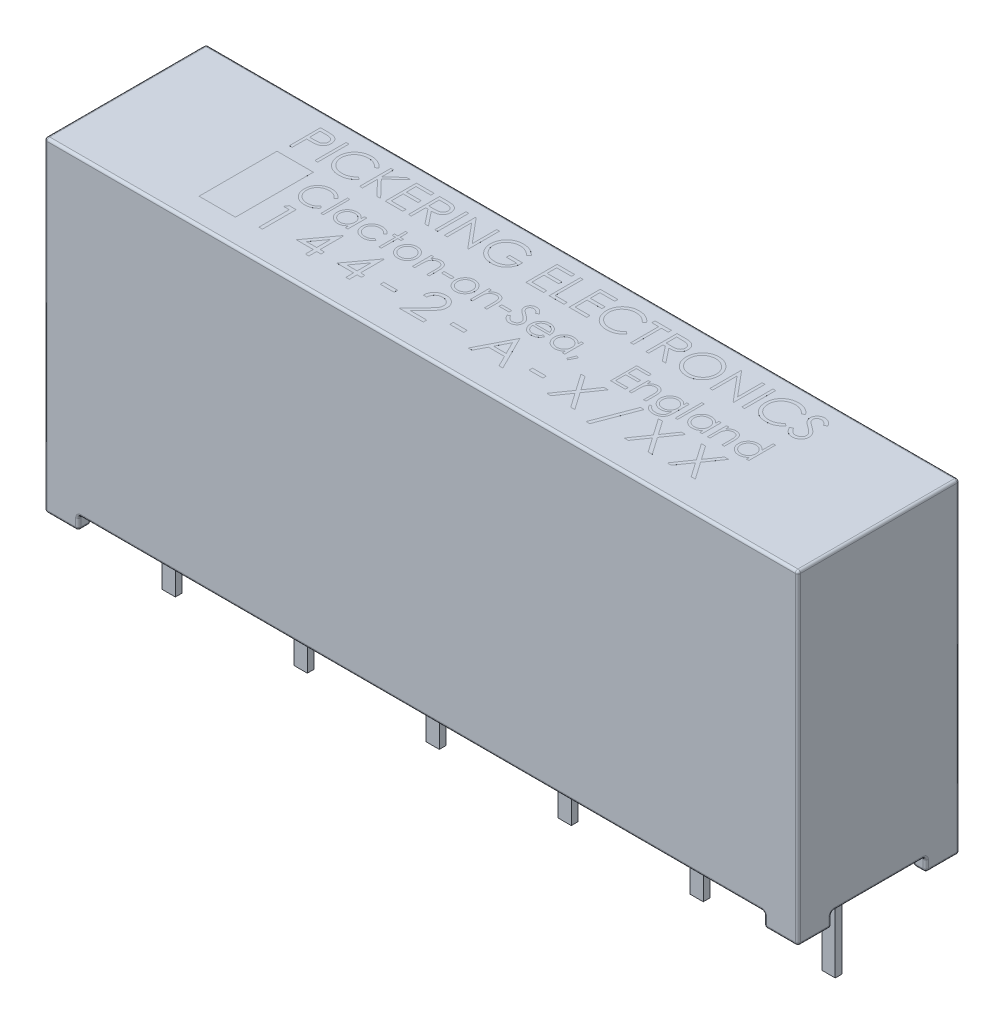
from build123d import *

# Parameters (mm, degrees)
SKETCH1_W               = 29
SKETCH1_H               = 6.22
MAIN_BODY_DEPTH         = 11.992
ORIGINAL_FOOT_DEPTH     = 0.508
RIGHT_FEET_COPY_1_DEPTH = 0.508
SKETCH3_W               = 0.508
SKETCH3_H               = 0.254
PINS_DEPTH              = 3.808
SKETCH4_W               = 1.4
SKETCH4_H               = 3
SKETCH4_W_2             = 0.107692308
SKETCH4_H_2             = 1.2
SKETCH4_W_3             = 0.08974359
SKETCH4_H_3             = 1.025641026
SKETCH4_W_4             = 0.384615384
SKETCH4_H_4             = 0.102564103
SKETCH4_W_5             = 0.533333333
SKETCH4_H_5             = 0.133333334
LETTERING_DEPTH         = 0.0001
FILLET1_R               = 0.1


with BuildPart() as part:
    # Sketch1 → Main Body (new body)
    with BuildSketch(Plane(origin=(0, 0, 0), x_dir=(1, 0, 0), z_dir=(0, 1, 0))):
        Rectangle(SKETCH1_W, SKETCH1_H)
    extrude(amount=MAIN_BODY_DEPTH)

    # Sketch2 → Original foot (add)
    with BuildSketch(Plane.XZ):
        Polygon((-14.5, 3.11), (-13.2, 3.11), (-13.2, 2.61), (-14, 2.61), (-14, 1.81), (-14.5, 1.81), align=None)
    original_foot = extrude(amount=ORIGINAL_FOOT_DEPTH)

    # Left foot: Original foot across plane
    add(original_foot.mirror(Plane.XY))

    # Right Feet: Original foot across plane
    add(original_foot.mirror(Plane(origin=(0, 0, 0), x_dir=(0, 0, 1), z_dir=(1, 0, 0))))

    # Right Feet copy 1 sketch → Right Feet copy 1 (add)
    with BuildSketch(Plane(origin=(0, 0, 0), x_dir=(-1, 0, 0), z_dir=(0, -1, 0))):
        Polygon((-14.5, 3.11), (-13.2, 3.11), (-13.2, 2.61), (-14, 2.61), (-14, 1.81), (-14.5, 1.81), align=None)
    extrude(amount=RIGHT_FEET_COPY_1_DEPTH)

    # Sketch3 → Pins (add)
    with BuildSketch(Plane.XZ):
        with Locations((-12.7, 0)):
            Rectangle(SKETCH3_W, SKETCH3_H)
        with Locations((-2.54, 0)):
            Rectangle(SKETCH3_W, SKETCH3_H)
        with Locations((12.7, 0)):
            Rectangle(SKETCH3_W, SKETCH3_H)
        with Locations((2.54, 0)):
            Rectangle(SKETCH3_W, SKETCH3_H)
        with Locations((7.62, 0)):
            Rectangle(SKETCH3_W, SKETCH3_H)
        with Locations((-7.62, 0)):
            Rectangle(SKETCH3_W, SKETCH3_H)
    extrude(amount=PINS_DEPTH)

    # Sketch4 → Lettering (add)
    # profile 1 of 55: a face of its own
    with BuildSketch(Plane(origin=(0, 11.992, 0), x_dir=(-1, 0, 0), z_dir=(0, 1, 0))):
        with Locations((8.85, 0.61)):
            Rectangle(SKETCH4_W, SKETCH4_H)
    # profile 2 of 55: a face of its own
    with BuildSketch(Plane(origin=(0, 11.992, 0), x_dir=(-1, 0, 0), z_dir=(0, 1, 0))):
        with BuildLine():
            Line((9.496153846, -2.51), (9.260817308, -2.51))
            add(Edge.make_bspline(
                [(9.260817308, -2.51), (9.244630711, -2.509982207), (9.213616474, -2.509948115), (9.16914274, -2.508914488), (9.128750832, -2.507533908), (9.092527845, -2.505620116), (9.060362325, -2.503358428), (9.032399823, -2.5001863), (9.008420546, -2.496874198), (8.994052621, -2.493506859), (8.9875, -2.491971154)],
                knots=[0, 0, 0, 0, 1.415646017, 2.712440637, 3.8905458, 4.950247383, 5.884950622, 6.709939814, 7.411656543, 8, 8, 8, 8], degree=3))
            add(Edge.make_bspline(
                [(8.9875, -2.491971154), (8.979205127, -2.489700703), (8.962810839, -2.4852133), (8.939186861, -2.476226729), (8.916714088, -2.465566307), (8.895298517, -2.453434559), (8.875307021, -2.439258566), (8.856115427, -2.423856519), (8.838126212, -2.406605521), (8.821611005, -2.387528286), (8.806308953, -2.367249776), (8.793500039, -2.345252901), (8.782189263, -2.32230074), (8.773374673, -2.29783291), (8.766446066, -2.272172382), (8.761399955, -2.245252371), (8.758156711, -2.21713095), (8.757848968, -2.197909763), (8.757692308, -2.188125)],
                knots=[0, 0, 0, 0, 0.999333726, 1.975119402, 2.933498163, 3.889020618, 4.832249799, 5.779334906, 6.747801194, 7.724875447, 8.710438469, 9.696133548, 10.679360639, 11.681339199, 12.714023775, 13.766351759, 14.862936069, 16, 16, 16, 16], degree=3))
            add(Edge.make_bspline(
                [(8.757692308, -2.188125), (8.757836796, -2.178258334), (8.758119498, -2.158953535), (8.76151251, -2.130711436), (8.766082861, -2.103722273), (8.773110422, -2.07804589), (8.782314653, -2.053834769), (8.793111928, -2.030718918), (8.806134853, -2.009091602), (8.821098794, -1.988874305), (8.837745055, -1.970048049), (8.856003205, -1.952749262), (8.875799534, -1.937079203), (8.897071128, -1.923002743), (8.920025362, -1.910846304), (8.9443141, -1.899958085), (8.97014846, -1.890813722), (8.988025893, -1.886003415), (8.997115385, -1.883557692)],
                knots=[0, 0, 0, 0, 1.121902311, 2.195077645, 3.232258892, 4.234102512, 5.217864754, 6.176164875, 7.132989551, 8.084763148, 9.034132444, 9.988522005, 10.94243251, 11.903244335, 12.886203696, 13.894208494, 14.929344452, 16, 16, 16, 16], degree=3))
            add(Edge.make_bspline(
                [(8.997115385, -1.883557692), (9.004633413, -1.881960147), (9.02110961, -1.878459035), (9.048242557, -1.874523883), (9.079849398, -1.871296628), (9.115822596, -1.868284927), (9.156246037, -1.866689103), (9.20102701, -1.864815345), (9.250317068, -1.86393122), (9.284695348, -1.863875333), (9.302644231, -1.863846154)],
                knots=[0, 0, 0, 0, 0.601372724, 1.317943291, 2.144091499, 3.08771165, 4.142394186, 5.309582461, 6.595334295, 8, 8, 8, 8], degree=3))
            Line((9.302644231, -1.863846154), (9.388461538, -1.863846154))
            Line((9.388461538, -1.863846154), (9.388461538, -1.31))
            Line((9.388461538, -1.31), (9.496153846, -1.31))
            Line((9.496153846, -1.31), (9.496153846, -2.51))
        make_face()
        with BuildLine():
            Line((9.388461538, -2.386923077), (9.388461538, -1.986923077))
            Line((9.388461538, -1.986923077), (9.178365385, -1.984278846))
            add(Edge.make_bspline(
                [(9.178365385, -1.984278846), (9.168106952, -1.984272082), (9.148303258, -1.984259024), (9.119618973, -1.985648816), (9.093070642, -1.987160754), (9.068619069, -1.989605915), (9.046375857, -1.99258825), (9.026287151, -1.996575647), (9.008192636, -2.000642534), (8.987349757, -2.007699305), (8.964003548, -2.018345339), (8.938664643, -2.034246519), (8.917014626, -2.054278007), (8.898437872, -2.077044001), (8.883754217, -2.102396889), (8.873112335, -2.129447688), (8.866616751, -2.158093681), (8.865800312, -2.177674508), (8.865384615, -2.187644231)],
                knots=[0, 0, 0, 0, 1.160501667, 2.240324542, 3.248665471, 4.168823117, 5.020172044, 5.786515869, 6.485785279, 7.116517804, 8.272762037, 9.381837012, 10.485674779, 11.594342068, 12.695271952, 13.786226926, 14.872841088, 16, 16, 16, 16], degree=3))
            add(Edge.make_bspline(
                [(8.865384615, -2.187644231), (8.865818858, -2.197290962), (8.866682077, -2.21646747), (8.873058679, -2.244585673), (8.883866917, -2.271328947), (8.898449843, -2.296480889), (8.916581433, -2.319186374), (8.937800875, -2.338771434), (8.961778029, -2.354623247), (8.983907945, -2.365175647), (9.003712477, -2.37136381), (9.020831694, -2.37583135), (9.040259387, -2.378912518), (9.061811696, -2.381860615), (9.085461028, -2.384240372), (9.111357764, -2.385892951), (9.139415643, -2.386849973), (9.158893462, -2.386898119), (9.168990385, -2.386923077)],
                knots=[0, 0, 0, 0, 1.12039168, 2.227199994, 3.330242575, 4.460839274, 5.593542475, 6.693949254, 7.801736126, 8.92216649, 9.528704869, 10.210659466, 10.975987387, 11.81211542, 12.738540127, 13.736887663, 14.826846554, 16, 16, 16, 16], degree=3))
            Line((9.168990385, -2.386923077), (9.388461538, -2.386923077))
        make_face(mode=Mode.SUBTRACT)
    # profile 3 of 55: a face of its own
    with BuildSketch(Plane(origin=(0, 11.992, 0), x_dir=(-1, 0, 0), z_dir=(0, 1, 0))):
        with Locations((8.457692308, -1.91)):
            Rectangle(SKETCH4_W_2, SKETCH4_H_2)
    # profile 4 of 55: a face of its own
    with BuildSketch(Plane(origin=(0, 11.992, 0), x_dir=(-1, 0, 0), z_dir=(0, 1, 0))):
        with BuildLine():
            Line((7.034615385, -2.289807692), (7.128846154, -2.217692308))
            add(Edge.make_bspline(
                [(7.128846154, -2.217692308), (7.135568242, -2.225703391), (7.148921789, -2.241617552), (7.170403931, -2.263966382), (7.192796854, -2.284897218), (7.216069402, -2.304544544), (7.240760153, -2.322118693), (7.265928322, -2.338988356), (7.292488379, -2.353758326), (7.329029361, -2.371801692), (7.377017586, -2.390219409), (7.437218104, -2.406060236), (7.500148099, -2.416049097), (7.543071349, -2.417138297), (7.564903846, -2.417692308)],
                knots=[0, 0, 0, 0, 0.75789156, 1.505565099, 2.245254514, 2.979266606, 3.711207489, 4.440978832, 5.174393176, 5.91211879, 7.394186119, 8.890401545, 10.418332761, 12, 12, 12, 12], degree=3))
            add(Edge.make_bspline(
                [(7.564903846, -2.417692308), (7.57693226, -2.417553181), (7.600877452, -2.41727622), (7.636416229, -2.413648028), (7.671358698, -2.408489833), (7.705574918, -2.401022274), (7.738996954, -2.391300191), (7.771879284, -2.37989878), (7.803834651, -2.365710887), (7.835247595, -2.350042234), (7.865342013, -2.33233961), (7.893822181, -2.313036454), (7.920559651, -2.292323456), (7.945622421, -2.270249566), (7.968757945, -2.246557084), (7.990212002, -2.221512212), (8.009957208, -2.195001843), (8.027973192, -2.167152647), (8.044087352, -2.138102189), (8.058060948, -2.107975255), (8.069872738, -2.076886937), (8.079455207, -2.04490386), (8.086954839, -2.012139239), (8.092146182, -1.978475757), (8.095740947, -1.943972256), (8.096015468, -1.920586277), (8.096153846, -1.908798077)],
                knots=[0, 0, 0, 0, 1.054960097, 2.100129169, 3.131228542, 4.15308236, 5.169990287, 6.183953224, 7.204064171, 8.235355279, 9.262684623, 10.264978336, 11.252191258, 12.228402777, 13.192898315, 14.155264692, 15.119862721, 16.091023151, 17.063429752, 18.032246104, 19.00241354, 19.978852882, 20.959535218, 21.948948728, 22.966123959, 24, 24, 24, 24], degree=3))
            add(Edge.make_bspline(
                [(8.096153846, -1.908798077), (8.095720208, -1.89106202), (8.094868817, -1.856239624), (8.087323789, -1.805226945), (8.075766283, -1.756309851), (8.058728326, -1.709819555), (8.037300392, -1.665368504), (8.010564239, -1.623495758), (7.979481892, -1.583587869), (7.943734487, -1.546611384), (7.904508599, -1.512835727), (7.862423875, -1.483092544), (7.817583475, -1.458298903), (7.770482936, -1.437667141), (7.720759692, -1.421807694), (7.668503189, -1.410642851), (7.613827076, -1.403359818), (7.576466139, -1.402662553), (7.557451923, -1.402307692)],
                knots=[0, 0, 0, 0, 1.029159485, 2.020618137, 2.987588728, 3.942669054, 4.889339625, 5.846988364, 6.821327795, 7.821533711, 8.827683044, 9.822769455, 10.807800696, 11.797391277, 12.803701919, 13.832062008, 14.896664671, 16, 16, 16, 16], degree=3))
            add(Edge.make_bspline(
                [(7.557451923, -1.402307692), (7.53650243, -1.402886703), (7.495268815, -1.404026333), (7.434799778, -1.413680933), (7.376913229, -1.429335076), (7.321606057, -1.451242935), (7.269034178, -1.479722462), (7.219115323, -1.514247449), (7.171807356, -1.555146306), (7.143360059, -1.586374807), (7.128846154, -1.602307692)],
                knots=[0, 0, 0, 0, 1.028121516, 2.023589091, 2.998037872, 3.967518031, 4.937445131, 5.927275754, 6.942489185, 8, 8, 8, 8], degree=3))
            Line((7.128846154, -1.602307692), (7.034615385, -1.530913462))
            add(Edge.make_bspline(
                [(7.034615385, -1.530913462), (7.042198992, -1.521129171), (7.057329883, -1.501607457), (7.08182598, -1.474080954), (7.107649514, -1.448211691), (7.134870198, -1.424134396), (7.163523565, -1.401728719), (7.193597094, -1.381098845), (7.224940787, -1.362015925), (7.257593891, -1.3447195), (7.291558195, -1.329328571), (7.32654263, -1.315876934), (7.362611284, -1.304581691), (7.399479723, -1.295091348), (7.437526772, -1.288313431), (7.476317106, -1.282919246), (7.516211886, -1.279718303), (7.543103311, -1.279394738), (7.556730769, -1.279230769)],
                knots=[0, 0, 0, 0, 0.986880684, 1.969034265, 2.935876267, 3.899990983, 4.864973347, 5.834408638, 6.8063673, 7.789580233, 8.778939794, 9.778051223, 10.776304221, 11.791326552, 12.811423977, 13.855999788, 14.91350973, 16, 16, 16, 16], degree=3))
            add(Edge.make_bspline(
                [(7.556730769, -1.279230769), (7.569637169, -1.279320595), (7.595157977, -1.279498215), (7.632837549, -1.28237553), (7.669519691, -1.286301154), (7.705099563, -1.292212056), (7.739771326, -1.299187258), (7.773220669, -1.308537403), (7.805776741, -1.319011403), (7.837308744, -1.331321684), (7.867843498, -1.345212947), (7.897282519, -1.36091291), (7.925612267, -1.378289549), (7.953111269, -1.396959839), (7.979373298, -1.417523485), (8.004625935, -1.439694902), (8.029010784, -1.463399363), (8.044097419, -1.480492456), (8.051682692, -1.489086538)],
                knots=[0, 0, 0, 0, 1.114604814, 2.203992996, 3.262667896, 4.300477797, 5.318619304, 6.316056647, 7.298880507, 8.271930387, 9.238335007, 10.195173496, 11.151986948, 12.108099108, 13.064862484, 14.031167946, 15.010108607, 16, 16, 16, 16], degree=3))
            add(Edge.make_bspline(
                [(8.051682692, -1.489086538), (8.063831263, -1.504015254), (8.087981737, -1.533692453), (8.118893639, -1.581785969), (8.145265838, -1.631954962), (8.166826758, -1.684490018), (8.18338806, -1.739411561), (8.195031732, -1.796631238), (8.202545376, -1.856034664), (8.203407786, -1.89643528), (8.203846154, -1.916971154)],
                knots=[0, 0, 0, 0, 0.994611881, 1.977215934, 2.950189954, 3.921972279, 4.908960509, 5.911694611, 6.938501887, 8, 8, 8, 8], degree=3))
            add(Edge.make_bspline(
                [(8.203846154, -1.916971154), (8.20331056, -1.938554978), (8.202256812, -1.981019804), (8.193378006, -2.043355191), (8.178921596, -2.102990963), (8.159015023, -2.160156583), (8.132752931, -2.214524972), (8.100960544, -2.26632575), (8.063327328, -2.315516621), (8.02032592, -2.361468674), (7.973157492, -2.403481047), (7.922648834, -2.440443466), (7.868894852, -2.47120368), (7.812488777, -2.496916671), (7.75300796, -2.516680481), (7.69057938, -2.530515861), (7.625320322, -2.539127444), (7.580796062, -2.540216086), (7.558173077, -2.540769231)],
                knots=[0, 0, 0, 0, 1.032901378, 2.032168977, 3.007206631, 3.966850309, 4.924221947, 5.891988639, 6.871730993, 7.884084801, 8.900290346, 9.89161143, 10.874607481, 11.860025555, 12.854717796, 13.869097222, 14.917278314, 16, 16, 16, 16], degree=3))
            add(Edge.make_bspline(
                [(7.558173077, -2.540769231), (7.544385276, -2.540603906), (7.517093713, -2.540276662), (7.476721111, -2.537086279), (7.437416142, -2.531766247), (7.399069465, -2.524515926), (7.36161783, -2.515497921), (7.325229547, -2.504206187), (7.290008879, -2.490553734), (7.255718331, -2.475358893), (7.222797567, -2.457956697), (7.191262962, -2.439041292), (7.161370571, -2.418248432), (7.132926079, -2.395881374), (7.106060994, -2.371768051), (7.080372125, -2.346313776), (7.056622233, -2.318843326), (7.041964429, -2.299503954), (7.034615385, -2.289807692)],
                knots=[0, 0, 0, 0, 1.096566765, 2.170543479, 3.218870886, 4.250164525, 5.273529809, 6.281496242, 7.278154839, 8.276706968, 9.263143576, 10.238168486, 11.199979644, 12.157579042, 13.114563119, 14.070017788, 15.032356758, 16, 16, 16, 16], degree=3))
        make_face()
    # profile 5 of 55: a face of its own
    with BuildSketch(Plane(origin=(0, 11.992, 0), x_dir=(-1, 0, 0), z_dir=(0, 1, 0))):
        Polygon((6.788461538, -2.51), (6.680769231, -2.51), (6.680769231, -2.053028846), (6.180528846, -2.51), (6.026923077, -2.51), (6.616586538, -1.971538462), (5.980769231, -1.31), (6.124278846, -1.31), (6.680769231, -1.889086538), (6.680769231, -1.31), (6.788461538, -1.31), align=None)
    # profile 6 of 55: a face of its own
    with BuildSketch(Plane(origin=(0, 11.992, 0), x_dir=(-1, 0, 0), z_dir=(0, 1, 0))):
        Polygon((5.803846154, -2.51), (5.126923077, -2.51), (5.126923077, -2.386923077), (5.696153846, -2.386923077), (5.696153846, -2.017692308), (5.126923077, -2.017692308), (5.126923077, -1.894615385), (5.696153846, -1.894615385), (5.696153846, -1.433076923), (5.126923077, -1.433076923), (5.126923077, -1.31), (5.803846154, -1.31), align=None)
    # profile 7 of 55: a face of its own
    with BuildSketch(Plane(origin=(0, 11.992, 0), x_dir=(-1, 0, 0), z_dir=(0, 1, 0))):
        with BuildLine():
            Line((4.911538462, -2.51), (4.671394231, -2.51))
            add(Edge.make_bspline(
                [(4.671394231, -2.51), (4.655368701, -2.509946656), (4.624597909, -2.50984423), (4.580515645, -2.509273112), (4.54046064, -2.50763619), (4.504453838, -2.506227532), (4.472495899, -2.503658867), (4.444488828, -2.501203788), (4.420561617, -2.497989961), (4.406077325, -2.495005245), (4.399519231, -2.493653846)],
                knots=[0, 0, 0, 0, 1.410062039, 2.707475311, 3.878576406, 4.937260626, 5.877586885, 6.699081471, 7.410979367, 8, 8, 8, 8], degree=3))
            add(Edge.make_bspline(
                [(4.399519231, -2.493653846), (4.390739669, -2.49148491), (4.373367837, -2.487193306), (4.348358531, -2.478117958), (4.324517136, -2.467632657), (4.301930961, -2.455223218), (4.280605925, -2.441099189), (4.260544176, -2.425203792), (4.242014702, -2.407400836), (4.224358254, -2.388427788), (4.208940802, -2.367458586), (4.195061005, -2.345557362), (4.183409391, -2.322302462), (4.174240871, -2.297811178), (4.166554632, -2.272323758), (4.161388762, -2.245588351), (4.158171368, -2.217691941), (4.157853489, -2.198710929), (4.157692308, -2.189086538)],
                knots=[0, 0, 0, 0, 1.027276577, 2.032638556, 3.019345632, 3.985365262, 4.957888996, 5.923693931, 6.890056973, 7.876427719, 8.865527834, 9.843495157, 10.821038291, 11.815616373, 12.812734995, 13.843357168, 14.906466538, 16, 16, 16, 16], degree=3))
            add(Edge.make_bspline(
                [(4.157692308, -2.189086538), (4.158195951, -2.173097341), (4.15917869, -2.141898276), (4.168341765, -2.096620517), (4.18335019, -2.054383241), (4.20403492, -2.015245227), (4.230363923, -1.979948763), (4.262005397, -1.949051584), (4.298797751, -1.922957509), (4.333209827, -1.905054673), (4.363622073, -1.893535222), (4.388732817, -1.885389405), (4.416145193, -1.87920187), (4.445465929, -1.873578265), (4.476921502, -1.869287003), (4.510448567, -1.866239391), (4.546130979, -1.864279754), (4.570590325, -1.863993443), (4.583173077, -1.863846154)],
                knots=[0, 0, 0, 0, 1.260402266, 2.459371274, 3.627181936, 4.786749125, 5.93865593, 7.087644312, 8.261344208, 9.485713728, 10.136162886, 10.825977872, 11.566646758, 12.35154167, 13.181268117, 14.0701832, 15.007234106, 16, 16, 16, 16], degree=3))
            Line((4.583173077, -1.863846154), (4.142307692, -1.31))
            Line((4.142307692, -1.31), (4.275480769, -1.31))
            Line((4.275480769, -1.31), (4.716346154, -1.863846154))
            Line((4.716346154, -1.863846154), (4.803846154, -1.863846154))
            Line((4.803846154, -1.863846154), (4.803846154, -1.31))
            Line((4.803846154, -1.31), (4.911538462, -1.31))
            Line((4.911538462, -1.31), (4.911538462, -2.51))
        make_face()
        with BuildLine():
            Line((4.803846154, -2.386923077), (4.803846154, -1.986923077))
            Line((4.803846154, -1.986923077), (4.584134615, -1.985240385))
            add(Edge.make_bspline(
                [(4.584134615, -1.985240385), (4.573876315, -1.985235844), (4.553992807, -1.985227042), (4.525226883, -1.986596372), (4.498442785, -1.988153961), (4.473743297, -1.990536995), (4.451116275, -1.993606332), (4.430576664, -1.997451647), (4.412079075, -2.001912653), (4.390574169, -2.008887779), (4.366284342, -2.019462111), (4.34043109, -2.03585853), (4.317823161, -2.055687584), (4.299027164, -2.078648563), (4.283930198, -2.10400223), (4.27344401, -2.131174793), (4.266533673, -2.159738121), (4.265772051, -2.179350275), (4.265384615, -2.189326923)],
                knots=[0, 0, 0, 0, 1.146399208, 2.222048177, 3.218135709, 4.144938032, 4.994811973, 5.769438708, 6.479732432, 7.119818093, 8.294689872, 9.430121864, 10.527913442, 11.641375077, 12.733452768, 13.811150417, 14.886538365, 16, 16, 16, 16], degree=3))
            add(Edge.make_bspline(
                [(4.265384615, -2.189326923), (4.265791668, -2.198979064), (4.266598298, -2.218106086), (4.273333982, -2.246044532), (4.284332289, -2.272610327), (4.299386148, -2.297437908), (4.318122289, -2.31980791), (4.339945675, -2.338889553), (4.364342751, -2.354742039), (4.386960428, -2.365201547), (4.407324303, -2.371355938), (4.424923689, -2.375823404), (4.444982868, -2.378952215), (4.467265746, -2.381829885), (4.491870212, -2.38426683), (4.518811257, -2.385884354), (4.54806962, -2.386851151), (4.568348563, -2.386898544), (4.578846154, -2.386923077)],
                knots=[0, 0, 0, 0, 1.100596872, 2.180981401, 3.259506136, 4.371595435, 5.481727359, 6.576991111, 7.667816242, 8.793363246, 9.406619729, 10.09427138, 10.864108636, 11.721733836, 12.6590937, 13.685439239, 14.801845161, 16, 16, 16, 16], degree=3))
            Line((4.578846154, -2.386923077), (4.803846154, -2.386923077))
        make_face(mode=Mode.SUBTRACT)
    # profile 8 of 55: a face of its own
    with BuildSketch(Plane(origin=(0, 11.992, 0), x_dir=(-1, 0, 0), z_dir=(0, 1, 0))):
        with Locations((3.842307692, -1.91)):
            Rectangle(SKETCH4_W_2, SKETCH4_H_2)
    # profile 9 of 55: a face of its own
    with BuildSketch(Plane(origin=(0, 11.992, 0), x_dir=(-1, 0, 0), z_dir=(0, 1, 0))):
        Polygon((3.526923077, -1.31), (3.526923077, -2.51), (3.504326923, -2.51), (2.711538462, -1.565528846), (2.711538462, -2.51), (2.603846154, -2.51), (2.603846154, -1.31), (2.628365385, -1.31), (3.419230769, -2.252307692), (3.419230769, -1.31), align=None)
    # profile 10 of 55: a face of its own
    with BuildSketch(Plane(origin=(0, 11.992, 0), x_dir=(-1, 0, 0), z_dir=(0, 1, 0))):
        with BuildLine():
            Line((1.173076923, -2.305192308), (1.265384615, -2.217692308))
            add(Edge.make_bspline(
                [(1.265384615, -2.217692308), (1.282186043, -2.233384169), (1.315299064, -2.264310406), (1.369026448, -2.304884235), (1.425160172, -2.33937083), (1.483243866, -2.367704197), (1.542157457, -2.38972872), (1.600724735, -2.405653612), (1.658535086, -2.415895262), (1.696914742, -2.417098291), (1.715865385, -2.417692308)],
                knots=[0, 0, 0, 0, 1.091957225, 2.152079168, 3.193085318, 4.218301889, 5.218403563, 6.17723952, 7.099979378, 8, 8, 8, 8], degree=3))
            add(Edge.make_bspline(
                [(1.715865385, -2.417692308), (1.727493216, -2.417550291), (1.750718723, -2.417266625), (1.785218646, -2.413654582), (1.819352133, -2.408443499), (1.853001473, -2.40098118), (1.886300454, -2.391288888), (1.919174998, -2.379586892), (1.951561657, -2.365500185), (1.983290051, -2.349440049), (2.01420648, -2.331907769), (2.043283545, -2.312354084), (2.070642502, -2.291380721), (2.096089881, -2.268712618), (2.119974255, -2.244727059), (2.141858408, -2.219083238), (2.162220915, -2.192160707), (2.180300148, -2.163573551), (2.196641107, -2.134134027), (2.210790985, -2.104076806), (2.22297485, -2.073613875), (2.232710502, -2.042728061), (2.240537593, -2.011439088), (2.24607771, -1.979795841), (2.249189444, -1.947642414), (2.249728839, -1.92611207), (2.25, -1.915288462)],
                knots=[0, 0, 0, 0, 1.028307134, 2.053947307, 3.065600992, 4.082111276, 5.100671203, 6.132125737, 7.167228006, 8.222953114, 9.277225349, 10.309459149, 11.320441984, 12.324791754, 13.322338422, 14.312705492, 15.305176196, 16.306142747, 17.302479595, 18.282363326, 19.243345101, 20.20291386, 21.145121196, 22.094978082, 23.042318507, 24, 24, 24, 24], degree=3))
            add(Edge.make_bspline(
                [(2.25, -1.915288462), (2.249738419, -1.904224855), (2.249215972, -1.882127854), (2.245940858, -1.849136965), (2.239657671, -1.816703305), (2.231982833, -1.784520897), (2.22111931, -1.753000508), (2.208490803, -1.721680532), (2.193263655, -1.69085205), (2.175729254, -1.660729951), (2.156351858, -1.631416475), (2.135043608, -1.603571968), (2.11176426, -1.57752184), (2.086941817, -1.552885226), (2.060349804, -1.529817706), (2.031730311, -1.508597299), (2.001483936, -1.488895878), (1.969597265, -1.470929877), (1.936407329, -1.454881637), (1.902376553, -1.440610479), (1.867395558, -1.428857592), (1.831648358, -1.419278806), (1.79517752, -1.411427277), (1.757797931, -1.406376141), (1.719784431, -1.402710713), (1.694159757, -1.402442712), (1.68125, -1.402307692)],
                knots=[0, 0, 0, 0, 0.935896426, 1.86923723, 2.799743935, 3.728471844, 4.66505513, 5.616527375, 6.583419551, 7.570341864, 8.562833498, 9.553750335, 10.533080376, 11.5155245, 12.510142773, 13.507781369, 14.526649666, 15.561487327, 16.601173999, 17.643331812, 18.680652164, 19.71969803, 20.772446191, 21.833473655, 22.9085001, 24, 24, 24, 24], degree=3))
            add(Edge.make_bspline(
                [(1.68125, -1.402307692), (1.665691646, -1.402632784), (1.63514029, -1.403271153), (1.590231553, -1.408244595), (1.547095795, -1.41600224), (1.505873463, -1.427398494), (1.466414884, -1.441823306), (1.428865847, -1.459661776), (1.393121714, -1.480725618), (1.359340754, -1.504590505), (1.328312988, -1.5311735), (1.300110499, -1.559626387), (1.275559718, -1.590176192), (1.254500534, -1.622816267), (1.236374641, -1.657065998), (1.221915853, -1.693512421), (1.210732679, -1.731748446), (1.206157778, -1.758182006), (1.203846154, -1.771538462)],
                knots=[0, 0, 0, 0, 1.130234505, 2.219399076, 3.279128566, 4.311639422, 5.322903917, 6.328167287, 7.327698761, 8.334124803, 9.329374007, 10.292761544, 11.24113083, 12.171311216, 13.111441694, 14.052040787, 15.015727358, 16, 16, 16, 16], degree=3))
            Line((1.203846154, -1.771538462), (1.603846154, -1.771538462))
            Line((1.603846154, -1.771538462), (1.603846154, -1.894615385))
            Line((1.603846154, -1.894615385), (1.096153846, -1.894615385))
            add(Edge.make_bspline(
                [(1.096153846, -1.894615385), (1.096738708, -1.871675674), (1.09788339, -1.826778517), (1.105912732, -1.761302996), (1.118878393, -1.699461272), (1.1365905, -1.641188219), (1.159519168, -1.586566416), (1.187418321, -1.535540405), (1.220734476, -1.488439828), (1.258280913, -1.44488017), (1.300418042, -1.40602444), (1.346007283, -1.371873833), (1.395123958, -1.343107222), (1.447721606, -1.319703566), (1.50362804, -1.301438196), (1.562972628, -1.288487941), (1.625674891, -1.280729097), (1.668647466, -1.279737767), (1.690625, -1.279230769)],
                knots=[0, 0, 0, 0, 1.140356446, 2.231883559, 3.274166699, 4.278491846, 5.25512956, 6.21435461, 7.1637429, 8.11826594, 9.068280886, 10.0076534, 10.945064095, 11.891975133, 12.864533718, 13.863980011, 14.907571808, 16, 16, 16, 16], degree=3))
            add(Edge.make_bspline(
                [(1.690625, -1.279230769), (1.704171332, -1.279425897), (1.730889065, -1.27981075), (1.770348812, -1.282545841), (1.808720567, -1.286756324), (1.845998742, -1.293114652), (1.882320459, -1.300902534), (1.917504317, -1.310875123), (1.951684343, -1.322418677), (1.984913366, -1.335548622), (2.016889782, -1.350761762), (2.047756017, -1.367667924), (2.077682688, -1.386179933), (2.106465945, -1.406617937), (2.134255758, -1.428829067), (2.160872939, -1.452857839), (2.186466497, -1.478630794), (2.202498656, -1.496932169), (2.210576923, -1.506153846)],
                knots=[0, 0, 0, 0, 1.107784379, 2.184907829, 3.233506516, 4.263428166, 5.276301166, 6.270063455, 7.25232949, 8.225834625, 9.190232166, 10.146266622, 11.1027726, 12.066435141, 13.031522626, 14.010570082, 14.99756817, 16, 16, 16, 16], degree=3))
            add(Edge.make_bspline(
                [(2.210576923, -1.506153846), (2.222297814, -1.520783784), (2.245545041, -1.549800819), (2.275468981, -1.596292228), (2.300978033, -1.644430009), (2.321675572, -1.694348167), (2.337837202, -1.746000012), (2.349427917, -1.79931954), (2.356218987, -1.854375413), (2.357197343, -1.891632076), (2.357692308, -1.910480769)],
                knots=[0, 0, 0, 0, 1.023165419, 2.029347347, 3.013907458, 3.994755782, 4.975994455, 5.96558838, 6.970761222, 8, 8, 8, 8], degree=3))
            add(Edge.make_bspline(
                [(2.357692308, -1.910480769), (2.357509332, -1.924594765), (2.357145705, -1.952643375), (2.352755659, -1.994288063), (2.346419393, -2.035182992), (2.337241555, -2.075366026), (2.325165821, -2.114658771), (2.310663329, -2.153363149), (2.293676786, -2.191324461), (2.273854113, -2.228206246), (2.252277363, -2.263995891), (2.228014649, -2.297566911), (2.202413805, -2.329568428), (2.174248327, -2.359094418), (2.144573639, -2.387088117), (2.112651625, -2.412811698), (2.079006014, -2.436699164), (2.043365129, -2.458283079), (2.006294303, -2.477677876), (1.967873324, -2.494679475), (1.928116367, -2.50873101), (1.887320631, -2.520653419), (1.845177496, -2.529470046), (1.801992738, -2.5358639), (1.757541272, -2.540238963), (1.727494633, -2.540590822), (1.712259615, -2.540769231)],
                knots=[0, 0, 0, 0, 1.009025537, 2.005226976, 2.991671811, 3.967589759, 4.950148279, 5.929425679, 6.922109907, 7.921964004, 8.922507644, 9.908469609, 10.882248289, 11.851158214, 12.824245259, 13.798023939, 14.780666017, 15.773333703, 16.775582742, 17.771174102, 18.775387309, 19.789283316, 20.80873549, 21.851817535, 22.910773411, 24, 24, 24, 24], degree=3))
            add(Edge.make_bspline(
                [(1.712259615, -2.540769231), (1.699834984, -2.540571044), (1.675198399, -2.540178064), (1.638539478, -2.537440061), (1.602519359, -2.533148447), (1.56695735, -2.527147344), (1.531988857, -2.519208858), (1.497507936, -2.509534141), (1.463579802, -2.498332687), (1.430244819, -2.484963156), (1.397276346, -2.46979101), (1.364491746, -2.452711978), (1.332002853, -2.433434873), (1.299753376, -2.411902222), (1.267539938, -2.38848391), (1.235872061, -2.362510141), (1.203985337, -2.335005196), (1.183481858, -2.315228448), (1.173076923, -2.305192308)],
                knots=[0, 0, 0, 0, 0.985875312, 1.954874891, 2.915472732, 3.863573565, 4.815313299, 5.759461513, 6.704487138, 7.649063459, 8.607849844, 9.583336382, 10.581114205, 11.603942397, 12.659508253, 13.739925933, 14.853076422, 16, 16, 16, 16], degree=3))
        make_face()
    # profile 11 of 55: a face of its own
    with BuildSketch(Plane(origin=(0, 11.992, 0), x_dir=(-1, 0, 0), z_dir=(0, 1, 0))):
        Polygon((0.388461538, -2.51), (-0.288461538, -2.51), (-0.288461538, -2.386923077), (0.280769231, -2.386923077), (0.280769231, -2.017692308), (-0.288461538, -2.017692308), (-0.288461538, -1.894615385), (0.280769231, -1.894615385), (0.280769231, -1.433076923), (-0.288461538, -1.433076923), (-0.288461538, -1.31), (0.388461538, -1.31), align=None)
    # profile 12 of 55: a face of its own
    with BuildSketch(Plane(origin=(0, 11.992, 0), x_dir=(-1, 0, 0), z_dir=(0, 1, 0))):
        Polygon((-0.503846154, -2.51), (-0.611538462, -2.51), (-0.611538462, -1.433076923), (-1.073076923, -1.433076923), (-1.073076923, -1.31), (-0.503846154, -1.31), align=None)
    # profile 13 of 55: a face of its own
    with BuildSketch(Plane(origin=(0, 11.992, 0), x_dir=(-1, 0, 0), z_dir=(0, 1, 0))):
        Polygon((-1.273076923, -2.51), (-1.95, -2.51), (-1.95, -2.386923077), (-1.380769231, -2.386923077), (-1.380769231, -2.017692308), (-1.95, -2.017692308), (-1.95, -1.894615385), (-1.380769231, -1.894615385), (-1.380769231, -1.433076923), (-1.95, -1.433076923), (-1.95, -1.31), (-1.273076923, -1.31), align=None)
    # profile 14 of 55: a face of its own
    with BuildSketch(Plane(origin=(0, 11.992, 0), x_dir=(-1, 0, 0), z_dir=(0, 1, 0))):
        with BuildLine():
            Line((-3.273076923, -2.289807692), (-3.178846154, -2.217692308))
            add(Edge.make_bspline(
                [(-3.178846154, -2.217692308), (-3.172124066, -2.225703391), (-3.158770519, -2.241617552), (-3.137288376, -2.263966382), (-3.114895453, -2.284897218), (-3.091622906, -2.304544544), (-3.066932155, -2.322118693), (-3.041763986, -2.338988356), (-3.015203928, -2.353758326), (-2.978662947, -2.371801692), (-2.930674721, -2.390219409), (-2.870474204, -2.406060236), (-2.807544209, -2.416049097), (-2.764620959, -2.417138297), (-2.742788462, -2.417692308)],
                knots=[0, 0, 0, 0, 0.75789156, 1.505565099, 2.245254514, 2.979266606, 3.711207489, 4.440978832, 5.174393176, 5.91211879, 7.394186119, 8.890401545, 10.418332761, 12, 12, 12, 12], degree=3))
            add(Edge.make_bspline(
                [(-2.742788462, -2.417692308), (-2.730760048, -2.417553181), (-2.706814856, -2.41727622), (-2.671276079, -2.413648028), (-2.63633361, -2.408489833), (-2.602117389, -2.401022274), (-2.568695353, -2.391300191), (-2.535813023, -2.37989878), (-2.503857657, -2.365710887), (-2.472444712, -2.350042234), (-2.442350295, -2.33233961), (-2.413870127, -2.313036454), (-2.387132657, -2.292323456), (-2.362069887, -2.270249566), (-2.338934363, -2.246557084), (-2.317480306, -2.221512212), (-2.297735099, -2.195001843), (-2.279719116, -2.167152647), (-2.263604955, -2.138102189), (-2.24963136, -2.107975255), (-2.23781957, -2.076886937), (-2.228237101, -2.04490386), (-2.220737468, -2.012139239), (-2.215546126, -1.978475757), (-2.211951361, -1.943972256), (-2.21167684, -1.920586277), (-2.211538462, -1.908798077)],
                knots=[0, 0, 0, 0, 1.054960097, 2.100129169, 3.131228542, 4.15308236, 5.169990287, 6.183953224, 7.204064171, 8.235355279, 9.262684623, 10.264978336, 11.252191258, 12.228402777, 13.192898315, 14.155264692, 15.119862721, 16.091023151, 17.063429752, 18.032246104, 19.00241354, 19.978852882, 20.959535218, 21.948948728, 22.966123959, 24, 24, 24, 24], degree=3))
            add(Edge.make_bspline(
                [(-2.211538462, -1.908798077), (-2.2119721, -1.89106202), (-2.21282349, -1.856239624), (-2.220368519, -1.805226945), (-2.231926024, -1.756309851), (-2.248963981, -1.709819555), (-2.270391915, -1.665368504), (-2.297128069, -1.623495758), (-2.328210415, -1.583587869), (-2.36395782, -1.546611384), (-2.403183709, -1.512835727), (-2.445268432, -1.483092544), (-2.490108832, -1.458298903), (-2.537209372, -1.437667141), (-2.586932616, -1.421807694), (-2.639189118, -1.410642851), (-2.693865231, -1.403359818), (-2.731226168, -1.402662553), (-2.750240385, -1.402307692)],
                knots=[0, 0, 0, 0, 1.029159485, 2.020618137, 2.987588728, 3.942669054, 4.889339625, 5.846988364, 6.821327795, 7.821533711, 8.827683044, 9.822769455, 10.807800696, 11.797391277, 12.803701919, 13.832062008, 14.896664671, 16, 16, 16, 16], degree=3))
            add(Edge.make_bspline(
                [(-2.750240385, -1.402307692), (-2.771189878, -1.402886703), (-2.812423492, -1.404026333), (-2.87289253, -1.413680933), (-2.930779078, -1.429335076), (-2.986086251, -1.451242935), (-3.03865813, -1.479722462), (-3.088576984, -1.514247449), (-3.135884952, -1.555146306), (-3.164332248, -1.586374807), (-3.178846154, -1.602307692)],
                knots=[0, 0, 0, 0, 1.028121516, 2.023589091, 2.998037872, 3.967518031, 4.937445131, 5.927275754, 6.942489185, 8, 8, 8, 8], degree=3))
            Line((-3.178846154, -1.602307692), (-3.273076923, -1.530913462))
            add(Edge.make_bspline(
                [(-3.273076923, -1.530913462), (-3.265493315, -1.521129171), (-3.250362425, -1.501607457), (-3.225866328, -1.474080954), (-3.200042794, -1.448211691), (-3.17282211, -1.424134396), (-3.144168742, -1.401728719), (-3.114095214, -1.381098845), (-3.082751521, -1.362015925), (-3.050098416, -1.3447195), (-3.016134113, -1.329328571), (-2.981149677, -1.315876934), (-2.945081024, -1.304581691), (-2.908212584, -1.295091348), (-2.870165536, -1.288313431), (-2.831375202, -1.282919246), (-2.791480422, -1.279718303), (-2.764588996, -1.279394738), (-2.750961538, -1.279230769)],
                knots=[0, 0, 0, 0, 0.986880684, 1.969034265, 2.935876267, 3.899990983, 4.864973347, 5.834408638, 6.8063673, 7.789580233, 8.778939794, 9.778051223, 10.776304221, 11.791326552, 12.811423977, 13.855999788, 14.91350973, 16, 16, 16, 16], degree=3))
            add(Edge.make_bspline(
                [(-2.750961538, -1.279230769), (-2.738055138, -1.279320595), (-2.71253433, -1.279498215), (-2.674854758, -1.28237553), (-2.638172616, -1.286301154), (-2.602592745, -1.292212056), (-2.567920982, -1.299187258), (-2.534471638, -1.308537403), (-2.501915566, -1.319011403), (-2.470383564, -1.331321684), (-2.43984881, -1.345212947), (-2.410409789, -1.36091291), (-2.38208004, -1.378289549), (-2.354581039, -1.396959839), (-2.32831901, -1.417523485), (-2.303066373, -1.439694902), (-2.278681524, -1.463399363), (-2.263594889, -1.480492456), (-2.256009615, -1.489086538)],
                knots=[0, 0, 0, 0, 1.114604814, 2.203992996, 3.262667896, 4.300477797, 5.318619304, 6.316056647, 7.298880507, 8.271930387, 9.238335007, 10.195173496, 11.151986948, 12.108099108, 13.064862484, 14.031167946, 15.010108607, 16, 16, 16, 16], degree=3))
            add(Edge.make_bspline(
                [(-2.256009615, -1.489086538), (-2.243861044, -1.504015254), (-2.21971057, -1.533692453), (-2.188798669, -1.581785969), (-2.16242647, -1.631954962), (-2.14086555, -1.684490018), (-2.124304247, -1.739411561), (-2.112660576, -1.796631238), (-2.105146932, -1.856034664), (-2.104284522, -1.89643528), (-2.103846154, -1.916971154)],
                knots=[0, 0, 0, 0, 0.994611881, 1.977215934, 2.950189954, 3.921972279, 4.908960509, 5.911694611, 6.938501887, 8, 8, 8, 8], degree=3))
            add(Edge.make_bspline(
                [(-2.103846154, -1.916971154), (-2.104381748, -1.938554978), (-2.105435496, -1.981019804), (-2.114314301, -2.043355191), (-2.128770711, -2.102990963), (-2.148677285, -2.160156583), (-2.174939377, -2.214524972), (-2.206731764, -2.26632575), (-2.24436498, -2.315516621), (-2.287366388, -2.361468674), (-2.334534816, -2.403481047), (-2.385043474, -2.440443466), (-2.438797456, -2.47120368), (-2.49520353, -2.496916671), (-2.554684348, -2.516680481), (-2.617112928, -2.530515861), (-2.682371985, -2.539127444), (-2.726896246, -2.540216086), (-2.749519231, -2.540769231)],
                knots=[0, 0, 0, 0, 1.032901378, 2.032168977, 3.007206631, 3.966850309, 4.924221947, 5.891988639, 6.871730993, 7.884084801, 8.900290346, 9.89161143, 10.874607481, 11.860025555, 12.854717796, 13.869097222, 14.917278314, 16, 16, 16, 16], degree=3))
            add(Edge.make_bspline(
                [(-2.749519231, -2.540769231), (-2.763307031, -2.540603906), (-2.790598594, -2.540276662), (-2.830971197, -2.537086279), (-2.870276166, -2.531766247), (-2.908622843, -2.524515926), (-2.946074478, -2.515497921), (-2.982462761, -2.504206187), (-3.017683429, -2.490553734), (-3.051973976, -2.475358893), (-3.08489474, -2.457956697), (-3.116429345, -2.439041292), (-3.146321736, -2.418248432), (-3.174766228, -2.395881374), (-3.201631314, -2.371768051), (-3.227320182, -2.346313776), (-3.251070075, -2.318843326), (-3.265727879, -2.299503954), (-3.273076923, -2.289807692)],
                knots=[0, 0, 0, 0, 1.096566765, 2.170543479, 3.218870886, 4.250164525, 5.273529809, 6.281496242, 7.278154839, 8.276706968, 9.263143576, 10.238168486, 11.199979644, 12.157579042, 13.114563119, 14.070017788, 15.032356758, 16, 16, 16, 16], degree=3))
        make_face()
    # profile 15 of 55: a face of its own
    with BuildSketch(Plane(origin=(0, 11.992, 0), x_dir=(-1, 0, 0), z_dir=(0, 1, 0))):
        Polygon((-3.380769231, -2.386923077), (-3.380769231, -2.51), (-4.011538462, -2.51), (-4.011538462, -2.386923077), (-3.75, -2.386923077), (-3.75, -1.31), (-3.642307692, -1.31), (-3.642307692, -2.386923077), align=None)
    # profile 16 of 55: a face of its own
    with BuildSketch(Plane(origin=(0, 11.992, 0), x_dir=(-1, 0, 0), z_dir=(0, 1, 0))):
        with BuildLine():
            Line((-4.226923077, -2.51), (-4.467067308, -2.51))
            add(Edge.make_bspline(
                [(-4.467067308, -2.51), (-4.483092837, -2.509946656), (-4.51386363, -2.50984423), (-4.557945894, -2.509273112), (-4.598000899, -2.50763619), (-4.634007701, -2.506227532), (-4.66596564, -2.503658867), (-4.693972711, -2.501203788), (-4.717899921, -2.497989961), (-4.732384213, -2.495005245), (-4.738942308, -2.493653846)],
                knots=[0, 0, 0, 0, 1.410062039, 2.707475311, 3.878576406, 4.937260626, 5.877586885, 6.699081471, 7.410979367, 8, 8, 8, 8], degree=3))
            add(Edge.make_bspline(
                [(-4.738942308, -2.493653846), (-4.74772187, -2.49148491), (-4.765093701, -2.487193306), (-4.790103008, -2.478117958), (-4.813944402, -2.467632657), (-4.836530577, -2.455223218), (-4.857855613, -2.441099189), (-4.877917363, -2.425203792), (-4.896446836, -2.407400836), (-4.914103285, -2.388427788), (-4.929520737, -2.367458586), (-4.943400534, -2.345557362), (-4.955052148, -2.322302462), (-4.964220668, -2.297811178), (-4.971906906, -2.272323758), (-4.977072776, -2.245588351), (-4.980290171, -2.217691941), (-4.980608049, -2.198710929), (-4.980769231, -2.189086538)],
                knots=[0, 0, 0, 0, 1.027276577, 2.032638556, 3.019345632, 3.985365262, 4.957888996, 5.923693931, 6.890056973, 7.876427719, 8.865527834, 9.843495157, 10.821038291, 11.815616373, 12.812734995, 13.843357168, 14.906466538, 16, 16, 16, 16], degree=3))
            add(Edge.make_bspline(
                [(-4.980769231, -2.189086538), (-4.980265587, -2.173097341), (-4.979282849, -2.141898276), (-4.970119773, -2.096620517), (-4.955111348, -2.054383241), (-4.934426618, -2.015245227), (-4.908097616, -1.979948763), (-4.876456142, -1.949051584), (-4.839663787, -1.922957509), (-4.805251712, -1.905054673), (-4.774839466, -1.893535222), (-4.749728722, -1.885389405), (-4.722316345, -1.87920187), (-4.692995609, -1.873578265), (-4.661540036, -1.869287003), (-4.628012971, -1.866239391), (-4.59233056, -1.864279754), (-4.567871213, -1.863993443), (-4.555288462, -1.863846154)],
                knots=[0, 0, 0, 0, 1.260402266, 2.459371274, 3.627181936, 4.786749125, 5.93865593, 7.087644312, 8.261344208, 9.485713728, 10.136162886, 10.825977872, 11.566646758, 12.35154167, 13.181268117, 14.0701832, 15.007234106, 16, 16, 16, 16], degree=3))
            Line((-4.555288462, -1.863846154), (-4.996153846, -1.31))
            Line((-4.996153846, -1.31), (-4.862980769, -1.31))
            Line((-4.862980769, -1.31), (-4.422115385, -1.863846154))
            Line((-4.422115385, -1.863846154), (-4.334615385, -1.863846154))
            Line((-4.334615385, -1.863846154), (-4.334615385, -1.31))
            Line((-4.334615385, -1.31), (-4.226923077, -1.31))
            Line((-4.226923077, -1.31), (-4.226923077, -2.51))
        make_face()
        with BuildLine():
            Line((-4.334615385, -2.386923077), (-4.334615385, -1.986923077))
            Line((-4.334615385, -1.986923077), (-4.554326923, -1.985240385))
            add(Edge.make_bspline(
                [(-4.554326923, -1.985240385), (-4.564585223, -1.985235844), (-4.584468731, -1.985227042), (-4.613234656, -1.986596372), (-4.640018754, -1.988153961), (-4.664718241, -1.990536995), (-4.687345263, -1.993606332), (-4.707884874, -1.997451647), (-4.726382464, -2.001912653), (-4.74788737, -2.008887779), (-4.772177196, -2.019462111), (-4.798030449, -2.03585853), (-4.820638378, -2.055687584), (-4.839434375, -2.078648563), (-4.854531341, -2.10400223), (-4.865017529, -2.131174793), (-4.871927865, -2.159738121), (-4.872689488, -2.179350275), (-4.873076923, -2.189326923)],
                knots=[0, 0, 0, 0, 1.146399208, 2.222048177, 3.218135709, 4.144938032, 4.994811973, 5.769438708, 6.479732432, 7.119818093, 8.294689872, 9.430121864, 10.527913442, 11.641375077, 12.733452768, 13.811150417, 14.886538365, 16, 16, 16, 16], degree=3))
            add(Edge.make_bspline(
                [(-4.873076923, -2.189326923), (-4.87266987, -2.198979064), (-4.871863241, -2.218106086), (-4.865127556, -2.246044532), (-4.85412925, -2.272610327), (-4.839075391, -2.297437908), (-4.820339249, -2.31980791), (-4.798515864, -2.338889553), (-4.774118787, -2.354742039), (-4.75150111, -2.365201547), (-4.731137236, -2.371355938), (-4.71353785, -2.375823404), (-4.693478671, -2.378952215), (-4.671195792, -2.381829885), (-4.646591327, -2.38426683), (-4.619650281, -2.385884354), (-4.590391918, -2.386851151), (-4.570112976, -2.386898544), (-4.559615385, -2.386923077)],
                knots=[0, 0, 0, 0, 1.100596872, 2.180981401, 3.259506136, 4.371595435, 5.481727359, 6.576991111, 7.667816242, 8.793363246, 9.406619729, 10.09427138, 10.864108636, 11.721733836, 12.6590937, 13.685439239, 14.801845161, 16, 16, 16, 16], degree=3))
            Line((-4.559615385, -2.386923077), (-4.334615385, -2.386923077))
        make_face(mode=Mode.SUBTRACT)
    # profile 17 of 55: a face of its own
    with BuildSketch(Plane(origin=(0, 11.992, 0), x_dir=(-1, 0, 0), z_dir=(0, 1, 0))):
        with BuildLine():
            add(Edge.make_bspline(
                [(-5.803846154, -2.540769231), (-5.826068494, -2.540215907), (-5.869715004, -2.539129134), (-5.933802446, -2.530535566), (-5.995168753, -2.516391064), (-6.053850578, -2.496417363), (-6.109619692, -2.470519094), (-6.162652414, -2.439078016), (-6.212766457, -2.401785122), (-6.259832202, -2.359525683), (-6.302610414, -2.31307373), (-6.33983439, -2.263204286), (-6.371515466, -2.210921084), (-6.397400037, -2.155883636), (-6.417739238, -2.098337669), (-6.431766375, -2.037940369), (-6.440728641, -1.97509281), (-6.441776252, -1.932226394), (-6.442307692, -1.910480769)],
                knots=[0, 0, 0, 0, 1.065027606, 2.091802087, 3.093458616, 4.079833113, 5.057734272, 6.036020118, 7.030157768, 8.047461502, 9.064242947, 10.052216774, 11.02588392, 11.989864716, 12.962978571, 13.945936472, 14.957997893, 16, 16, 16, 16], degree=3))
            add(Edge.make_bspline(
                [(-6.442307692, -1.910480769), (-6.441776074, -1.888895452), (-6.440728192, -1.846348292), (-6.431759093, -1.783897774), (-6.417676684, -1.723871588), (-6.397651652, -1.666409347), (-6.371748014, -1.611482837), (-6.340017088, -1.559163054), (-6.302876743, -1.509148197), (-6.260273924, -1.462470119), (-6.213751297, -1.419687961), (-6.16418996, -1.38186789), (-6.111649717, -1.350361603), (-6.056950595, -1.32409008), (-5.999548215, -1.30419291), (-5.93984742, -1.289693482), (-5.877509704, -1.280821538), (-5.835045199, -1.279766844), (-5.813461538, -1.279230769)],
                knots=[0, 0, 0, 0, 1.043683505, 2.0572211, 3.045299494, 4.022276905, 4.994977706, 5.977452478, 6.97747046, 8.003698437, 9.029677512, 10.031249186, 11.013723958, 11.988083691, 12.9614021, 13.946617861, 14.956316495, 16, 16, 16, 16], degree=3))
            add(Edge.make_bspline(
                [(-5.813461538, -1.279230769), (-5.791716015, -1.279761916), (-5.7488498, -1.280808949), (-5.685923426, -1.289786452), (-5.625483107, -1.303819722), (-5.567714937, -1.323893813), (-5.512599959, -1.349739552), (-5.460143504, -1.381500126), (-5.410282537, -1.4189256), (-5.363524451, -1.461494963), (-5.320793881, -1.50792838), (-5.283209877, -1.557424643), (-5.251632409, -1.609513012), (-5.22577576, -1.663978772), (-5.205324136, -1.720681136), (-5.191366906, -1.779976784), (-5.182337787, -1.84153345), (-5.18129722, -1.883445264), (-5.180769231, -1.904711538)],
                knots=[0, 0, 0, 0, 1.053167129, 2.076072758, 3.073341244, 4.055601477, 5.033424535, 6.017524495, 7.021518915, 8.049444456, 9.077120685, 10.074910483, 11.055688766, 12.022980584, 12.991883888, 13.970269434, 14.970104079, 16, 16, 16, 16], degree=3))
            add(Edge.make_bspline(
                [(-5.180769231, -1.904711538), (-5.180952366, -1.918985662), (-5.181316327, -1.947353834), (-5.185704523, -1.989478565), (-5.192059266, -2.030930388), (-5.201214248, -2.071569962), (-5.213023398, -2.111403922), (-5.227576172, -2.150350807), (-5.244253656, -2.188731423), (-5.264110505, -2.22581532), (-5.285774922, -2.261660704), (-5.309397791, -2.295819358), (-5.335143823, -2.327681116), (-5.362645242, -2.357757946), (-5.392282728, -2.385536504), (-5.423610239, -2.411622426), (-5.456791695, -2.435745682), (-5.491879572, -2.457399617), (-5.527979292, -2.477289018), (-5.565352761, -2.493895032), (-5.603211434, -2.508572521), (-5.641888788, -2.520236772), (-5.681295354, -2.529519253), (-5.721480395, -2.535826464), (-5.762402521, -2.540224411), (-5.789972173, -2.540586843), (-5.803846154, -2.540769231)],
                knots=[0, 0, 0, 0, 1.037115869, 2.061148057, 3.07517727, 4.084041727, 5.086514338, 6.092668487, 7.104487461, 8.125783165, 9.147610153, 10.147694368, 11.141876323, 12.122903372, 13.107606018, 14.091946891, 15.084523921, 16.086505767, 17.087268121, 18.077809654, 19.05670789, 20.036870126, 21.011670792, 21.99694167, 22.991993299, 24, 24, 24, 24], degree=3))
        make_face()
        with BuildLine():
            add(Edge.make_bspline(
                [(-5.809134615, -2.417692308), (-5.797746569, -2.417554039), (-5.775079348, -2.417278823), (-5.741384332, -2.413631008), (-5.708120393, -2.40847427), (-5.675360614, -2.40096571), (-5.643075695, -2.39134487), (-5.611229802, -2.379464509), (-5.579794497, -2.365594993), (-5.549057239, -2.349495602), (-5.519508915, -2.331449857), (-5.490971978, -2.312423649), (-5.464536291, -2.291338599), (-5.439691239, -2.268976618), (-5.416497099, -2.245029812), (-5.394950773, -2.219674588), (-5.375073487, -2.192796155), (-5.357103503, -2.164506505), (-5.341111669, -2.134963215), (-5.326793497, -2.104731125), (-5.314924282, -2.073454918), (-5.305522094, -2.041329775), (-5.297541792, -2.008497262), (-5.292535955, -1.974778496), (-5.28885319, -1.940289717), (-5.288593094, -1.91698152), (-5.288461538, -1.905192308)],
                knots=[0, 0, 0, 0, 1.008431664, 2.007222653, 2.999229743, 3.989431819, 4.982149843, 5.98167215, 6.998687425, 8.024288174, 9.053028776, 10.065052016, 11.06063401, 12.045759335, 13.024701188, 14.011819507, 14.991481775, 15.984022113, 16.97831254, 17.965966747, 18.945551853, 19.938269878, 20.93007375, 21.936103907, 22.956087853, 24, 24, 24, 24], degree=3))
            add(Edge.make_bspline(
                [(-5.288461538, -1.905192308), (-5.288899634, -1.887857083), (-5.289761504, -1.853753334), (-5.297275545, -1.803770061), (-5.308941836, -1.755687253), (-5.325855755, -1.709791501), (-5.347432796, -1.665878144), (-5.373752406, -1.624118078), (-5.405055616, -1.584523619), (-5.4405924, -1.547389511), (-5.479450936, -1.513509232), (-5.520693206, -1.483728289), (-5.563992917, -1.458663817), (-5.609100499, -1.437710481), (-5.656401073, -1.42192511), (-5.705591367, -1.410670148), (-5.756672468, -1.403375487), (-5.791481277, -1.402667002), (-5.809134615, -1.402307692)],
                knots=[0, 0, 0, 0, 1.032022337, 2.030307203, 3.003823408, 3.974715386, 4.937372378, 5.913284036, 6.909147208, 7.938749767, 8.970518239, 9.975863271, 10.963918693, 11.946286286, 12.933361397, 13.927862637, 14.949112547, 16, 16, 16, 16], degree=3))
            add(Edge.make_bspline(
                [(-5.809134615, -1.402307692), (-5.821000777, -1.40247059), (-5.84453494, -1.402793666), (-5.87953843, -1.40605229), (-5.913914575, -1.411267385), (-5.947599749, -1.418813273), (-5.980638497, -1.428131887), (-6.012929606, -1.439692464), (-6.044468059, -1.453544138), (-6.07538743, -1.46900614), (-6.105018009, -1.486444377), (-6.133023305, -1.505604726), (-6.159587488, -1.525974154), (-6.184387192, -1.54817419), (-6.2074845, -1.571918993), (-6.228645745, -1.597381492), (-6.248513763, -1.624058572), (-6.266357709, -1.652341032), (-6.282568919, -1.681650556), (-6.296466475, -1.711970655), (-6.30834251, -1.743109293), (-6.317914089, -1.775097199), (-6.325418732, -1.807860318), (-6.330588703, -1.841446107), (-6.334205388, -1.875786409), (-6.334477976, -1.89901288), (-6.334615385, -1.910721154)],
                knots=[0, 0, 0, 0, 1.047362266, 2.077233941, 3.100744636, 4.115120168, 5.122788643, 6.129711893, 7.140355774, 8.162227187, 9.180148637, 10.17298275, 11.156396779, 12.133377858, 13.108923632, 14.078087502, 15.054351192, 16.043448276, 17.028082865, 18.009331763, 18.985518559, 19.968016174, 20.954783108, 21.950335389, 22.966780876, 24, 24, 24, 24], degree=3))
            add(Edge.make_bspline(
                [(-6.334615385, -1.910721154), (-6.33447786, -1.922349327), (-6.334205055, -1.94541595), (-6.330590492, -1.979516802), (-6.325413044, -2.01286076), (-6.317951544, -2.045316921), (-6.308334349, -2.076893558), (-6.296475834, -2.107561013), (-6.282492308, -2.137433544), (-6.266443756, -2.166437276), (-6.248404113, -2.194268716), (-6.228691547, -2.220874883), (-6.206967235, -2.245758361), (-6.183846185, -2.269525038), (-6.158772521, -2.291699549), (-6.131741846, -2.312196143), (-6.103427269, -2.331938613), (-6.073188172, -2.349410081), (-6.042093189, -2.365628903), (-6.010153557, -2.379454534), (-5.97776868, -2.391397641), (-5.944895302, -2.400924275), (-5.911590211, -2.408481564), (-5.877844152, -2.413629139), (-5.843669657, -2.417279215), (-5.820682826, -2.417554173), (-5.809134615, -2.417692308)],
                knots=[0, 0, 0, 0, 1.02988216, 2.042960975, 3.035124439, 4.018561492, 4.99104521, 5.957523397, 6.929462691, 7.91146347, 8.892205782, 9.866320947, 10.842813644, 11.816825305, 12.802668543, 13.805243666, 14.821427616, 15.858893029, 16.897256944, 17.927432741, 18.940436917, 19.95373962, 20.957947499, 21.96413624, 22.977215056, 24, 24, 24, 24], degree=3))
        make_face(mode=Mode.SUBTRACT)
    # profile 18 of 55: a face of its own
    with BuildSketch(Plane(origin=(0, 11.992, 0), x_dir=(-1, 0, 0), z_dir=(0, 1, 0))):
        Polygon((-6.688461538, -1.31), (-6.688461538, -2.51), (-6.711057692, -2.51), (-7.503846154, -1.565528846), (-7.503846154, -2.51), (-7.611538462, -2.51), (-7.611538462, -1.31), (-7.587019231, -1.31), (-6.796153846, -2.252307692), (-6.796153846, -1.31), align=None)
    # profile 19 of 55: a face of its own
    with BuildSketch(Plane(origin=(0, 11.992, 0), x_dir=(-1, 0, 0), z_dir=(0, 1, 0))):
        with Locations((-7.973076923, -1.91)):
            Rectangle(SKETCH4_W_2, SKETCH4_H_2)
    # profile 20 of 55: a face of its own
    with BuildSketch(Plane(origin=(0, 11.992, 0), x_dir=(-1, 0, 0), z_dir=(0, 1, 0))):
        with BuildLine():
            Line((-9.396153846, -2.289807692), (-9.301923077, -2.217692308))
            add(Edge.make_bspline(
                [(-9.301923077, -2.217692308), (-9.295200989, -2.225703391), (-9.281847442, -2.241617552), (-9.260365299, -2.263966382), (-9.237972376, -2.284897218), (-9.214699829, -2.304544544), (-9.190009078, -2.322118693), (-9.164840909, -2.338988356), (-9.138280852, -2.353758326), (-9.10173987, -2.371801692), (-9.053751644, -2.390219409), (-8.993551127, -2.406060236), (-8.930621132, -2.416049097), (-8.887697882, -2.417138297), (-8.865865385, -2.417692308)],
                knots=[0, 0, 0, 0, 0.75789156, 1.505565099, 2.245254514, 2.979266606, 3.711207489, 4.440978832, 5.174393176, 5.91211879, 7.394186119, 8.890401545, 10.418332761, 12, 12, 12, 12], degree=3))
            add(Edge.make_bspline(
                [(-8.865865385, -2.417692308), (-8.853836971, -2.417553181), (-8.829891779, -2.41727622), (-8.794353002, -2.413648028), (-8.759410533, -2.408489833), (-8.725194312, -2.401022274), (-8.691772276, -2.391300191), (-8.658889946, -2.37989878), (-8.62693458, -2.365710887), (-8.595521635, -2.350042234), (-8.565427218, -2.33233961), (-8.53694705, -2.313036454), (-8.51020958, -2.292323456), (-8.48514681, -2.270249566), (-8.462011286, -2.246557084), (-8.440557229, -2.221512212), (-8.420812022, -2.195001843), (-8.402796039, -2.167152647), (-8.386681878, -2.138102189), (-8.372708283, -2.107975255), (-8.360896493, -2.076886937), (-8.351314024, -2.04490386), (-8.343814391, -2.012139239), (-8.338623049, -1.978475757), (-8.335028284, -1.943972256), (-8.334753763, -1.920586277), (-8.334615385, -1.908798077)],
                knots=[0, 0, 0, 0, 1.054960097, 2.100129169, 3.131228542, 4.15308236, 5.169990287, 6.183953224, 7.204064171, 8.235355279, 9.262684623, 10.264978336, 11.252191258, 12.228402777, 13.192898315, 14.155264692, 15.119862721, 16.091023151, 17.063429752, 18.032246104, 19.00241354, 19.978852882, 20.959535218, 21.948948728, 22.966123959, 24, 24, 24, 24], degree=3))
            add(Edge.make_bspline(
                [(-8.334615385, -1.908798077), (-8.335049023, -1.89106202), (-8.335900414, -1.856239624), (-8.343445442, -1.805226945), (-8.355002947, -1.756309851), (-8.372040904, -1.709819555), (-8.393468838, -1.665368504), (-8.420204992, -1.623495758), (-8.451287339, -1.583587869), (-8.487034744, -1.546611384), (-8.526260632, -1.512835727), (-8.568345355, -1.483092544), (-8.613185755, -1.458298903), (-8.660286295, -1.437667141), (-8.710009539, -1.421807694), (-8.762266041, -1.410642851), (-8.816942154, -1.403359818), (-8.854303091, -1.402662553), (-8.873317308, -1.402307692)],
                knots=[0, 0, 0, 0, 1.029159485, 2.020618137, 2.987588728, 3.942669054, 4.889339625, 5.846988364, 6.821327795, 7.821533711, 8.827683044, 9.822769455, 10.807800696, 11.797391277, 12.803701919, 13.832062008, 14.896664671, 16, 16, 16, 16], degree=3))
            add(Edge.make_bspline(
                [(-8.873317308, -1.402307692), (-8.894266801, -1.402886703), (-8.935500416, -1.404026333), (-8.995969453, -1.413680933), (-9.053856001, -1.429335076), (-9.109163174, -1.451242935), (-9.161735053, -1.479722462), (-9.211653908, -1.514247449), (-9.258961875, -1.555146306), (-9.287409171, -1.586374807), (-9.301923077, -1.602307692)],
                knots=[0, 0, 0, 0, 1.028121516, 2.023589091, 2.998037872, 3.967518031, 4.937445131, 5.927275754, 6.942489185, 8, 8, 8, 8], degree=3))
            Line((-9.301923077, -1.602307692), (-9.396153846, -1.530913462))
            add(Edge.make_bspline(
                [(-9.396153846, -1.530913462), (-9.388570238, -1.521129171), (-9.373439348, -1.501607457), (-9.348943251, -1.474080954), (-9.323119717, -1.448211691), (-9.295899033, -1.424134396), (-9.267245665, -1.401728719), (-9.237172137, -1.381098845), (-9.205828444, -1.362015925), (-9.17317534, -1.3447195), (-9.139211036, -1.329328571), (-9.1042266, -1.315876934), (-9.068157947, -1.304581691), (-9.031289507, -1.295091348), (-8.993242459, -1.288313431), (-8.954452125, -1.282919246), (-8.914557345, -1.279718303), (-8.887665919, -1.279394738), (-8.874038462, -1.279230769)],
                knots=[0, 0, 0, 0, 0.986880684, 1.969034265, 2.935876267, 3.899990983, 4.864973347, 5.834408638, 6.8063673, 7.789580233, 8.778939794, 9.778051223, 10.776304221, 11.791326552, 12.811423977, 13.855999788, 14.91350973, 16, 16, 16, 16], degree=3))
            add(Edge.make_bspline(
                [(-8.874038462, -1.279230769), (-8.861132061, -1.279320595), (-8.835611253, -1.279498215), (-8.797931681, -1.28237553), (-8.761249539, -1.286301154), (-8.725669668, -1.292212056), (-8.690997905, -1.299187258), (-8.657548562, -1.308537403), (-8.624992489, -1.319011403), (-8.593460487, -1.331321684), (-8.562925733, -1.345212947), (-8.533486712, -1.36091291), (-8.505156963, -1.378289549), (-8.477657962, -1.396959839), (-8.451395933, -1.417523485), (-8.426143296, -1.439694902), (-8.401758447, -1.463399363), (-8.386671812, -1.480492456), (-8.379086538, -1.489086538)],
                knots=[0, 0, 0, 0, 1.114604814, 2.203992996, 3.262667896, 4.300477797, 5.318619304, 6.316056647, 7.298880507, 8.271930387, 9.238335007, 10.195173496, 11.151986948, 12.108099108, 13.064862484, 14.031167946, 15.010108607, 16, 16, 16, 16], degree=3))
            add(Edge.make_bspline(
                [(-8.379086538, -1.489086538), (-8.366937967, -1.504015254), (-8.342787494, -1.533692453), (-8.311875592, -1.581785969), (-8.285503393, -1.631954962), (-8.263942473, -1.684490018), (-8.247381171, -1.739411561), (-8.235737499, -1.796631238), (-8.228223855, -1.856034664), (-8.227361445, -1.89643528), (-8.226923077, -1.916971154)],
                knots=[0, 0, 0, 0, 0.994611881, 1.977215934, 2.950189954, 3.921972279, 4.908960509, 5.911694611, 6.938501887, 8, 8, 8, 8], degree=3))
            add(Edge.make_bspline(
                [(-8.226923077, -1.916971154), (-8.227458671, -1.938554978), (-8.228512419, -1.981019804), (-8.237391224, -2.043355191), (-8.251847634, -2.102990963), (-8.271754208, -2.160156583), (-8.2980163, -2.214524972), (-8.329808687, -2.26632575), (-8.367441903, -2.315516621), (-8.410443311, -2.361468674), (-8.457611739, -2.403481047), (-8.508120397, -2.440443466), (-8.561874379, -2.47120368), (-8.618280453, -2.496916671), (-8.677761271, -2.516680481), (-8.740189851, -2.530515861), (-8.805448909, -2.539127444), (-8.849973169, -2.540216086), (-8.872596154, -2.540769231)],
                knots=[0, 0, 0, 0, 1.032901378, 2.032168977, 3.007206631, 3.966850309, 4.924221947, 5.891988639, 6.871730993, 7.884084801, 8.900290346, 9.89161143, 10.874607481, 11.860025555, 12.854717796, 13.869097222, 14.917278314, 16, 16, 16, 16], degree=3))
            add(Edge.make_bspline(
                [(-8.872596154, -2.540769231), (-8.886383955, -2.540603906), (-8.913675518, -2.540276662), (-8.95404812, -2.537086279), (-8.993353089, -2.531766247), (-9.031699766, -2.524515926), (-9.069151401, -2.515497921), (-9.105539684, -2.504206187), (-9.140760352, -2.490553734), (-9.175050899, -2.475358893), (-9.207971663, -2.457956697), (-9.239506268, -2.439041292), (-9.269398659, -2.418248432), (-9.297843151, -2.395881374), (-9.324708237, -2.371768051), (-9.350397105, -2.346313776), (-9.374146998, -2.318843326), (-9.388804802, -2.299503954), (-9.396153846, -2.289807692)],
                knots=[0, 0, 0, 0, 1.096566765, 2.170543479, 3.218870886, 4.250164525, 5.273529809, 6.281496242, 7.278154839, 8.276706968, 9.263143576, 10.238168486, 11.199979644, 12.157579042, 13.114563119, 14.070017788, 15.032356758, 16, 16, 16, 16], degree=3))
        make_face()
    # profile 21 of 55: a face of its own
    with BuildSketch(Plane(origin=(0, 11.992, 0), x_dir=(-1, 0, 0), z_dir=(0, 1, 0))):
        with BuildLine():
            Line((-9.519230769, -1.541490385), (-9.620673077, -1.602307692))
            add(Edge.make_bspline(
                [(-9.620673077, -1.602307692), (-9.630107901, -1.586514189), (-9.64818466, -1.556254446), (-9.678339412, -1.515365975), (-9.709584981, -1.480613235), (-9.742152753, -1.452198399), (-9.775843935, -1.429827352), (-9.810878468, -1.413986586), (-9.847138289, -1.404106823), (-9.871815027, -1.402906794), (-9.884134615, -1.402307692)],
                knots=[0, 0, 0, 0, 1.272034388, 2.437168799, 3.508375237, 4.49857839, 5.41946034, 6.295179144, 7.148887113, 8, 8, 8, 8], degree=3))
            add(Edge.make_bspline(
                [(-9.884134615, -1.402307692), (-9.894653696, -1.402607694), (-9.915507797, -1.403202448), (-9.946268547, -1.408686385), (-9.975993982, -1.417658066), (-10.004388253, -1.429820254), (-10.030700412, -1.44476986), (-10.054140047, -1.462399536), (-10.073944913, -1.482765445), (-10.090318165, -1.505133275), (-10.103135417, -1.529036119), (-10.112255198, -1.553885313), (-10.118113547, -1.579522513), (-10.118856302, -1.596908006), (-10.119230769, -1.605673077)],
                knots=[0, 0, 0, 0, 1.095645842, 2.172120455, 3.244862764, 4.326153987, 5.384857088, 6.392105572, 7.372507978, 8.334705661, 9.272564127, 10.189475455, 11.087205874, 12, 12, 12, 12], degree=3))
            add(Edge.make_bspline(
                [(-10.119230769, -1.605673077), (-10.118736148, -1.61566756), (-10.117734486, -1.635907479), (-10.10890677, -1.665820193), (-10.095427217, -1.695550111), (-10.082757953, -1.713943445), (-10.076201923, -1.723461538)],
                knots=[0, 0, 0, 0, 0.938992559, 1.901562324, 2.914110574, 4, 4, 4, 4], degree=3))
            add(Edge.make_bspline(
                [(-10.076201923, -1.723461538), (-10.070845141, -1.730349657), (-10.059566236, -1.744852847), (-10.039890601, -1.766062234), (-10.017518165, -1.78851906), (-9.991869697, -1.811775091), (-9.963319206, -1.836306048), (-9.93154301, -1.861656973), (-9.896912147, -1.888205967), (-9.87248599, -1.905740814), (-9.859855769, -1.914807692)],
                knots=[0, 0, 0, 0, 0.722283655, 1.520795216, 2.39349503, 3.346893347, 4.386874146, 5.510198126, 6.712579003, 8, 8, 8, 8], degree=3))
            add(Edge.make_bspline(
                [(-9.859855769, -1.914807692), (-9.847232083, -1.923802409), (-9.823096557, -1.940999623), (-9.789317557, -1.966489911), (-9.759152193, -1.989943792), (-9.732446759, -2.011034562), (-9.709892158, -2.030682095), (-9.690663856, -2.047833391), (-9.675471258, -2.063404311), (-9.667016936, -2.07349733), (-9.663221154, -2.078028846)],
                knots=[0, 0, 0, 0, 1.452255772, 2.776602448, 3.96446981, 5.032613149, 5.964194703, 6.766668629, 7.446264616, 8, 8, 8, 8], degree=3))
            add(Edge.make_bspline(
                [(-9.663221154, -2.078028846), (-9.65791717, -2.085092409), (-9.647486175, -2.098983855), (-9.633702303, -2.120690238), (-9.622078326, -2.142867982), (-9.612723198, -2.165597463), (-9.60515806, -2.188707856), (-9.599898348, -2.212372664), (-9.596656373, -2.236431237), (-9.596321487, -2.252618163), (-9.596153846, -2.260721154)],
                knots=[0, 0, 0, 0, 1.068019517, 2.100403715, 3.106014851, 4.09224787, 5.069873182, 6.043214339, 7.020455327, 8, 8, 8, 8], degree=3))
            add(Edge.make_bspline(
                [(-9.596153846, -2.260721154), (-9.596599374, -2.273418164), (-9.597480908, -2.298540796), (-9.604997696, -2.335221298), (-9.61672186, -2.370349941), (-9.633684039, -2.403144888), (-9.654635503, -2.433559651), (-9.679504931, -2.461054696), (-9.708758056, -2.484683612), (-9.741324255, -2.504770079), (-9.776554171, -2.5207946), (-9.813578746, -2.53247107), (-9.852231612, -2.539314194), (-9.878498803, -2.540279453), (-9.891826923, -2.540769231)],
                knots=[0, 0, 0, 0, 1.005367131, 1.989245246, 2.955191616, 3.932180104, 4.904534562, 5.875498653, 6.859376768, 7.874484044, 8.900379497, 9.918679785, 10.943926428, 12, 12, 12, 12], degree=3))
            add(Edge.make_bspline(
                [(-9.891826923, -2.540769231), (-9.905972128, -2.540297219), (-9.93402376, -2.539361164), (-9.975298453, -2.530721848), (-10.015274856, -2.517298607), (-10.047312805, -2.501311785), (-10.072396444, -2.485516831), (-10.0915053, -2.471093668), (-10.110974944, -2.454524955), (-10.130595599, -2.435459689), (-10.15056112, -2.414279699), (-10.170779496, -2.390805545), (-10.191439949, -2.36524881), (-10.204726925, -2.346999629), (-10.211538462, -2.337644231)],
                knots=[0, 0, 0, 0, 1.286534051, 2.551350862, 3.822568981, 5.117864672, 5.799956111, 6.519305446, 7.295594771, 8.126302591, 9.008831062, 9.944975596, 10.946496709, 12, 12, 12, 12], degree=3))
            Line((-10.211538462, -2.337644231), (-10.114182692, -2.263846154))
            add(Edge.make_bspline(
                [(-10.114182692, -2.263846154), (-10.108304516, -2.271419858), (-10.096984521, -2.28600504), (-10.079791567, -2.306423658), (-10.063611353, -2.325100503), (-10.047547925, -2.341280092), (-10.032839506, -2.356174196), (-10.018310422, -2.368699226), (-10.004521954, -2.379252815), (-9.98718142, -2.390530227), (-9.965158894, -2.401441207), (-9.937771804, -2.410822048), (-9.909132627, -2.416587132), (-9.889690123, -2.417319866), (-9.879807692, -2.417692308)],
                knots=[0, 0, 0, 0, 1.181426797, 2.275151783, 3.28963443, 4.225459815, 5.084396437, 5.868484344, 6.587427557, 7.222918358, 8.415355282, 9.605213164, 10.782753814, 12, 12, 12, 12], degree=3))
            add(Edge.make_bspline(
                [(-9.879807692, -2.417692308), (-9.867408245, -2.41728367), (-9.843497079, -2.416495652), (-9.80962931, -2.407662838), (-9.778970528, -2.394233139), (-9.752691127, -2.374867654), (-9.730992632, -2.351780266), (-9.715101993, -2.325450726), (-9.70560126, -2.296370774), (-9.704438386, -2.276095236), (-9.703846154, -2.265769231)],
                knots=[0, 0, 0, 0, 1.144248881, 2.206576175, 3.214949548, 4.222996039, 5.203671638, 6.127710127, 7.046472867, 8, 8, 8, 8], degree=3))
            add(Edge.make_bspline(
                [(-9.703846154, -2.265769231), (-9.703995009, -2.259343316), (-9.704294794, -2.246401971), (-9.707868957, -2.227321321), (-9.713202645, -2.208465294), (-9.720763, -2.189725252), (-9.731037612, -2.170567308), (-9.74499234, -2.151100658), (-9.762454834, -2.130838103), (-9.775856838, -2.117672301), (-9.782932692, -2.110721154)],
                knots=[0, 0, 0, 0, 0.858500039, 1.728959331, 2.587258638, 3.476905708, 4.426389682, 5.487945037, 6.673710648, 8, 8, 8, 8], degree=3))
            add(Edge.make_bspline(
                [(-9.782932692, -2.110721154), (-9.785559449, -2.108377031), (-9.79180002, -2.102807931), (-9.803208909, -2.093690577), (-9.818275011, -2.082443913), (-9.836604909, -2.068528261), (-9.858536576, -2.052386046), (-9.884072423, -2.034223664), (-9.912927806, -2.013451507), (-9.933403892, -1.998928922), (-9.944230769, -1.99125)],
                knots=[0, 0, 0, 0, 0.420754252, 0.999615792, 1.744751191, 2.668019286, 3.750313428, 4.999500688, 6.413464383, 8, 8, 8, 8], degree=3))
            add(Edge.make_bspline(
                [(-9.944230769, -1.99125), (-9.957254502, -1.981772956), (-9.982473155, -1.963421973), (-10.018355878, -1.935850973), (-10.050890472, -1.908885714), (-10.080193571, -1.882700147), (-10.106546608, -1.857487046), (-10.129683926, -1.832962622), (-10.149710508, -1.809287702), (-10.171564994, -1.779141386), (-10.193631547, -1.741773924), (-10.212551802, -1.695971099), (-10.224588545, -1.650036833), (-10.226151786, -1.619203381), (-10.226923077, -1.603990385)],
                knots=[0, 0, 0, 0, 1.163604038, 2.253157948, 3.268574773, 4.215621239, 5.091738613, 5.902582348, 6.650434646, 7.330118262, 8.591011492, 9.77460283, 10.902005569, 12, 12, 12, 12], degree=3))
            add(Edge.make_bspline(
                [(-10.226923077, -1.603990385), (-10.226697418, -1.593232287), (-10.226250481, -1.571925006), (-10.221126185, -1.54063466), (-10.213591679, -1.510257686), (-10.202362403, -1.481172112), (-10.188325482, -1.453053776), (-10.171235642, -1.425951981), (-10.150524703, -1.400312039), (-10.127517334, -1.375636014), (-10.101961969, -1.353318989), (-10.074919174, -1.333441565), (-10.046540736, -1.316422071), (-10.016502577, -1.303051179), (-9.985299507, -1.292355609), (-9.952785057, -1.284689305), (-9.91888936, -1.279968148), (-9.895848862, -1.279479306), (-9.884134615, -1.279230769)],
                knots=[0, 0, 0, 0, 0.98378539, 1.948466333, 2.894822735, 3.844243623, 4.795447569, 5.768042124, 6.770299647, 7.807997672, 8.852593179, 9.870666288, 10.876941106, 11.874841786, 12.874492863, 13.892063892, 14.928283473, 16, 16, 16, 16], degree=3))
            add(Edge.make_bspline(
                [(-9.884134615, -1.279230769), (-9.875071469, -1.27940804), (-9.857059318, -1.279760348), (-9.830488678, -1.282801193), (-9.804405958, -1.28726063), (-9.779138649, -1.294059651), (-9.754372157, -1.302502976), (-9.730327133, -1.312840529), (-9.706945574, -1.32514715), (-9.684198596, -1.339441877), (-9.661878, -1.35592034), (-9.64007387, -1.374946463), (-9.618677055, -1.396429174), (-9.597598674, -1.420338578), (-9.577335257, -1.447069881), (-9.557377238, -1.476199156), (-9.537828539, -1.507820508), (-9.525545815, -1.530057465), (-9.519230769, -1.541490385)],
                knots=[0, 0, 0, 0, 0.915366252, 1.81920441, 2.69897508, 3.586533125, 4.459536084, 5.340758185, 6.227946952, 7.126403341, 8.052553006, 9.028121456, 10.047063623, 11.114014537, 12.24582441, 13.433687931, 14.680555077, 16, 16, 16, 16], degree=3))
        make_face()
    # profile 22 of 55: a face of its own
    with BuildSketch(Plane(origin=(0, 11.992, 0), x_dir=(-1, 0, 0), z_dir=(0, 1, 0))):
        with BuildLine():
            Line((6.798717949, -0.47650641), (6.87724359, -0.416410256))
            add(Edge.make_bspline(
                [(6.87724359, -0.416410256), (6.88284533, -0.423086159), (6.893973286, -0.43634796), (6.911875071, -0.454971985), (6.93053584, -0.472414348), (6.94992963, -0.48878712), (6.970505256, -0.503432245), (6.99147873, -0.517490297), (7.013612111, -0.529798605), (7.044062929, -0.544834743), (7.084053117, -0.560182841), (7.134220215, -0.57338353), (7.186661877, -0.581707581), (7.222431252, -0.582615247), (7.240625, -0.583076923)],
                knots=[0, 0, 0, 0, 0.75789156, 1.505565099, 2.245254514, 2.979266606, 3.711207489, 4.440978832, 5.174393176, 5.91211879, 7.394186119, 8.890401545, 10.418332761, 12, 12, 12, 12], degree=3))
            add(Edge.make_bspline(
                [(7.240625, -0.583076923), (7.250648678, -0.582960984), (7.270603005, -0.582730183), (7.300218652, -0.57970669), (7.329337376, -0.575408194), (7.357850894, -0.569185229), (7.38570259, -0.561083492), (7.413104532, -0.551582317), (7.439734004, -0.539759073), (7.465911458, -0.526701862), (7.490990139, -0.511949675), (7.514723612, -0.495863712), (7.537004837, -0.47860288), (7.557890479, -0.460207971), (7.577170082, -0.440464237), (7.595048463, -0.41959351), (7.611502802, -0.397501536), (7.626516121, -0.374293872), (7.639944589, -0.350085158), (7.651589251, -0.324979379), (7.66143241, -0.299072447), (7.669417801, -0.272419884), (7.675667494, -0.245116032), (7.679993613, -0.21706313), (7.682989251, -0.188310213), (7.683218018, -0.168821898), (7.683333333, -0.158998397)],
                knots=[0, 0, 0, 0, 1.054960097, 2.100129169, 3.131228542, 4.15308236, 5.169990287, 6.183953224, 7.204064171, 8.235355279, 9.262684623, 10.264978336, 11.252191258, 12.228402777, 13.192898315, 14.155264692, 15.119862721, 16.091023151, 17.063429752, 18.032246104, 19.00241354, 19.978852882, 20.959535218, 21.948948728, 22.966123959, 24, 24, 24, 24], degree=3))
            add(Edge.make_bspline(
                [(7.683333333, -0.158998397), (7.682971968, -0.14421835), (7.682262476, -0.115199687), (7.675974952, -0.072689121), (7.666343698, -0.031924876), (7.6521454, 0.006817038), (7.634288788, 0.04385958), (7.612008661, 0.078753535), (7.586106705, 0.112010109), (7.556317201, 0.142823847), (7.52362896, 0.170970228), (7.488558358, 0.195756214), (7.451191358, 0.216417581), (7.411940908, 0.233610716), (7.370504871, 0.246826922), (7.326957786, 0.256130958), (7.281394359, 0.262200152), (7.250260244, 0.262781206), (7.234415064, 0.263076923)],
                knots=[0, 0, 0, 0, 1.029159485, 2.020618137, 2.987588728, 3.942669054, 4.889339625, 5.846988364, 6.821327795, 7.821533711, 8.827683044, 9.822769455, 10.807800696, 11.797391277, 12.803701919, 13.832062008, 14.896664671, 16, 16, 16, 16], degree=3))
            add(Edge.make_bspline(
                [(7.234415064, 0.263076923), (7.216957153, 0.262594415), (7.182595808, 0.261644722), (7.132204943, 0.253599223), (7.083966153, 0.240554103), (7.037876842, 0.222297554), (6.994066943, 0.198564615), (6.952467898, 0.169793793), (6.913044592, 0.135711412), (6.889338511, 0.109687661), (6.87724359, 0.096410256)],
                knots=[0, 0, 0, 0, 1.028121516, 2.023589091, 2.998037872, 3.967518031, 4.937445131, 5.927275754, 6.942489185, 8, 8, 8, 8], degree=3))
            Line((6.87724359, 0.096410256), (6.798717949, 0.155905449))
            add(Edge.make_bspline(
                [(6.798717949, 0.155905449), (6.805037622, 0.164059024), (6.817646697, 0.180327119), (6.838060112, 0.203265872), (6.859579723, 0.224823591), (6.882263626, 0.244888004), (6.906141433, 0.263559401), (6.931202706, 0.280750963), (6.957322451, 0.296653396), (6.984533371, 0.311067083), (7.012836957, 0.323892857), (7.041990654, 0.335102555), (7.072047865, 0.344515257), (7.102771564, 0.352423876), (7.134477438, 0.358072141), (7.166802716, 0.362567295), (7.200048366, 0.365234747), (7.222457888, 0.365504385), (7.233814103, 0.365641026)],
                knots=[0, 0, 0, 0, 0.986880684, 1.969034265, 2.935876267, 3.899990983, 4.864973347, 5.834408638, 6.8063673, 7.789580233, 8.778939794, 9.778051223, 10.776304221, 11.791326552, 12.811423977, 13.855999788, 14.91350973, 16, 16, 16, 16], degree=3))
            add(Edge.make_bspline(
                [(7.233814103, 0.365641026), (7.244569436, 0.365566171), (7.265836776, 0.365418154), (7.297236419, 0.363020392), (7.327804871, 0.359749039), (7.357454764, 0.354823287), (7.3863479, 0.349010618), (7.414222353, 0.341218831), (7.441352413, 0.332490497), (7.467629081, 0.32223193), (7.49307471, 0.310655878), (7.517607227, 0.297572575), (7.541215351, 0.283092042), (7.564131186, 0.267533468), (7.586016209, 0.250397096), (7.607060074, 0.231920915), (7.627380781, 0.212167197), (7.639952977, 0.197922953), (7.646274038, 0.190761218)],
                knots=[0, 0, 0, 0, 1.114604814, 2.203992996, 3.262667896, 4.300477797, 5.318619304, 6.316056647, 7.298880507, 8.271930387, 9.238335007, 10.195173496, 11.151986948, 12.108099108, 13.064862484, 14.031167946, 15.010108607, 16, 16, 16, 16], degree=3))
            add(Edge.make_bspline(
                [(7.646274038, 0.190761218), (7.656397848, 0.178320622), (7.676523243, 0.153589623), (7.702283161, 0.113511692), (7.724259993, 0.071704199), (7.742227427, 0.027924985), (7.756028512, -0.017842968), (7.765731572, -0.065526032), (7.771992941, -0.115028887), (7.772711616, -0.148696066), (7.773076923, -0.165809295)],
                knots=[0, 0, 0, 0, 0.994611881, 1.977215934, 2.950189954, 3.921972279, 4.908960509, 5.911694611, 6.938501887, 8, 8, 8, 8], degree=3))
            add(Edge.make_bspline(
                [(7.773076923, -0.165809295), (7.772630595, -0.183795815), (7.771752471, -0.21918317), (7.764353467, -0.271129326), (7.752306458, -0.320825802), (7.735717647, -0.368463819), (7.71383257, -0.41377081), (7.687338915, -0.456938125), (7.655977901, -0.497930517), (7.620143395, -0.536223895), (7.580836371, -0.571234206), (7.538745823, -0.602036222), (7.493950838, -0.627669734), (7.446945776, -0.649097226), (7.397378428, -0.665567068), (7.345354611, -0.677096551), (7.290972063, -0.68427287), (7.253868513, -0.685180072), (7.235016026, -0.685641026)],
                knots=[0, 0, 0, 0, 1.032901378, 2.032168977, 3.007206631, 3.966850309, 4.924221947, 5.891988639, 6.871730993, 7.884084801, 8.900290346, 9.89161143, 10.874607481, 11.860025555, 12.854717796, 13.869097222, 14.917278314, 16, 16, 16, 16], degree=3))
            add(Edge.make_bspline(
                [(7.235016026, -0.685641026), (7.223526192, -0.685503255), (7.200783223, -0.685230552), (7.167139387, -0.682571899), (7.134385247, -0.678138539), (7.102429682, -0.672096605), (7.071219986, -0.664581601), (7.040896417, -0.655171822), (7.01154586, -0.643794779), (6.982970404, -0.63113241), (6.955536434, -0.61663058), (6.929257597, -0.600867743), (6.904347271, -0.58354036), (6.880643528, -0.564901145), (6.858255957, -0.544806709), (6.836848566, -0.523594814), (6.817056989, -0.500702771), (6.804842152, -0.484586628), (6.798717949, -0.47650641)],
                knots=[0, 0, 0, 0, 1.096566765, 2.170543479, 3.218870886, 4.250164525, 5.273529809, 6.281496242, 7.278154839, 8.276706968, 9.263143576, 10.238168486, 11.199979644, 12.157579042, 13.114563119, 14.070017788, 15.032356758, 16, 16, 16, 16], degree=3))
        make_face()
    # profile 23 of 55: a face of its own
    with BuildSketch(Plane(origin=(0, 11.992, 0), x_dir=(-1, 0, 0), z_dir=(0, 1, 0))):
        with Locations((6.587179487, -0.172820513)):
            Rectangle(SKETCH4_W_3, SKETCH4_H_3)
    # profile 24 of 55: a face of its own
    with BuildSketch(Plane(origin=(0, 11.992, 0), x_dir=(-1, 0, 0), z_dir=(0, 1, 0))):
        with BuildLine():
            Line((5.593589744, -0.390769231), (5.593589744, 0.34))
            Line((5.593589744, 0.34), (5.683333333, 0.34))
            Line((5.683333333, 0.34), (5.683333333, 0.213597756))
            add(Edge.make_bspline(
                [(5.683333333, 0.213597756), (5.693466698, 0.225021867), (5.713271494, 0.247349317), (5.746032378, 0.276698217), (5.781045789, 0.30066015), (5.817715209, 0.320110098), (5.85632447, 0.334771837), (5.896646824, 0.34510085), (5.938650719, 0.35182002), (5.967295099, 0.352484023), (5.981810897, 0.352820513)],
                knots=[0, 0, 0, 0, 1.074235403, 2.099501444, 3.086304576, 4.053325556, 5.01427503, 5.985443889, 6.979105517, 8, 8, 8, 8], degree=3))
            add(Edge.make_bspline(
                [(5.981810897, 0.352820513), (5.994716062, 0.352470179), (6.020165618, 0.351779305), (6.057601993, 0.346417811), (6.093630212, 0.337812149), (6.128273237, 0.325829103), (6.161296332, 0.310016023), (6.192885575, 0.290880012), (6.223114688, 0.268315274), (6.251408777, 0.242418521), (6.277496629, 0.214320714), (6.300320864, 0.184264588), (6.319665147, 0.152662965), (6.335562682, 0.119524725), (6.347865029, 0.084874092), (6.356424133, 0.048734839), (6.36177985, 0.011167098), (6.362470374, -0.014415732), (6.362820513, -0.027387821)],
                knots=[0, 0, 0, 0, 1.034036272, 2.039165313, 3.024406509, 3.999331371, 4.971254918, 5.953351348, 6.95522652, 7.989525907, 9.023492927, 10.024309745, 11.009187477, 11.988246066, 12.964946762, 13.950187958, 14.960617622, 16, 16, 16, 16], degree=3))
            add(Edge.make_bspline(
                [(6.362820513, -0.027387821), (6.362462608, -0.04009179), (6.36175505, -0.065206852), (6.356481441, -0.102142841), (6.347620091, -0.137722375), (6.335160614, -0.171813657), (6.319254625, -0.204553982), (6.299577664, -0.23568719), (6.276761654, -0.265689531), (6.250394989, -0.293598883), (6.22184695, -0.319285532), (6.191448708, -0.341905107), (6.159579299, -0.360992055), (6.12617482, -0.376507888), (6.091471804, -0.388837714), (6.055206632, -0.39743279), (6.017544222, -0.402485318), (5.991975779, -0.403218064), (5.97900641, -0.403589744)],
                knots=[0, 0, 0, 0, 1.02050356, 2.017480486, 2.990790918, 3.96161403, 4.928589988, 5.909588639, 6.91611943, 7.952353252, 8.989586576, 9.99823133, 10.991940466, 11.968822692, 12.952985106, 13.945868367, 14.958059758, 16, 16, 16, 16], degree=3))
            add(Edge.make_bspline(
                [(5.97900641, -0.403589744), (5.964091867, -0.4031805), (5.934845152, -0.402377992), (5.892006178, -0.395642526), (5.851461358, -0.384368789), (5.812859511, -0.3689813), (5.776743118, -0.348259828), (5.742764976, -0.32262041), (5.71132825, -0.291441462), (5.692826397, -0.267722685), (5.683333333, -0.255552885)],
                knots=[0, 0, 0, 0, 1.038908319, 2.037250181, 3.012632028, 3.966567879, 4.9252131, 5.905168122, 6.925168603, 8, 8, 8, 8], degree=3))
            Line((5.683333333, -0.255552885), (5.683333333, -0.390769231))
            Line((5.683333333, -0.390769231), (5.593589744, -0.390769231))
        make_face()
        with BuildLine():
            add(Edge.make_bspline(
                [(5.977804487, -0.313846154), (5.990922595, -0.313379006), (6.016815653, -0.31245693), (6.054832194, -0.305270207), (6.091192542, -0.293281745), (6.12583757, -0.276980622), (6.15781079, -0.256099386), (6.186859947, -0.231478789), (6.212197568, -0.202817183), (6.23362124, -0.170773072), (6.251406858, -0.136626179), (6.263680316, -0.100670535), (6.271832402, -0.063877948), (6.272661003, -0.038916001), (6.273076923, -0.026386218)],
                knots=[0, 0, 0, 0, 1.031179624, 2.035384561, 3.030098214, 4.035455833, 5.037557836, 6.024646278, 7.02156144, 8.035264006, 9.049836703, 10.039645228, 11.015989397, 12, 12, 12, 12], degree=3))
            add(Edge.make_bspline(
                [(6.273076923, -0.026386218), (6.272537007, -0.013934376), (6.271459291, 0.0109205), (6.26393076, 0.04776947), (6.250716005, 0.083490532), (6.23331944, 0.118077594), (6.211558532, 0.15036072), (6.18627092, 0.179551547), (6.157074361, 0.20455167), (6.124819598, 0.225491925), (6.090406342, 0.242336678), (6.054203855, 0.254217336), (6.016843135, 0.261718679), (5.991394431, 0.262622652), (5.978605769, 0.263076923)],
                knots=[0, 0, 0, 0, 0.979235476, 1.954632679, 2.943119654, 3.967171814, 4.992637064, 5.997548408, 6.995574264, 8.005058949, 9.015076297, 9.999929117, 10.994910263, 12, 12, 12, 12], degree=3))
            add(Edge.make_bspline(
                [(5.978605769, 0.263076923), (5.965621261, 0.262604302), (5.939862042, 0.261666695), (5.901714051, 0.254430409), (5.864761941, 0.242293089), (5.829306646, 0.225765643), (5.796333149, 0.20527563), (5.76687665, 0.181181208), (5.741429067, 0.153588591), (5.720477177, 0.122662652), (5.7037369, 0.089132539), (5.691883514, 0.053319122), (5.684684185, 0.015435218), (5.683789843, -0.010528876), (5.683333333, -0.023782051)],
                knots=[0, 0, 0, 0, 1.017730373, 2.019016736, 3.032373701, 4.060729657, 5.079187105, 6.068726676, 7.03591854, 8.011858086, 8.988317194, 9.965225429, 10.961364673, 12, 12, 12, 12], degree=3))
            add(Edge.make_bspline(
                [(5.683333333, -0.023782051), (5.683607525, -0.03387857), (5.684147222, -0.053751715), (5.68827018, -0.082931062), (5.694828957, -0.110854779), (5.704069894, -0.137553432), (5.716213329, -0.162874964), (5.730843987, -0.187017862), (5.748261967, -0.209757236), (5.767937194, -0.231064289), (5.789716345, -0.250401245), (5.81287565, -0.267444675), (5.83735684, -0.281868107), (5.86314273, -0.293410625), (5.890034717, -0.302814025), (5.918290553, -0.309024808), (5.947625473, -0.313303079), (5.967638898, -0.313663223), (5.977804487, -0.313846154)],
                knots=[0, 0, 0, 0, 1.050062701, 2.066855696, 3.059271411, 4.030305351, 4.999747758, 5.975466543, 6.961907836, 7.974539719, 8.98812422, 9.98710676, 10.961662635, 11.93785114, 12.922015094, 13.919620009, 14.94329489, 16, 16, 16, 16], degree=3))
        make_face(mode=Mode.SUBTRACT)
    # profile 25 of 55: a face of its own
    with BuildSketch(Plane(origin=(0, 11.992, 0), x_dir=(-1, 0, 0), z_dir=(0, 1, 0))):
        with BuildLine():
            Line((4.670512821, -0.232315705), (4.745633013, -0.185641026))
            add(Edge.make_bspline(
                [(4.745633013, -0.185641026), (4.753869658, -0.195878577), (4.770082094, -0.216029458), (4.798242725, -0.242019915), (4.828268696, -0.264433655), (4.860726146, -0.282455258), (4.895330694, -0.296681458), (4.932153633, -0.306568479), (4.9711836, -0.312783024), (4.997945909, -0.313485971), (5.011658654, -0.313846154)],
                knots=[0, 0, 0, 0, 1.026629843, 2.020746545, 2.988156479, 3.951609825, 4.916760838, 5.907688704, 6.927920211, 8, 8, 8, 8], degree=3))
            add(Edge.make_bspline(
                [(5.011658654, -0.313846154), (5.022618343, -0.313544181), (5.044203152, -0.312949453), (5.075890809, -0.30923243), (5.106073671, -0.302476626), (5.134944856, -0.29357976), (5.162284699, -0.281638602), (5.188169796, -0.267194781), (5.212686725, -0.250186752), (5.235446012, -0.230737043), (5.256187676, -0.209374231), (5.274531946, -0.186814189), (5.289842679, -0.162898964), (5.302605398, -0.138082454), (5.312207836, -0.111937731), (5.319269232, -0.084782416), (5.323573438, -0.056437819), (5.324094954, -0.037151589), (5.324358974, -0.027387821)],
                knots=[0, 0, 0, 0, 1.11253269, 2.191102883, 3.232049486, 4.248096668, 5.252846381, 6.25411548, 7.252444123, 8.276484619, 9.287796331, 10.271127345, 11.222403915, 12.165070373, 13.097940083, 14.043161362, 15.009338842, 16, 16, 16, 16], degree=3))
            add(Edge.make_bspline(
                [(5.324358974, -0.027387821), (5.323844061, -0.014597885), (5.322818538, 0.010875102), (5.314984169, 0.048402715), (5.301958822, 0.084687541), (5.284016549, 0.119306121), (5.26161062, 0.151443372), (5.235477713, 0.180505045), (5.205024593, 0.205276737), (5.17114864, 0.226008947), (5.134460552, 0.242742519), (5.095251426, 0.254550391), (5.053855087, 0.26171741), (5.025509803, 0.262617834), (5.011057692, 0.263076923)],
                knots=[0, 0, 0, 0, 0.966432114, 1.924787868, 2.884432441, 3.8733594, 4.863432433, 5.839037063, 6.818291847, 7.820033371, 8.83442759, 9.858062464, 10.907912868, 12, 12, 12, 12], degree=3))
            add(Edge.make_bspline(
                [(5.011057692, 0.263076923), (4.997813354, 0.262705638), (4.971784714, 0.261975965), (4.933736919, 0.255824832), (4.897514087, 0.245755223), (4.863117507, 0.231713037), (4.830610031, 0.213562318), (4.800201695, 0.191173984), (4.771287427, 0.165192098), (4.754288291, 0.145101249), (4.745633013, 0.134871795)],
                knots=[0, 0, 0, 0, 1.039848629, 2.043578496, 3.018386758, 3.987534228, 4.954977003, 5.934852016, 6.948509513, 8, 8, 8, 8], degree=3))
            Line((4.745633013, 0.134871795), (4.670512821, 0.184150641))
            add(Edge.make_bspline(
                [(4.670512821, 0.184150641), (4.674966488, 0.190690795), (4.68385904, 0.203749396), (4.698723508, 0.222162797), (4.714759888, 0.239394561), (4.731892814, 0.255439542), (4.749904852, 0.270579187), (4.769264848, 0.284384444), (4.789643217, 0.297204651), (4.811133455, 0.308822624), (4.833523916, 0.319242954), (4.856815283, 0.32826077), (4.880902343, 0.335885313), (4.905730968, 0.342054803), (4.931340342, 0.346935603), (4.95771096, 0.350181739), (4.984837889, 0.352602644), (5.003172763, 0.35274726), (5.012459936, 0.352820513)],
                knots=[0, 0, 0, 0, 0.954067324, 1.904967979, 2.850944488, 3.791040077, 4.734579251, 5.686741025, 6.656553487, 7.63677735, 8.631289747, 9.633371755, 10.647134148, 11.676547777, 12.717490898, 13.789379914, 14.88025357, 16, 16, 16, 16], degree=3))
            add(Edge.make_bspline(
                [(5.012459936, 0.352820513), (5.026634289, 0.352565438), (5.054416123, 0.352065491), (5.095082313, 0.346583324), (5.133933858, 0.338288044), (5.17103905, 0.326483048), (5.206170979, 0.31089317), (5.239622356, 0.292286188), (5.2710471, 0.270046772), (5.300242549, 0.244704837), (5.32693214, 0.217195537), (5.350190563, 0.187699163), (5.369794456, 0.156765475), (5.386376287, 0.124522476), (5.398681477, 0.09054581), (5.407507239, 0.055167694), (5.413112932, 0.018396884), (5.413769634, -0.006667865), (5.414102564, -0.019375)],
                knots=[0, 0, 0, 0, 1.113059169, 2.18160405, 3.217886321, 4.231664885, 5.234757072, 6.233049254, 7.234521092, 8.253729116, 9.266692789, 10.241774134, 11.199466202, 12.140354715, 13.084805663, 14.031527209, 15.002038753, 16, 16, 16, 16], degree=3))
            add(Edge.make_bspline(
                [(5.414102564, -0.019375), (5.413968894, -0.02799603), (5.413703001, -0.045144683), (5.410940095, -0.070631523), (5.406801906, -0.095666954), (5.400927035, -0.120215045), (5.39355503, -0.144350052), (5.384289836, -0.167943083), (5.373446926, -0.191131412), (5.360831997, -0.213629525), (5.346916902, -0.235301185), (5.331795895, -0.256023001), (5.315208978, -0.275264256), (5.297507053, -0.293506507), (5.278421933, -0.310205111), (5.258309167, -0.326081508), (5.236672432, -0.340313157), (5.214063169, -0.35360265), (5.190452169, -0.365414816), (5.16600561, -0.375597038), (5.140864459, -0.384297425), (5.11499021, -0.391185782), (5.088554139, -0.396962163), (5.061348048, -0.400595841), (5.033475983, -0.403163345), (5.014602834, -0.403446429), (5.005048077, -0.403589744)],
                knots=[0, 0, 0, 0, 0.991083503, 1.971428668, 2.944771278, 3.907728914, 4.872032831, 5.84458753, 6.820199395, 7.813689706, 8.808455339, 9.780676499, 10.761021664, 11.727616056, 12.70141294, 13.675300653, 14.672050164, 15.67696011, 16.690052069, 17.705469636, 18.720567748, 19.746988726, 20.783187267, 21.830086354, 22.901455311, 24, 24, 24, 24], degree=3))
            add(Edge.make_bspline(
                [(5.005048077, -0.403589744), (4.993082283, -0.403326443), (4.969210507, -0.402801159), (4.933799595, -0.398377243), (4.898906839, -0.391715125), (4.865160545, -0.381817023), (4.832968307, -0.369949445), (4.802970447, -0.356285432), (4.775385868, -0.341132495), (4.750222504, -0.323973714), (4.727436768, -0.304525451), (4.706433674, -0.282883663), (4.687064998, -0.258910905), (4.676075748, -0.241253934), (4.670512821, -0.232315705)],
                knots=[0, 0, 0, 0, 1.09515944, 2.184844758, 3.26271859, 4.344330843, 5.400469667, 6.401765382, 7.359563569, 8.278649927, 9.185124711, 10.097353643, 11.036851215, 12, 12, 12, 12], degree=3))
        make_face()
    # profile 26 of 55: a face of its own
    with BuildSketch(Plane(origin=(0, 11.992, 0), x_dir=(-1, 0, 0), z_dir=(0, 1, 0))):
        Polygon((4.401282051, -0.685641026), (4.311538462, -0.685641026), (4.311538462, -0.390769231), (4.183333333, -0.390769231), (4.183333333, -0.301025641), (4.311538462, -0.301025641), (4.311538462, 0.34), (4.401282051, 0.34), (4.401282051, -0.301025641), (4.529487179, -0.301025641), (4.529487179, -0.390769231), (4.401282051, -0.390769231), align=None)
    # profile 27 of 55: a face of its own
    with BuildSketch(Plane(origin=(0, 11.992, 0), x_dir=(-1, 0, 0), z_dir=(0, 1, 0))):
        with BuildLine():
            add(Edge.make_bspline(
                [(3.663701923, -0.403589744), (3.64998979, -0.403298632), (3.623103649, -0.402727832), (3.583734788, -0.396597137), (3.546193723, -0.38730033), (3.510319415, -0.374213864), (3.476408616, -0.357043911), (3.44415856, -0.336280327), (3.413633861, -0.311782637), (3.39534233, -0.292821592), (3.386057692, -0.283197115)],
                knots=[0, 0, 0, 0, 1.054042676, 2.066720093, 3.05716247, 4.025731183, 4.997454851, 5.974904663, 6.97207755, 8, 8, 8, 8], degree=3))
            add(Edge.make_bspline(
                [(3.386057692, -0.283197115), (3.378062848, -0.273993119), (3.362227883, -0.25576325), (3.341923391, -0.226204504), (3.324431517, -0.195593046), (3.310413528, -0.163522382), (3.299360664, -0.130272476), (3.291513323, -0.095729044), (3.286845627, -0.059968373), (3.286216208, -0.035681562), (3.285897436, -0.02338141)],
                knots=[0, 0, 0, 0, 1.025258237, 2.030674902, 3.01204498, 3.988269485, 4.97094183, 5.956517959, 6.965070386, 8, 8, 8, 8], degree=3))
            add(Edge.make_bspline(
                [(3.285897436, -0.02338141), (3.286177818, -0.011009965), (3.286731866, 0.013436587), (3.291972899, 0.04944212), (3.300124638, 0.084354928), (3.311790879, 0.118028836), (3.326750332, 0.150566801), (3.345004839, 0.181826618), (3.366682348, 0.211870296), (3.39125529, 0.24044143), (3.418411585, 0.266777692), (3.447878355, 0.289717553), (3.479097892, 0.309453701), (3.512496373, 0.32512969), (3.54759838, 0.337765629), (3.584627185, 0.346478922), (3.623549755, 0.351794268), (3.6501296, 0.352473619), (3.663701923, 0.352820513)],
                knots=[0, 0, 0, 0, 0.998669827, 1.973418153, 2.932281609, 3.89081133, 4.846438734, 5.82045571, 6.809776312, 7.834649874, 8.860672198, 9.859676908, 10.845817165, 11.837296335, 12.833502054, 13.853824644, 14.904110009, 16, 16, 16, 16], degree=3))
            add(Edge.make_bspline(
                [(3.663701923, 0.352820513), (3.67734009, 0.352470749), (3.704051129, 0.351785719), (3.743120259, 0.346518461), (3.780304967, 0.337672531), (3.815573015, 0.32528612), (3.84897136, 0.309324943), (3.880306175, 0.289794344), (3.909786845, 0.266766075), (3.936951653, 0.240444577), (3.961522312, 0.211869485), (3.98320041, 0.181826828), (4.001454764, 0.150566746), (4.016414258, 0.118028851), (4.028080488, 0.084354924), (4.036232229, 0.049442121), (4.041473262, 0.013436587), (4.04202731, -0.011009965), (4.042307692, -0.02338141)],
                knots=[0, 0, 0, 0, 1.099861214, 2.154133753, 3.1731438, 4.178222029, 5.163564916, 6.153006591, 7.15072618, 8.175428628, 9.198983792, 10.187031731, 11.15979573, 12.114193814, 13.071490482, 14.029120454, 15.002614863, 16, 16, 16, 16], degree=3))
            add(Edge.make_bspline(
                [(4.042307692, -0.02338141), (4.041987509, -0.035614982), (4.041353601, -0.059835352), (4.036679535, -0.095524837), (4.028917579, -0.129962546), (4.01771149, -0.163030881), (4.003719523, -0.195024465), (3.986403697, -0.22574816), (3.965902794, -0.255177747), (3.950129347, -0.273383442), (3.942147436, -0.282596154)],
                knots=[0, 0, 0, 0, 1.031377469, 2.041950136, 3.029500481, 4.003457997, 4.981637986, 5.969878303, 6.97268806, 8, 8, 8, 8], degree=3))
            add(Edge.make_bspline(
                [(3.942147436, -0.282596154), (3.932876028, -0.292302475), (3.914642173, -0.311391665), (3.883976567, -0.33584102), (3.851865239, -0.356884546), (3.817735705, -0.374045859), (3.781761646, -0.387276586), (3.743941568, -0.396640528), (3.704429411, -0.402700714), (3.677413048, -0.403290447), (3.663701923, -0.403589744)],
                knots=[0, 0, 0, 0, 1.027951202, 2.021646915, 2.998468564, 3.9668038, 4.943370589, 5.93035926, 6.949632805, 8, 8, 8, 8], degree=3))
        make_face()
        with BuildLine():
            add(Edge.make_bspline(
                [(3.664102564, -0.313846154), (3.673799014, -0.313570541), (3.6929416, -0.313026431), (3.721118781, -0.308888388), (3.74824396, -0.302331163), (3.774372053, -0.293018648), (3.799402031, -0.280979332), (3.823361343, -0.266275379), (3.846185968, -0.248828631), (3.867699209, -0.228985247), (3.887678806, -0.207433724), (3.904928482, -0.184252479), (3.919706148, -0.160085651), (3.93178071, -0.134796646), (3.941044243, -0.108315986), (3.947607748, -0.080795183), (3.951753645, -0.052152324), (3.952291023, -0.032677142), (3.952564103, -0.022780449)],
                knots=[0, 0, 0, 0, 1.021608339, 2.016844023, 2.99486249, 3.958675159, 4.934437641, 5.916902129, 6.916234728, 7.957219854, 8.998204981, 10.008773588, 10.997243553, 11.979355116, 12.956436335, 13.948132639, 14.957303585, 16, 16, 16, 16], degree=3))
            add(Edge.make_bspline(
                [(3.952564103, -0.022780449), (3.952106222, -0.00999359), (3.951197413, 0.015385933), (3.943769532, 0.052752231), (3.931431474, 0.088692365), (3.914418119, 0.122773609), (3.89346566, 0.154361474), (3.868966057, 0.182765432), (3.840580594, 0.206890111), (3.80927585, 0.227179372), (3.775495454, 0.243157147), (3.739805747, 0.254615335), (3.702531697, 0.26196357), (3.677024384, 0.262702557), (3.664102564, 0.263076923)],
                knots=[0, 0, 0, 0, 1.016977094, 2.018509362, 3.018404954, 4.033172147, 5.041280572, 6.028085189, 7.007940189, 7.995502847, 8.989109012, 9.972200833, 10.97273166, 12, 12, 12, 12], degree=3))
            add(Edge.make_bspline(
                [(3.664102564, 0.263076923), (3.651180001, 0.262704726), (3.625671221, 0.261970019), (3.588345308, 0.254578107), (3.552557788, 0.243206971), (3.518742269, 0.227161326), (3.487423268, 0.206966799), (3.459240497, 0.182627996), (3.434529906, 0.154436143), (3.413556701, 0.122815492), (3.396817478, 0.088639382), (3.384421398, 0.052758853), (3.377011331, 0.015384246), (3.376100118, -0.009994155), (3.375641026, -0.022780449)],
                knots=[0, 0, 0, 0, 1.027082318, 2.027431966, 3.015401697, 4.008827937, 4.996211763, 5.971861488, 6.96198607, 7.969911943, 8.982141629, 9.981856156, 10.983207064, 12, 12, 12, 12], degree=3))
            add(Edge.make_bspline(
                [(3.375641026, -0.022780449), (3.375912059, -0.032677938), (3.376445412, -0.052154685), (3.38062059, -0.080786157), (3.387081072, -0.108370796), (3.396743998, -0.134689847), (3.408397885, -0.160208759), (3.423533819, -0.184180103), (3.440703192, -0.207448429), (3.460719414, -0.228972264), (3.482230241, -0.248901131), (3.505226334, -0.266211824), (3.529196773, -0.280987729), (3.554234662, -0.293020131), (3.580303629, -0.302295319), (3.607346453, -0.308916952), (3.635398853, -0.313011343), (3.654473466, -0.313566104), (3.664102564, -0.313846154)],
                knots=[0, 0, 0, 0, 1.043037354, 2.052538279, 3.044558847, 4.0243144, 5.003741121, 5.996211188, 7.007110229, 8.048435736, 9.089761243, 10.095031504, 11.077817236, 12.053898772, 13.018026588, 13.989527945, 14.985089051, 16, 16, 16, 16], degree=3))
        make_face(mode=Mode.SUBTRACT)
    # profile 28 of 55: a face of its own
    with BuildSketch(Plane(origin=(0, 11.992, 0), x_dir=(-1, 0, 0), z_dir=(0, 1, 0))):
        with BuildLine():
            Line((3.106410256, -0.390769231), (3.016666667, -0.390769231))
            Line((3.016666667, -0.390769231), (3.016666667, -0.258958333))
            add(Edge.make_bspline(
                [(3.016666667, -0.258958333), (3.007101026, -0.270931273), (2.988567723, -0.294128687), (2.957385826, -0.324377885), (2.924872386, -0.349761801), (2.890499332, -0.369747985), (2.85462037, -0.384863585), (2.817337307, -0.395763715), (2.778448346, -0.402303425), (2.752001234, -0.403157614), (2.738621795, -0.403589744)],
                knots=[0, 0, 0, 0, 1.127869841, 2.185233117, 3.191641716, 4.159226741, 5.10472073, 6.052603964, 7.014823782, 8, 8, 8, 8], degree=3))
            add(Edge.make_bspline(
                [(2.738621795, -0.403589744), (2.725092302, -0.403119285), (2.698598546, -0.402198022), (2.660162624, -0.394080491), (2.624013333, -0.381234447), (2.59063405, -0.363179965), (2.560538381, -0.340764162), (2.534440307, -0.314470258), (2.512493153, -0.284615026), (2.497844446, -0.256669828), (2.488369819, -0.231847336), (2.482143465, -0.210616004), (2.477106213, -0.186952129), (2.472592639, -0.160914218), (2.469581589, -0.132397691), (2.467194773, -0.101470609), (2.465487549, -0.068138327), (2.465419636, -0.04508504), (2.465384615, -0.033197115)],
                knots=[0, 0, 0, 0, 1.235764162, 2.419900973, 3.574701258, 4.732869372, 5.875730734, 6.993815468, 8.107424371, 9.251605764, 9.866123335, 10.534503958, 11.272175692, 12.077112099, 12.949509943, 13.89253218, 14.913238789, 16, 16, 16, 16], degree=3))
            Line((2.465384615, -0.033197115), (2.465384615, 0.34))
            Line((2.465384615, 0.34), (2.555128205, 0.34))
            Line((2.555128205, 0.34), (2.555128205, -0.00375))
            add(Edge.make_bspline(
                [(2.555128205, -0.00375), (2.555183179, -0.013699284), (2.555288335, -0.032730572), (2.555624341, -0.059978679), (2.556415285, -0.084623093), (2.557572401, -0.10673464), (2.559192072, -0.12623239), (2.560925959, -0.143215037), (2.563028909, -0.157532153), (2.56490417, -0.166150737), (2.565745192, -0.170016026)],
                knots=[0, 0, 0, 0, 1.430803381, 2.736883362, 3.918614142, 4.976458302, 5.92063272, 6.731858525, 7.431260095, 8, 8, 8, 8], degree=3))
            add(Edge.make_bspline(
                [(2.565745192, -0.170016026), (2.568765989, -0.18137023), (2.574564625, -0.20316544), (2.58918463, -0.232678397), (2.607218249, -0.258008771), (2.62956149, -0.278635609), (2.655614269, -0.294693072), (2.685419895, -0.305826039), (2.718669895, -0.312791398), (2.742057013, -0.313484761), (2.754246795, -0.313846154)],
                knots=[0, 0, 0, 0, 1.084232, 2.08126119, 3.027460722, 3.945137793, 4.874029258, 5.839697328, 6.874011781, 8, 8, 8, 8], degree=3))
            add(Edge.make_bspline(
                [(2.754246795, -0.313846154), (2.7614668, -0.31371216), (2.775755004, -0.31344699), (2.796930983, -0.310717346), (2.817536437, -0.306406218), (2.837516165, -0.300038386), (2.856910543, -0.292295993), (2.875799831, -0.282795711), (2.893920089, -0.271304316), (2.911526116, -0.258387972), (2.927890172, -0.244004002), (2.943333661, -0.229045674), (2.956902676, -0.212886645), (2.969219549, -0.196098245), (2.979838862, -0.17834323), (2.989111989, -0.159811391), (2.996979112, -0.140473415), (3.000888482, -0.127051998), (3.002844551, -0.120336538)],
                knots=[0, 0, 0, 0, 1.023939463, 2.026349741, 3.024227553, 4.007104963, 4.997624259, 5.984875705, 7.002218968, 8.038748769, 9.079772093, 10.091408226, 11.086177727, 12.069739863, 13.043026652, 14.017557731, 15.008077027, 16, 16, 16, 16], degree=3))
            add(Edge.make_bspline(
                [(3.002844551, -0.120336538), (3.003970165, -0.11540648), (3.006420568, -0.104674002), (3.009067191, -0.087061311), (3.011469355, -0.066687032), (3.013479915, -0.043574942), (3.014710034, -0.01764412), (3.01605129, 0.010994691), (3.016539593, 0.042455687), (3.016623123, 0.064359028), (3.016666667, 0.075777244)],
                knots=[0, 0, 0, 0, 0.615963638, 1.340920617, 2.168419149, 3.115676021, 4.16674242, 5.331190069, 6.6087489, 8, 8, 8, 8], degree=3))
            Line((3.016666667, 0.075777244), (3.016666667, 0.34))
            Line((3.016666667, 0.34), (3.106410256, 0.34))
            Line((3.106410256, 0.34), (3.106410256, -0.390769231))
        make_face()
    # profile 29 of 55: a face of its own
    with BuildSketch(Plane(origin=(0, 11.992, 0), x_dir=(-1, 0, 0), z_dir=(0, 1, 0))):
        with Locations((2.132051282, -0.044615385)):
            Rectangle(SKETCH4_W_4, SKETCH4_H_4)
    # profile 30 of 55: a face of its own
    with BuildSketch(Plane(origin=(0, 11.992, 0), x_dir=(-1, 0, 0), z_dir=(0, 1, 0))):
        with BuildLine():
            add(Edge.make_bspline(
                [(1.445753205, -0.403589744), (1.432041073, -0.403298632), (1.405154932, -0.402727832), (1.36578607, -0.396597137), (1.328245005, -0.38730033), (1.292370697, -0.374213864), (1.258459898, -0.357043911), (1.226209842, -0.336280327), (1.195685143, -0.311782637), (1.177393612, -0.292821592), (1.168108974, -0.283197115)],
                knots=[0, 0, 0, 0, 1.054042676, 2.066720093, 3.05716247, 4.025731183, 4.997454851, 5.974904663, 6.97207755, 8, 8, 8, 8], degree=3))
            add(Edge.make_bspline(
                [(1.168108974, -0.283197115), (1.16011413, -0.273993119), (1.144279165, -0.25576325), (1.123974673, -0.226204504), (1.106482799, -0.195593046), (1.09246481, -0.163522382), (1.081411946, -0.130272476), (1.073564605, -0.095729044), (1.068896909, -0.059968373), (1.06826749, -0.035681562), (1.067948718, -0.02338141)],
                knots=[0, 0, 0, 0, 1.025258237, 2.030674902, 3.01204498, 3.988269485, 4.97094183, 5.956517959, 6.965070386, 8, 8, 8, 8], degree=3))
            add(Edge.make_bspline(
                [(1.067948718, -0.02338141), (1.0682291, -0.011009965), (1.068783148, 0.013436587), (1.074024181, 0.04944212), (1.08217592, 0.084354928), (1.093842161, 0.118028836), (1.108801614, 0.150566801), (1.127056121, 0.181826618), (1.14873363, 0.211870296), (1.173306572, 0.24044143), (1.200462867, 0.266777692), (1.229929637, 0.289717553), (1.261149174, 0.309453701), (1.294547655, 0.32512969), (1.329649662, 0.337765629), (1.366678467, 0.346478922), (1.405601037, 0.351794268), (1.432180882, 0.352473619), (1.445753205, 0.352820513)],
                knots=[0, 0, 0, 0, 0.998669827, 1.973418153, 2.932281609, 3.89081133, 4.846438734, 5.82045571, 6.809776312, 7.834649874, 8.860672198, 9.859676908, 10.845817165, 11.837296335, 12.833502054, 13.853824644, 14.904110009, 16, 16, 16, 16], degree=3))
            add(Edge.make_bspline(
                [(1.445753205, 0.352820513), (1.459391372, 0.352470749), (1.486102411, 0.351785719), (1.525171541, 0.346518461), (1.562356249, 0.337672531), (1.597624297, 0.32528612), (1.631022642, 0.309324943), (1.662357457, 0.289794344), (1.691838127, 0.266766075), (1.719002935, 0.240444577), (1.743573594, 0.211869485), (1.765251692, 0.181826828), (1.783506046, 0.150566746), (1.79846554, 0.118028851), (1.81013177, 0.084354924), (1.818283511, 0.049442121), (1.823524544, 0.013436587), (1.824078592, -0.011009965), (1.824358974, -0.02338141)],
                knots=[0, 0, 0, 0, 1.099861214, 2.154133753, 3.1731438, 4.178222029, 5.163564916, 6.153006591, 7.15072618, 8.175428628, 9.198983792, 10.187031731, 11.15979573, 12.114193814, 13.071490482, 14.029120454, 15.002614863, 16, 16, 16, 16], degree=3))
            add(Edge.make_bspline(
                [(1.824358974, -0.02338141), (1.824038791, -0.035614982), (1.823404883, -0.059835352), (1.818730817, -0.095524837), (1.810968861, -0.129962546), (1.799762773, -0.163030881), (1.785770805, -0.195024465), (1.768454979, -0.22574816), (1.747954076, -0.255177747), (1.732180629, -0.273383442), (1.724198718, -0.282596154)],
                knots=[0, 0, 0, 0, 1.031377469, 2.041950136, 3.029500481, 4.003457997, 4.981637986, 5.969878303, 6.97268806, 8, 8, 8, 8], degree=3))
            add(Edge.make_bspline(
                [(1.724198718, -0.282596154), (1.71492731, -0.292302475), (1.696693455, -0.311391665), (1.666027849, -0.33584102), (1.633916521, -0.356884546), (1.599786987, -0.374045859), (1.563812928, -0.387276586), (1.52599285, -0.396640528), (1.486480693, -0.402700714), (1.45946433, -0.403290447), (1.445753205, -0.403589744)],
                knots=[0, 0, 0, 0, 1.027951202, 2.021646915, 2.998468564, 3.9668038, 4.943370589, 5.93035926, 6.949632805, 8, 8, 8, 8], degree=3))
        make_face()
        with BuildLine():
            add(Edge.make_bspline(
                [(1.446153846, -0.313846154), (1.455850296, -0.313570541), (1.474992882, -0.313026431), (1.503170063, -0.308888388), (1.530295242, -0.302331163), (1.556423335, -0.293018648), (1.581453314, -0.280979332), (1.605412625, -0.266275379), (1.62823725, -0.248828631), (1.649750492, -0.228985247), (1.669730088, -0.207433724), (1.686979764, -0.184252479), (1.70175743, -0.160085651), (1.713831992, -0.134796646), (1.723095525, -0.108315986), (1.72965903, -0.080795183), (1.733804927, -0.052152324), (1.734342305, -0.032677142), (1.734615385, -0.022780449)],
                knots=[0, 0, 0, 0, 1.021608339, 2.016844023, 2.99486249, 3.958675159, 4.934437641, 5.916902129, 6.916234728, 7.957219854, 8.998204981, 10.008773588, 10.997243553, 11.979355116, 12.956436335, 13.948132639, 14.957303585, 16, 16, 16, 16], degree=3))
            add(Edge.make_bspline(
                [(1.734615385, -0.022780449), (1.734157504, -0.00999359), (1.733248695, 0.015385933), (1.725820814, 0.052752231), (1.713482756, 0.088692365), (1.696469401, 0.122773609), (1.675516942, 0.154361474), (1.651017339, 0.182765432), (1.622631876, 0.206890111), (1.591327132, 0.227179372), (1.557546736, 0.243157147), (1.52185703, 0.254615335), (1.484582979, 0.26196357), (1.459075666, 0.262702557), (1.446153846, 0.263076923)],
                knots=[0, 0, 0, 0, 1.016977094, 2.018509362, 3.018404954, 4.033172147, 5.041280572, 6.028085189, 7.007940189, 7.995502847, 8.989109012, 9.972200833, 10.97273166, 12, 12, 12, 12], degree=3))
            add(Edge.make_bspline(
                [(1.446153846, 0.263076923), (1.433231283, 0.262704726), (1.407722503, 0.261970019), (1.37039659, 0.254578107), (1.33460907, 0.243206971), (1.300793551, 0.227161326), (1.269474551, 0.206966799), (1.241291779, 0.182627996), (1.216581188, 0.154436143), (1.195607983, 0.122815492), (1.17886876, 0.088639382), (1.16647268, 0.052758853), (1.159062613, 0.015384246), (1.1581514, -0.009994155), (1.157692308, -0.022780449)],
                knots=[0, 0, 0, 0, 1.027082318, 2.027431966, 3.015401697, 4.008827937, 4.996211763, 5.971861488, 6.96198607, 7.969911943, 8.982141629, 9.981856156, 10.983207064, 12, 12, 12, 12], degree=3))
            add(Edge.make_bspline(
                [(1.157692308, -0.022780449), (1.157963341, -0.032677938), (1.158496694, -0.052154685), (1.162671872, -0.080786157), (1.169132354, -0.108370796), (1.178795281, -0.134689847), (1.190449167, -0.160208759), (1.205585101, -0.184180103), (1.222754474, -0.207448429), (1.242770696, -0.228972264), (1.264281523, -0.248901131), (1.287277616, -0.266211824), (1.311248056, -0.280987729), (1.336285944, -0.293020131), (1.362354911, -0.302295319), (1.389397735, -0.308916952), (1.417450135, -0.313011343), (1.436524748, -0.313566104), (1.446153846, -0.313846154)],
                knots=[0, 0, 0, 0, 1.043037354, 2.052538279, 3.044558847, 4.0243144, 5.003741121, 5.996211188, 7.007110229, 8.048435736, 9.089761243, 10.095031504, 11.077817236, 12.053898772, 13.018026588, 13.989527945, 14.985089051, 16, 16, 16, 16], degree=3))
        make_face(mode=Mode.SUBTRACT)
    # profile 31 of 55: a face of its own
    with BuildSketch(Plane(origin=(0, 11.992, 0), x_dir=(-1, 0, 0), z_dir=(0, 1, 0))):
        with BuildLine():
            Line((0.888461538, -0.390769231), (0.798717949, -0.390769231))
            Line((0.798717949, -0.390769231), (0.798717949, -0.258958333))
            add(Edge.make_bspline(
                [(0.798717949, -0.258958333), (0.789152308, -0.270931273), (0.770619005, -0.294128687), (0.739437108, -0.324377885), (0.706923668, -0.349761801), (0.672550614, -0.369747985), (0.636671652, -0.384863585), (0.599388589, -0.395763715), (0.560499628, -0.402303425), (0.534052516, -0.403157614), (0.520673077, -0.403589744)],
                knots=[0, 0, 0, 0, 1.127869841, 2.185233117, 3.191641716, 4.159226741, 5.10472073, 6.052603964, 7.014823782, 8, 8, 8, 8], degree=3))
            add(Edge.make_bspline(
                [(0.520673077, -0.403589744), (0.507143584, -0.403119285), (0.480649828, -0.402198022), (0.442213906, -0.394080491), (0.406064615, -0.381234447), (0.372685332, -0.363179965), (0.342589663, -0.340764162), (0.316491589, -0.314470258), (0.294544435, -0.284615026), (0.279895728, -0.256669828), (0.270421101, -0.231847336), (0.264194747, -0.210616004), (0.259157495, -0.186952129), (0.254643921, -0.160914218), (0.251632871, -0.132397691), (0.249246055, -0.101470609), (0.247538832, -0.068138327), (0.247470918, -0.04508504), (0.247435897, -0.033197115)],
                knots=[0, 0, 0, 0, 1.235764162, 2.419900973, 3.574701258, 4.732869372, 5.875730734, 6.993815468, 8.107424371, 9.251605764, 9.866123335, 10.534503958, 11.272175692, 12.077112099, 12.949509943, 13.89253218, 14.913238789, 16, 16, 16, 16], degree=3))
            Line((0.247435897, -0.033197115), (0.247435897, 0.34))
            Line((0.247435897, 0.34), (0.337179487, 0.34))
            Line((0.337179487, 0.34), (0.337179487, -0.00375))
            add(Edge.make_bspline(
                [(0.337179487, -0.00375), (0.337234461, -0.013699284), (0.337339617, -0.032730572), (0.337675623, -0.059978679), (0.338466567, -0.084623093), (0.339623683, -0.10673464), (0.341243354, -0.12623239), (0.342977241, -0.143215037), (0.345080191, -0.157532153), (0.346955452, -0.166150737), (0.347796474, -0.170016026)],
                knots=[0, 0, 0, 0, 1.430803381, 2.736883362, 3.918614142, 4.976458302, 5.92063272, 6.731858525, 7.431260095, 8, 8, 8, 8], degree=3))
            add(Edge.make_bspline(
                [(0.347796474, -0.170016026), (0.350817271, -0.18137023), (0.356615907, -0.20316544), (0.371235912, -0.232678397), (0.389269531, -0.258008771), (0.411612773, -0.278635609), (0.437665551, -0.294693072), (0.467471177, -0.305826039), (0.500721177, -0.312791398), (0.524108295, -0.313484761), (0.536298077, -0.313846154)],
                knots=[0, 0, 0, 0, 1.084232, 2.08126119, 3.027460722, 3.945137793, 4.874029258, 5.839697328, 6.874011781, 8, 8, 8, 8], degree=3))
            add(Edge.make_bspline(
                [(0.536298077, -0.313846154), (0.543518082, -0.31371216), (0.557806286, -0.31344699), (0.578982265, -0.310717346), (0.599587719, -0.306406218), (0.619567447, -0.300038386), (0.638961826, -0.292295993), (0.657851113, -0.282795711), (0.675971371, -0.271304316), (0.693577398, -0.258387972), (0.709941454, -0.244004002), (0.725384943, -0.229045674), (0.738953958, -0.212886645), (0.751270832, -0.196098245), (0.761890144, -0.17834323), (0.771163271, -0.159811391), (0.779030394, -0.140473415), (0.782939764, -0.127051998), (0.784895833, -0.120336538)],
                knots=[0, 0, 0, 0, 1.023939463, 2.026349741, 3.024227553, 4.007104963, 4.997624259, 5.984875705, 7.002218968, 8.038748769, 9.079772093, 10.091408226, 11.086177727, 12.069739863, 13.043026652, 14.017557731, 15.008077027, 16, 16, 16, 16], degree=3))
            add(Edge.make_bspline(
                [(0.784895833, -0.120336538), (0.786021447, -0.11540648), (0.78847185, -0.104674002), (0.791118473, -0.087061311), (0.793520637, -0.066687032), (0.795531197, -0.043574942), (0.796761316, -0.01764412), (0.798102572, 0.010994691), (0.798590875, 0.042455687), (0.798674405, 0.064359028), (0.798717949, 0.075777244)],
                knots=[0, 0, 0, 0, 0.615963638, 1.340920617, 2.168419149, 3.115676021, 4.16674242, 5.331190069, 6.6087489, 8, 8, 8, 8], degree=3))
            Line((0.798717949, 0.075777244), (0.798717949, 0.34))
            Line((0.798717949, 0.34), (0.888461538, 0.34))
            Line((0.888461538, 0.34), (0.888461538, -0.390769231))
        make_face()
    # profile 32 of 55: a face of its own
    with BuildSketch(Plane(origin=(0, 11.992, 0), x_dir=(-1, 0, 0), z_dir=(0, 1, 0))):
        with Locations((-0.085897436, -0.044615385)):
            Rectangle(SKETCH4_W_4, SKETCH4_H_4)
    # profile 33 of 55: a face of its own
    with BuildSketch(Plane(origin=(0, 11.992, 0), x_dir=(-1, 0, 0), z_dir=(0, 1, 0))):
        with BuildLine():
            Line((-0.342307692, 0.147091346), (-0.426842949, 0.096410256))
            add(Edge.make_bspline(
                [(-0.426842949, 0.096410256), (-0.434705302, 0.109571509), (-0.449769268, 0.134787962), (-0.474898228, 0.168861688), (-0.500936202, 0.197822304), (-0.528076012, 0.221501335), (-0.556151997, 0.240143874), (-0.585347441, 0.253344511), (-0.615563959, 0.261577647), (-0.636127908, 0.262577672), (-0.646394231, 0.263076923)],
                knots=[0, 0, 0, 0, 1.272034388, 2.437168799, 3.508375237, 4.49857839, 5.41946034, 6.295179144, 7.148887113, 8, 8, 8, 8], degree=3))
            add(Edge.make_bspline(
                [(-0.646394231, 0.263076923), (-0.655160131, 0.262826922), (-0.672538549, 0.262331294), (-0.698172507, 0.257761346), (-0.722943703, 0.250284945), (-0.746605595, 0.240149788), (-0.768532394, 0.227691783), (-0.788065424, 0.213000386), (-0.804569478, 0.196028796), (-0.818213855, 0.177388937), (-0.828894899, 0.157469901), (-0.836494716, 0.136762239), (-0.841376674, 0.115397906), (-0.841995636, 0.100909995), (-0.842307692, 0.093605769)],
                knots=[0, 0, 0, 0, 1.095645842, 2.172120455, 3.244862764, 4.326153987, 5.384857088, 6.392105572, 7.372507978, 8.334705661, 9.272564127, 10.189475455, 11.087205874, 12, 12, 12, 12], degree=3))
            add(Edge.make_bspline(
                [(-0.842307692, 0.093605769), (-0.841895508, 0.085277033), (-0.841060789, 0.068410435), (-0.83370436, 0.043483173), (-0.822471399, 0.018708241), (-0.811913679, 0.003380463), (-0.806450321, -0.004551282)],
                knots=[0, 0, 0, 0, 0.938992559, 1.901562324, 2.914110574, 4, 4, 4, 4], degree=3))
            add(Edge.make_bspline(
                [(-0.806450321, -0.004551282), (-0.801986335, -0.010291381), (-0.792587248, -0.022377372), (-0.776190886, -0.040051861), (-0.757547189, -0.058765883), (-0.736173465, -0.078145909), (-0.712381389, -0.098588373), (-0.685901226, -0.119714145), (-0.657042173, -0.141838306), (-0.636687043, -0.156450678), (-0.626161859, -0.16400641)],
                knots=[0, 0, 0, 0, 0.722283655, 1.520795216, 2.39349503, 3.346893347, 4.386874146, 5.510198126, 6.712579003, 8, 8, 8, 8], degree=3))
            add(Edge.make_bspline(
                [(-0.626161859, -0.16400641), (-0.615642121, -0.171502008), (-0.595529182, -0.185833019), (-0.567380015, -0.207074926), (-0.542242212, -0.226619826), (-0.519987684, -0.244195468), (-0.501192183, -0.260568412), (-0.485168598, -0.274861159), (-0.4725081, -0.287836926), (-0.465462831, -0.296247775), (-0.462299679, -0.300024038)],
                knots=[0, 0, 0, 0, 1.452255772, 2.776602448, 3.96446981, 5.032613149, 5.964194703, 6.766668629, 7.446264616, 8, 8, 8, 8], degree=3))
            add(Edge.make_bspline(
                [(-0.462299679, -0.300024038), (-0.457879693, -0.305910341), (-0.449187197, -0.317486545), (-0.437700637, -0.335575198), (-0.428013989, -0.354056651), (-0.420218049, -0.372997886), (-0.413913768, -0.392256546), (-0.409530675, -0.41197722), (-0.406829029, -0.432026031), (-0.406549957, -0.445515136), (-0.406410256, -0.452267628)],
                knots=[0, 0, 0, 0, 1.068019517, 2.100403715, 3.106014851, 4.09224787, 5.069873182, 6.043214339, 7.020455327, 8, 8, 8, 8], degree=3))
            add(Edge.make_bspline(
                [(-0.406410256, -0.452267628), (-0.40678153, -0.46284847), (-0.407516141, -0.483783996), (-0.413780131, -0.514351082), (-0.423550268, -0.543624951), (-0.437685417, -0.570954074), (-0.45514497, -0.596299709), (-0.475869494, -0.619212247), (-0.500247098, -0.63890301), (-0.527385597, -0.655641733), (-0.55674386, -0.6689955), (-0.587597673, -0.678725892), (-0.619808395, -0.684428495), (-0.64169772, -0.685232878), (-0.652804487, -0.685641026)],
                knots=[0, 0, 0, 0, 1.005367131, 1.989245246, 2.955191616, 3.932180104, 4.904534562, 5.875498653, 6.859376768, 7.874484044, 8.900379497, 9.918679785, 10.943926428, 12, 12, 12, 12], degree=3))
            add(Edge.make_bspline(
                [(-0.652804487, -0.685641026), (-0.664592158, -0.685247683), (-0.687968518, -0.684467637), (-0.722364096, -0.677268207), (-0.755677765, -0.666082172), (-0.782376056, -0.652759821), (-0.803279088, -0.639597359), (-0.819203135, -0.627578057), (-0.835427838, -0.613770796), (-0.851778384, -0.597883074), (-0.868416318, -0.580233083), (-0.885264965, -0.560671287), (-0.902482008, -0.539374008), (-0.913554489, -0.524166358), (-0.919230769, -0.516370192)],
                knots=[0, 0, 0, 0, 1.286534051, 2.551350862, 3.822568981, 5.117864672, 5.799956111, 6.519305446, 7.295594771, 8.126302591, 9.008831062, 9.944975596, 10.946496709, 12, 12, 12, 12], degree=3))
            Line((-0.919230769, -0.516370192), (-0.838100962, -0.454871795))
            add(Edge.make_bspline(
                [(-0.838100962, -0.454871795), (-0.833202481, -0.461183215), (-0.823769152, -0.473337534), (-0.80944169, -0.490353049), (-0.795958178, -0.505917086), (-0.782571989, -0.519400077), (-0.770314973, -0.53181183), (-0.758207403, -0.542249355), (-0.746717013, -0.551044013), (-0.732266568, -0.560441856), (-0.713914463, -0.569534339), (-0.691091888, -0.577351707), (-0.667225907, -0.582155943), (-0.65102382, -0.582766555), (-0.642788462, -0.583076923)],
                knots=[0, 0, 0, 0, 1.181426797, 2.275151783, 3.28963443, 4.225459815, 5.084396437, 5.868484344, 6.587427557, 7.222918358, 8.415355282, 9.605213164, 10.782753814, 12, 12, 12, 12], degree=3))
            add(Edge.make_bspline(
                [(-0.642788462, -0.583076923), (-0.632455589, -0.582736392), (-0.612529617, -0.58207971), (-0.584306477, -0.574719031), (-0.558757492, -0.563527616), (-0.53685799, -0.547389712), (-0.518775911, -0.528150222), (-0.505533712, -0.506208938), (-0.497616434, -0.481975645), (-0.496647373, -0.465079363), (-0.496153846, -0.456474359)],
                knots=[0, 0, 0, 0, 1.144248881, 2.206576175, 3.214949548, 4.222996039, 5.203671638, 6.127710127, 7.046472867, 8, 8, 8, 8], degree=3))
            add(Edge.make_bspline(
                [(-0.496153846, -0.456474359), (-0.496277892, -0.45111943), (-0.496527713, -0.440334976), (-0.499506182, -0.424434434), (-0.503950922, -0.408721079), (-0.510251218, -0.393104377), (-0.518813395, -0.377139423), (-0.530442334, -0.360917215), (-0.544994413, -0.344031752), (-0.556162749, -0.333060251), (-0.562059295, -0.327267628)],
                knots=[0, 0, 0, 0, 0.858500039, 1.728959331, 2.587258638, 3.476905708, 4.426389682, 5.487945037, 6.673710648, 8, 8, 8, 8], degree=3))
            add(Edge.make_bspline(
                [(-0.562059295, -0.327267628), (-0.564248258, -0.325314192), (-0.569448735, -0.320673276), (-0.578956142, -0.313075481), (-0.591511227, -0.30370326), (-0.606786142, -0.292106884), (-0.625062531, -0.278655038), (-0.646342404, -0.26351972), (-0.670388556, -0.246209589), (-0.687451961, -0.234107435), (-0.696474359, -0.227708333)],
                knots=[0, 0, 0, 0, 0.420754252, 0.999615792, 1.744751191, 2.668019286, 3.750313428, 4.999500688, 6.413464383, 8, 8, 8, 8], degree=3))
            add(Edge.make_bspline(
                [(-0.696474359, -0.227708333), (-0.707327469, -0.219810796), (-0.728343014, -0.204518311), (-0.758245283, -0.181542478), (-0.785357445, -0.159071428), (-0.809776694, -0.137250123), (-0.831737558, -0.116239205), (-0.851018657, -0.095802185), (-0.867707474, -0.076073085), (-0.885919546, -0.050951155), (-0.90430834, -0.019811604), (-0.92007522, 0.018357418), (-0.930105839, 0.056635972), (-0.931408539, 0.082330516), (-0.932051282, 0.095008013)],
                knots=[0, 0, 0, 0, 1.163604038, 2.253157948, 3.268574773, 4.215621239, 5.091738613, 5.902582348, 6.650434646, 7.330118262, 8.591011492, 9.77460283, 10.902005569, 12, 12, 12, 12], degree=3))
            add(Edge.make_bspline(
                [(-0.932051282, 0.095008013), (-0.931863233, 0.103973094), (-0.931490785, 0.121729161), (-0.927220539, 0.14780445), (-0.920941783, 0.173118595), (-0.911584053, 0.197356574), (-0.899886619, 0.22078852), (-0.885645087, 0.243373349), (-0.868385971, 0.264739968), (-0.849213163, 0.285303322), (-0.827917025, 0.303900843), (-0.805381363, 0.320465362), (-0.781732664, 0.334648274), (-0.756700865, 0.345790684), (-0.730698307, 0.35470366), (-0.703602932, 0.361092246), (-0.675356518, 0.365026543), (-0.656156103, 0.365433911), (-0.646394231, 0.365641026)],
                knots=[0, 0, 0, 0, 0.98378539, 1.948466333, 2.894822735, 3.844243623, 4.795447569, 5.768042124, 6.770299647, 7.807997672, 8.852593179, 9.870666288, 10.876941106, 11.874841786, 12.874492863, 13.892063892, 14.928283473, 16, 16, 16, 16], degree=3))
            add(Edge.make_bspline(
                [(-0.646394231, 0.365641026), (-0.638841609, 0.3654933), (-0.623831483, 0.36519971), (-0.601689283, 0.362665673), (-0.579953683, 0.358949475), (-0.558897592, 0.353283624), (-0.538258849, 0.34624752), (-0.518221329, 0.337632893), (-0.498736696, 0.327377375), (-0.479780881, 0.315465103), (-0.461180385, 0.30173305), (-0.443010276, 0.285877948), (-0.425179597, 0.267975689), (-0.40761428, 0.248051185), (-0.390728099, 0.225775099), (-0.374096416, 0.201500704), (-0.357805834, 0.175149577), (-0.34757023, 0.156618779), (-0.342307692, 0.147091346)],
                knots=[0, 0, 0, 0, 0.915366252, 1.81920441, 2.69897508, 3.586533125, 4.459536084, 5.340758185, 6.227946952, 7.126403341, 8.052553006, 9.028121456, 10.047063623, 11.114014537, 12.24582441, 13.433687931, 14.680555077, 16, 16, 16, 16], degree=3))
        make_face()
    # profile 34 of 55: a face of its own
    with BuildSketch(Plane(origin=(0, 11.992, 0), x_dir=(-1, 0, 0), z_dir=(0, 1, 0))):
        with BuildLine():
            Line((-1.711298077, 0.109230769), (-1.791025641, 0.151097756))
            add(Edge.make_bspline(
                [(-1.791025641, 0.151097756), (-1.78466808, 0.162363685), (-1.772298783, 0.184282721), (-1.751129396, 0.214413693), (-1.728707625, 0.241265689), (-1.704587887, 0.264712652), (-1.679072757, 0.28530539), (-1.651782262, 0.302950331), (-1.623170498, 0.31827029), (-1.592822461, 0.330756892), (-1.560767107, 0.34058521), (-1.526806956, 0.34784033), (-1.490784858, 0.352048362), (-1.466116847, 0.352559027), (-1.453485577, 0.352820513)],
                knots=[0, 0, 0, 0, 1.120547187, 2.180141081, 3.186367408, 4.148075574, 5.090720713, 6.023293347, 6.960451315, 7.899733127, 8.862572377, 9.862522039, 10.90550313, 12, 12, 12, 12], degree=3))
            add(Edge.make_bspline(
                [(-1.453485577, 0.352820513), (-1.439445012, 0.352492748), (-1.412055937, 0.351853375), (-1.372187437, 0.346341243), (-1.334650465, 0.337349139), (-1.299447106, 0.324787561), (-1.26666366, 0.308379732), (-1.236234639, 0.288391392), (-1.208001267, 0.264924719), (-1.182848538, 0.237778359), (-1.160218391, 0.208721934), (-1.140199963, 0.178464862), (-1.123657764, 0.1470199), (-1.109538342, 0.114864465), (-1.099091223, 0.081570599), (-1.091291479, 0.047431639), (-1.086921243, 0.012322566), (-1.086240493, -0.011417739), (-1.085897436, -0.02338141)],
                knots=[0, 0, 0, 0, 1.145213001, 2.233978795, 3.276616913, 4.289988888, 5.2768102, 6.260573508, 7.254647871, 8.264498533, 9.273731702, 10.25749501, 11.220258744, 12.169609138, 13.119022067, 14.062790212, 15.023763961, 16, 16, 16, 16], degree=3))
            add(Edge.make_bspline(
                [(-1.085897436, -0.02338141), (-1.086200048, -0.034608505), (-1.086799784, -0.056859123), (-1.090580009, -0.089792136), (-1.097279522, -0.121800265), (-1.106472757, -0.152910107), (-1.118344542, -0.183069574), (-1.132868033, -0.212297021), (-1.150065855, -0.240561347), (-1.163343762, -0.258390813), (-1.170032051, -0.267371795)],
                knots=[0, 0, 0, 0, 1.024358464, 2.0301432, 3.019427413, 4.004406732, 4.986367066, 5.972626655, 6.978780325, 8, 8, 8, 8], degree=3))
            add(Edge.make_bspline(
                [(-1.170032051, -0.267371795), (-1.179075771, -0.278209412), (-1.196847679, -0.299506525), (-1.227218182, -0.327235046), (-1.259660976, -0.350954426), (-1.294502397, -0.370304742), (-1.331683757, -0.385188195), (-1.371013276, -0.395774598), (-1.412599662, -0.402361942), (-1.441107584, -0.403174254), (-1.455689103, -0.403589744)],
                knots=[0, 0, 0, 0, 1.030811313, 2.025658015, 2.997072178, 3.962767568, 4.930766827, 5.917075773, 6.934604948, 8, 8, 8, 8], degree=3))
            add(Edge.make_bspline(
                [(-1.455689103, -0.403589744), (-1.470674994, -0.40320481), (-1.500073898, -0.402449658), (-1.542928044, -0.395386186), (-1.58355716, -0.384320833), (-1.621625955, -0.368199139), (-1.657721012, -0.348215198), (-1.691011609, -0.322956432), (-1.722411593, -0.293720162), (-1.740669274, -0.271212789), (-1.749959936, -0.259759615)],
                knots=[0, 0, 0, 0, 1.056389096, 2.072394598, 3.055233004, 4.020130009, 4.981825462, 5.957811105, 6.960805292, 8, 8, 8, 8], degree=3))
            add(Edge.make_bspline(
                [(-1.749959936, -0.259759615), (-1.756281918, -0.251130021), (-1.768883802, -0.233928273), (-1.784668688, -0.20587937), (-1.798370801, -0.176533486), (-1.809323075, -0.145416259), (-1.818191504, -0.112896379), (-1.824607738, -0.078741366), (-1.828370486, -0.042961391), (-1.829110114, -0.018582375), (-1.829487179, -0.006153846)],
                knots=[0, 0, 0, 0, 0.94817472, 1.890038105, 2.849395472, 3.817997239, 4.812318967, 5.836947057, 6.897266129, 8, 8, 8, 8], degree=3))
            Line((-1.829487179, -0.006153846), (-1.175641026, -0.006153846))
            add(Edge.make_bspline(
                [(-1.175641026, -0.006153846), (-1.176081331, 0.003474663), (-1.176947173, 0.022408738), (-1.180974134, 0.050117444), (-1.187352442, 0.076499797), (-1.196218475, 0.101443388), (-1.207335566, 0.125030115), (-1.220525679, 0.147422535), (-1.236357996, 0.168280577), (-1.25398788, 0.187874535), (-1.273621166, 0.205317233), (-1.294268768, 0.220941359), (-1.316201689, 0.233964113), (-1.339198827, 0.24469386), (-1.363379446, 0.252952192), (-1.388709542, 0.25863916), (-1.415110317, 0.262438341), (-1.43310606, 0.262861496), (-1.442267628, 0.263076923)],
                knots=[0, 0, 0, 0, 1.094405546, 2.152104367, 3.174987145, 4.173015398, 5.153654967, 6.133208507, 7.119289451, 8.123438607, 9.122504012, 10.097966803, 11.060604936, 12.014205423, 12.976096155, 13.956823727, 14.959826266, 16, 16, 16, 16], degree=3))
            add(Edge.make_bspline(
                [(-1.442267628, 0.263076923), (-1.451225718, 0.262905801), (-1.469000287, 0.262566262), (-1.495524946, 0.259167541), (-1.521680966, 0.253870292), (-1.547129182, 0.246184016), (-1.571462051, 0.237093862), (-1.594185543, 0.226465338), (-1.61508628, 0.214485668), (-1.63458353, 0.200659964), (-1.653392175, 0.183868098), (-1.672110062, 0.162873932), (-1.692000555, 0.137896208), (-1.704623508, 0.119145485), (-1.711298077, 0.109230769)],
                knots=[0, 0, 0, 0, 0.991026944, 1.966387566, 2.954903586, 3.941705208, 4.905318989, 5.827751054, 6.715113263, 7.568237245, 8.468614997, 9.499196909, 10.677664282, 12, 12, 12, 12], degree=3))
        make_face()
        with BuildLine():
            add(Edge.make_bspline(
                [(-1.73974359, -0.095897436), (-1.736477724, -0.107809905), (-1.730208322, -0.130677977), (-1.716772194, -0.16225959), (-1.702342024, -0.19065039), (-1.684621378, -0.215132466), (-1.664567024, -0.23675994), (-1.641331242, -0.255546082), (-1.615681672, -0.27277783), (-1.587152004, -0.287142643), (-1.556844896, -0.298942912), (-1.525389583, -0.307620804), (-1.493047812, -0.31272169), (-1.471264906, -0.313469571), (-1.460296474, -0.313846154)],
                knots=[0, 0, 0, 0, 1.154958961, 2.217145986, 3.207012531, 4.129872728, 5.036522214, 5.960144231, 6.920619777, 7.92424629, 8.943461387, 9.961007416, 10.973298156, 12, 12, 12, 12], degree=3))
            add(Edge.make_bspline(
                [(-1.460296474, -0.313846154), (-1.451339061, -0.313672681), (-1.433632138, -0.313329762), (-1.407552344, -0.310033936), (-1.382396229, -0.304667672), (-1.358284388, -0.29698973), (-1.335162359, -0.287335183), (-1.312924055, -0.27571601), (-1.291837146, -0.261578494), (-1.278654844, -0.250787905), (-1.271995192, -0.245336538)],
                knots=[0, 0, 0, 0, 1.04879286, 2.073242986, 3.073461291, 4.057960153, 5.032623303, 6.005244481, 6.992256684, 8, 8, 8, 8], degree=3))
            add(Edge.make_bspline(
                [(-1.271995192, -0.245336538), (-1.267224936, -0.24102433), (-1.257571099, -0.232297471), (-1.244685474, -0.21725348), (-1.232255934, -0.201021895), (-1.221210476, -0.182894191), (-1.210713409, -0.163396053), (-1.201147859, -0.142385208), (-1.192450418, -0.119772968), (-1.187568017, -0.104008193), (-1.18505609, -0.095897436)],
                knots=[0, 0, 0, 0, 0.879905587, 1.780714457, 2.708106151, 3.677566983, 4.684151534, 5.740052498, 6.837288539, 8, 8, 8, 8], degree=3))
            Line((-1.18505609, -0.095897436), (-1.73974359, -0.095897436))
        make_face(mode=Mode.SUBTRACT)
    # profile 35 of 55: a face of its own
    with BuildSketch(Plane(origin=(0, 11.992, 0), x_dir=(-1, 0, 0), z_dir=(0, 1, 0))):
        with BuildLine():
            Line((-2.752564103, -0.390769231), (-2.752564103, 0.34))
            Line((-2.752564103, 0.34), (-2.662820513, 0.34))
            Line((-2.662820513, 0.34), (-2.662820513, 0.213597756))
            add(Edge.make_bspline(
                [(-2.662820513, 0.213597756), (-2.652687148, 0.225021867), (-2.632882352, 0.247349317), (-2.600121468, 0.276698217), (-2.565108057, 0.30066015), (-2.528438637, 0.320110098), (-2.489829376, 0.334771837), (-2.449507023, 0.34510085), (-2.407503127, 0.35182002), (-2.378858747, 0.352484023), (-2.364342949, 0.352820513)],
                knots=[0, 0, 0, 0, 1.074235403, 2.099501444, 3.086304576, 4.053325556, 5.01427503, 5.985443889, 6.979105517, 8, 8, 8, 8], degree=3))
            add(Edge.make_bspline(
                [(-2.364342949, 0.352820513), (-2.351437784, 0.352470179), (-2.325988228, 0.351779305), (-2.288551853, 0.346417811), (-2.252523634, 0.337812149), (-2.217880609, 0.325829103), (-2.184857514, 0.310016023), (-2.153268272, 0.290880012), (-2.123039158, 0.268315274), (-2.094745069, 0.242418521), (-2.068657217, 0.214320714), (-2.045832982, 0.184264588), (-2.0264887, 0.152662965), (-2.010591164, 0.119524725), (-1.998288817, 0.084874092), (-1.989729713, 0.048734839), (-1.984373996, 0.011167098), (-1.983683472, -0.014415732), (-1.983333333, -0.027387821)],
                knots=[0, 0, 0, 0, 1.034036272, 2.039165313, 3.024406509, 3.999331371, 4.971254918, 5.953351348, 6.95522652, 7.989525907, 9.023492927, 10.024309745, 11.009187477, 11.988246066, 12.964946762, 13.950187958, 14.960617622, 16, 16, 16, 16], degree=3))
            add(Edge.make_bspline(
                [(-1.983333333, -0.027387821), (-1.983691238, -0.04009179), (-1.984398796, -0.065206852), (-1.989672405, -0.102142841), (-1.998533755, -0.137722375), (-2.010993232, -0.171813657), (-2.026899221, -0.204553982), (-2.046576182, -0.23568719), (-2.069392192, -0.265689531), (-2.095758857, -0.293598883), (-2.124306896, -0.319285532), (-2.154705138, -0.341905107), (-2.186574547, -0.360992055), (-2.219979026, -0.376507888), (-2.254682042, -0.388837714), (-2.290947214, -0.39743279), (-2.328609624, -0.402485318), (-2.354178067, -0.403218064), (-2.367147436, -0.403589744)],
                knots=[0, 0, 0, 0, 1.02050356, 2.017480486, 2.990790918, 3.96161403, 4.928589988, 5.909588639, 6.91611943, 7.952353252, 8.989586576, 9.99823133, 10.991940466, 11.968822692, 12.952985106, 13.945868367, 14.958059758, 16, 16, 16, 16], degree=3))
            add(Edge.make_bspline(
                [(-2.367147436, -0.403589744), (-2.382061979, -0.4031805), (-2.411308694, -0.402377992), (-2.454147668, -0.395642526), (-2.494692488, -0.384368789), (-2.533294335, -0.3689813), (-2.569410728, -0.348259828), (-2.60338887, -0.32262041), (-2.634825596, -0.291441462), (-2.653327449, -0.267722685), (-2.662820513, -0.255552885)],
                knots=[0, 0, 0, 0, 1.038908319, 2.037250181, 3.012632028, 3.966567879, 4.9252131, 5.905168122, 6.925168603, 8, 8, 8, 8], degree=3))
            Line((-2.662820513, -0.255552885), (-2.662820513, -0.390769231))
            Line((-2.662820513, -0.390769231), (-2.752564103, -0.390769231))
        make_face()
        with BuildLine():
            add(Edge.make_bspline(
                [(-2.368349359, -0.313846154), (-2.355231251, -0.313379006), (-2.329338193, -0.31245693), (-2.291321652, -0.305270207), (-2.254961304, -0.293281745), (-2.220316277, -0.276980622), (-2.188343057, -0.256099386), (-2.159293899, -0.231478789), (-2.133956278, -0.202817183), (-2.112532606, -0.170773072), (-2.094746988, -0.136626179), (-2.08247353, -0.100670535), (-2.074321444, -0.063877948), (-2.073492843, -0.038916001), (-2.073076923, -0.026386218)],
                knots=[0, 0, 0, 0, 1.031179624, 2.035384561, 3.030098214, 4.035455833, 5.037557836, 6.024646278, 7.02156144, 8.035264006, 9.049836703, 10.039645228, 11.015989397, 12, 12, 12, 12], degree=3))
            add(Edge.make_bspline(
                [(-2.073076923, -0.026386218), (-2.073616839, -0.013934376), (-2.074694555, 0.0109205), (-2.082223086, 0.04776947), (-2.095437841, 0.083490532), (-2.112834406, 0.118077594), (-2.134595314, 0.15036072), (-2.159882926, 0.179551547), (-2.189079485, 0.20455167), (-2.221334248, 0.225491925), (-2.255747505, 0.242336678), (-2.291949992, 0.254217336), (-2.329310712, 0.261718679), (-2.354759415, 0.262622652), (-2.367548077, 0.263076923)],
                knots=[0, 0, 0, 0, 0.979235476, 1.954632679, 2.943119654, 3.967171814, 4.992637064, 5.997548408, 6.995574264, 8.005058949, 9.015076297, 9.999929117, 10.994910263, 12, 12, 12, 12], degree=3))
            add(Edge.make_bspline(
                [(-2.367548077, 0.263076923), (-2.380532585, 0.262604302), (-2.406291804, 0.261666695), (-2.444439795, 0.254430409), (-2.481391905, 0.242293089), (-2.5168472, 0.225765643), (-2.549820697, 0.20527563), (-2.579277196, 0.181181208), (-2.604724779, 0.153588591), (-2.625676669, 0.122662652), (-2.642416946, 0.089132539), (-2.654270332, 0.053319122), (-2.661469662, 0.015435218), (-2.662364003, -0.010528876), (-2.662820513, -0.023782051)],
                knots=[0, 0, 0, 0, 1.017730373, 2.019016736, 3.032373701, 4.060729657, 5.079187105, 6.068726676, 7.03591854, 8.011858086, 8.988317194, 9.965225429, 10.961364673, 12, 12, 12, 12], degree=3))
            add(Edge.make_bspline(
                [(-2.662820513, -0.023782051), (-2.662546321, -0.03387857), (-2.662006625, -0.053751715), (-2.657883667, -0.082931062), (-2.65132489, -0.110854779), (-2.642083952, -0.137553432), (-2.629940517, -0.162874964), (-2.615309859, -0.187017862), (-2.597891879, -0.209757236), (-2.578216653, -0.231064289), (-2.556437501, -0.250401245), (-2.533278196, -0.267444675), (-2.508797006, -0.281868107), (-2.483011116, -0.293410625), (-2.45611913, -0.302814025), (-2.427863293, -0.309024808), (-2.398528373, -0.313303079), (-2.378514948, -0.313663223), (-2.368349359, -0.313846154)],
                knots=[0, 0, 0, 0, 1.050062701, 2.066855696, 3.059271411, 4.030305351, 4.999747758, 5.975466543, 6.961907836, 7.974539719, 8.98812422, 9.98710676, 10.961662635, 11.93785114, 12.922015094, 13.919620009, 14.94329489, 16, 16, 16, 16], degree=3))
        make_face(mode=Mode.SUBTRACT)
    # profile 36 of 55: a face of its own
    with BuildSketch(Plane(origin=(0, 11.992, 0), x_dir=(-1, 0, 0), z_dir=(0, 1, 0))):
        Polygon((-3.045432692, 0.160512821), (-3.137179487, 0.204983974), (-2.999358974, 0.468205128), (-2.932051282, 0.438958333), align=None)
    # profile 37 of 55: a face of its own
    with BuildSketch(Plane(origin=(0, 11.992, 0), x_dir=(-1, 0, 0), z_dir=(0, 1, 0))):
        Polygon((-4.521794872, -0.66), (-5.085897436, -0.66), (-5.085897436, -0.557435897), (-4.611538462, -0.557435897), (-4.611538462, -0.24974359), (-5.085897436, -0.24974359), (-5.085897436, -0.147179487), (-4.611538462, -0.147179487), (-4.611538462, 0.237435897), (-5.085897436, 0.237435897), (-5.085897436, 0.34), (-4.521794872, 0.34), align=None)
    # profile 38 of 55: a face of its own
    with BuildSketch(Plane(origin=(0, 11.992, 0), x_dir=(-1, 0, 0), z_dir=(0, 1, 0))):
        with BuildLine():
            Line((-5.23974359, -0.390769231), (-5.329487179, -0.390769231))
            Line((-5.329487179, -0.390769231), (-5.329487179, -0.258958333))
            add(Edge.make_bspline(
                [(-5.329487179, -0.258958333), (-5.33905282, -0.270931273), (-5.357586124, -0.294128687), (-5.38876802, -0.324377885), (-5.42128146, -0.349761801), (-5.455654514, -0.369747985), (-5.491533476, -0.384863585), (-5.52881654, -0.395763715), (-5.5677055, -0.402303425), (-5.594152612, -0.403157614), (-5.607532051, -0.403589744)],
                knots=[0, 0, 0, 0, 1.127869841, 2.185233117, 3.191641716, 4.159226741, 5.10472073, 6.052603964, 7.014823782, 8, 8, 8, 8], degree=3))
            add(Edge.make_bspline(
                [(-5.607532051, -0.403589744), (-5.621061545, -0.403119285), (-5.647555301, -0.402198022), (-5.685991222, -0.394080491), (-5.722140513, -0.381234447), (-5.755519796, -0.363179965), (-5.785615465, -0.340764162), (-5.811713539, -0.314470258), (-5.833660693, -0.284615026), (-5.8483094, -0.256669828), (-5.857784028, -0.231847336), (-5.864010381, -0.210616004), (-5.869047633, -0.186952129), (-5.873561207, -0.160914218), (-5.876572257, -0.132397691), (-5.878959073, -0.101470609), (-5.880666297, -0.068138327), (-5.88073421, -0.04508504), (-5.880769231, -0.033197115)],
                knots=[0, 0, 0, 0, 1.235764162, 2.419900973, 3.574701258, 4.732869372, 5.875730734, 6.993815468, 8.107424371, 9.251605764, 9.866123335, 10.534503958, 11.272175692, 12.077112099, 12.949509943, 13.89253218, 14.913238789, 16, 16, 16, 16], degree=3))
            Line((-5.880769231, -0.033197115), (-5.880769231, 0.34))
            Line((-5.880769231, 0.34), (-5.791025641, 0.34))
            Line((-5.791025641, 0.34), (-5.791025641, -0.00375))
            add(Edge.make_bspline(
                [(-5.791025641, -0.00375), (-5.790970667, -0.013699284), (-5.790865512, -0.032730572), (-5.790529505, -0.059978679), (-5.789738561, -0.084623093), (-5.788581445, -0.10673464), (-5.786961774, -0.12623239), (-5.785227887, -0.143215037), (-5.783124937, -0.157532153), (-5.781249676, -0.166150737), (-5.780408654, -0.170016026)],
                knots=[0, 0, 0, 0, 1.430803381, 2.736883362, 3.918614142, 4.976458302, 5.92063272, 6.731858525, 7.431260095, 8, 8, 8, 8], degree=3))
            add(Edge.make_bspline(
                [(-5.780408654, -0.170016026), (-5.777387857, -0.18137023), (-5.771589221, -0.20316544), (-5.756969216, -0.232678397), (-5.738935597, -0.258008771), (-5.716592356, -0.278635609), (-5.690539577, -0.294693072), (-5.660733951, -0.305826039), (-5.627483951, -0.312791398), (-5.604096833, -0.313484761), (-5.591907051, -0.313846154)],
                knots=[0, 0, 0, 0, 1.084232, 2.08126119, 3.027460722, 3.945137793, 4.874029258, 5.839697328, 6.874011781, 8, 8, 8, 8], degree=3))
            add(Edge.make_bspline(
                [(-5.591907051, -0.313846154), (-5.584687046, -0.31371216), (-5.570398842, -0.31344699), (-5.549222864, -0.310717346), (-5.528617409, -0.306406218), (-5.508637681, -0.300038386), (-5.489243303, -0.292295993), (-5.470354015, -0.282795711), (-5.452233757, -0.271304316), (-5.434627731, -0.258387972), (-5.418263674, -0.244004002), (-5.402820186, -0.229045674), (-5.38925117, -0.212886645), (-5.376934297, -0.196098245), (-5.366314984, -0.17834323), (-5.357041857, -0.159811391), (-5.349174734, -0.140473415), (-5.345265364, -0.127051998), (-5.343309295, -0.120336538)],
                knots=[0, 0, 0, 0, 1.023939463, 2.026349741, 3.024227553, 4.007104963, 4.997624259, 5.984875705, 7.002218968, 8.038748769, 9.079772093, 10.091408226, 11.086177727, 12.069739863, 13.043026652, 14.017557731, 15.008077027, 16, 16, 16, 16], degree=3))
            add(Edge.make_bspline(
                [(-5.343309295, -0.120336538), (-5.342183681, -0.11540648), (-5.339733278, -0.104674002), (-5.337086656, -0.087061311), (-5.334684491, -0.066687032), (-5.332673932, -0.043574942), (-5.331443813, -0.01764412), (-5.330102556, 0.010994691), (-5.329614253, 0.042455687), (-5.329530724, 0.064359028), (-5.329487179, 0.075777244)],
                knots=[0, 0, 0, 0, 0.615963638, 1.340920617, 2.168419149, 3.115676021, 4.16674242, 5.331190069, 6.6087489, 8, 8, 8, 8], degree=3))
            Line((-5.329487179, 0.075777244), (-5.329487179, 0.34))
            Line((-5.329487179, 0.34), (-5.23974359, 0.34))
            Line((-5.23974359, 0.34), (-5.23974359, -0.390769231))
        make_face()
    # profile 39 of 55: a face of its own
    with BuildSketch(Plane(origin=(0, 11.992, 0), x_dir=(-1, 0, 0), z_dir=(0, 1, 0))):
        with BuildLine():
            Line((-6.726923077, -0.390769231), (-6.816666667, -0.390769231))
            Line((-6.816666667, -0.390769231), (-6.816666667, 0.189158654))
            add(Edge.make_bspline(
                [(-6.816666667, 0.189158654), (-6.816587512, 0.201512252), (-6.816434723, 0.225357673), (-6.815334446, 0.259837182), (-6.813014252, 0.291684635), (-6.810383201, 0.32104528), (-6.806598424, 0.347783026), (-6.801976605, 0.371977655), (-6.796766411, 0.393652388), (-6.792189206, 0.407002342), (-6.790024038, 0.413317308)],
                knots=[0, 0, 0, 0, 1.307562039, 2.523909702, 3.650326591, 4.686913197, 5.643429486, 6.506965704, 7.293745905, 8, 8, 8, 8], degree=3))
            add(Edge.make_bspline(
                [(-6.790024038, 0.413317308), (-6.786827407, 0.421526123), (-6.780529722, 0.437698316), (-6.768729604, 0.460618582), (-6.755535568, 0.482217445), (-6.74041682, 0.502254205), (-6.723737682, 0.52102134), (-6.705290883, 0.538248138), (-6.685121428, 0.553913), (-6.66341, 0.568164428), (-6.640311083, 0.580899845), (-6.615951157, 0.59200032), (-6.590391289, 0.601180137), (-6.563744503, 0.608749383), (-6.535999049, 0.614851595), (-6.507066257, 0.618924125), (-6.47704288, 0.621666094), (-6.456630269, 0.621921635), (-6.446274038, 0.622051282)],
                knots=[0, 0, 0, 0, 0.981980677, 1.934600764, 2.870922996, 3.801898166, 4.730277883, 5.66822786, 6.612778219, 7.575390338, 8.562104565, 9.552017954, 10.558022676, 11.588218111, 12.640020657, 13.7238485, 14.84520645, 16, 16, 16, 16], degree=3))
            add(Edge.make_bspline(
                [(-6.446274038, 0.622051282), (-6.431168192, 0.621776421), (-6.401670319, 0.621239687), (-6.358577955, 0.616091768), (-6.317838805, 0.607839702), (-6.279726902, 0.595959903), (-6.244532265, 0.581331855), (-6.21236908, 0.564707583), (-6.183774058, 0.545444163), (-6.158020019, 0.523595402), (-6.134780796, 0.497603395), (-6.112915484, 0.466975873), (-6.091869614, 0.431242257), (-6.079535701, 0.4050158), (-6.073076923, 0.391282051)],
                knots=[0, 0, 0, 0, 1.157891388, 2.261067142, 3.322482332, 4.341146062, 5.316743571, 6.242014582, 7.11254001, 7.955027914, 8.825041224, 9.77858257, 10.836732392, 12, 12, 12, 12], degree=3))
            Line((-6.073076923, 0.391282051), (-6.162820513, 0.391282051))
            add(Edge.make_bspline(
                [(-6.162820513, 0.391282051), (-6.170041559, 0.402737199), (-6.184157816, 0.425130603), (-6.210468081, 0.454153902), (-6.239513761, 0.478729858), (-6.271911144, 0.498670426), (-6.307886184, 0.514021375), (-6.347671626, 0.524683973), (-6.391376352, 0.531134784), (-6.421811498, 0.531906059), (-6.437660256, 0.532307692)],
                knots=[0, 0, 0, 0, 0.997887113, 1.950746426, 2.877762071, 3.798308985, 4.747694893, 5.754452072, 6.830656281, 8, 8, 8, 8], degree=3))
            add(Edge.make_bspline(
                [(-6.437660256, 0.532307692), (-6.453309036, 0.531902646), (-6.483478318, 0.531121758), (-6.526907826, 0.52465249), (-6.566642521, 0.514047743), (-6.602174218, 0.498757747), (-6.633164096, 0.480242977), (-6.660126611, 0.459963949), (-6.681808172, 0.43674066), (-6.696451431, 0.415387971), (-6.705544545, 0.396350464), (-6.711340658, 0.379965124), (-6.716015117, 0.361496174), (-6.720027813, 0.340899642), (-6.723207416, 0.318167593), (-6.725293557, 0.293222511), (-6.726774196, 0.266233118), (-6.726872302, 0.247520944), (-6.726923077, 0.237836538)],
                knots=[0, 0, 0, 0, 1.570812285, 3.028368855, 4.398074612, 5.689726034, 6.898366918, 8.016954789, 9.065347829, 10.075205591, 10.603066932, 11.179971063, 11.817519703, 12.514501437, 13.286417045, 14.121160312, 15.027614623, 16, 16, 16, 16], degree=3))
            Line((-6.726923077, 0.237836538), (-6.726923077, 0.199975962))
            add(Edge.make_bspline(
                [(-6.726923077, 0.199975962), (-6.717811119, 0.210812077), (-6.699747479, 0.232293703), (-6.668636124, 0.260492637), (-6.634440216, 0.284485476), (-6.597643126, 0.304442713), (-6.558793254, 0.32025461), (-6.518577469, 0.331711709), (-6.477108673, 0.338818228), (-6.449039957, 0.339603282), (-6.434855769, 0.34)],
                knots=[0, 0, 0, 0, 1.012670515, 2.007528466, 2.995541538, 3.996581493, 4.997861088, 5.991949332, 6.98525577, 8, 8, 8, 8], degree=3))
            add(Edge.make_bspline(
                [(-6.434855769, 0.34), (-6.426505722, 0.339823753), (-6.409910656, 0.339473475), (-6.385186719, 0.337342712), (-6.360939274, 0.333193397), (-6.337013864, 0.327880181), (-6.313577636, 0.320757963), (-6.290349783, 0.312398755), (-6.267667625, 0.30213144), (-6.245415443, 0.290571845), (-6.224116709, 0.277583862), (-6.203838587, 0.263551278), (-6.184705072, 0.248504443), (-6.166896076, 0.232304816), (-6.150426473, 0.214978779), (-6.135110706, 0.196689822), (-6.121087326, 0.177293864), (-6.108538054, 0.156783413), (-6.097073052, 0.135658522), (-6.087256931, 0.113818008), (-6.079108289, 0.091400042), (-6.071926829, 0.068684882), (-6.066841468, 0.045258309), (-6.062952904, 0.021397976), (-6.060771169, -0.003041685), (-6.060428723, -0.019504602), (-6.06025641, -0.027788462)],
                knots=[0, 0, 0, 0, 1.028752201, 2.044564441, 3.053391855, 4.057142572, 5.061701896, 6.068783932, 7.096088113, 8.1262863, 9.156123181, 10.166960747, 11.162589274, 12.152492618, 13.129945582, 14.10521553, 15.089188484, 16.075359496, 17.065365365, 18.04840954, 19.021769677, 20.00271226, 20.980580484, 21.971849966, 22.979469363, 24, 24, 24, 24], degree=3))
            add(Edge.make_bspline(
                [(-6.06025641, -0.027788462), (-6.06040464, -0.0360751), (-6.060700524, -0.052616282), (-6.063259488, -0.07715266), (-6.066901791, -0.101363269), (-6.072696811, -0.124985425), (-6.079572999, -0.148360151), (-6.088491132, -0.17110689), (-6.098765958, -0.193526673), (-6.110509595, -0.215422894), (-6.123655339, -0.236594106), (-6.138125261, -0.256606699), (-6.153616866, -0.275627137), (-6.170441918, -0.293411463), (-6.188500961, -0.310092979), (-6.20784649, -0.325525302), (-6.228263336, -0.339987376), (-6.249821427, -0.353161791), (-6.272186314, -0.364813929), (-6.294790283, -0.375446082), (-6.31793263, -0.383884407), (-6.341181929, -0.391319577), (-6.364947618, -0.396586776), (-6.388938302, -0.400650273), (-6.413236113, -0.403125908), (-6.429508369, -0.403434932), (-6.437660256, -0.403589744)],
                knots=[0, 0, 0, 0, 1.008914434, 2.013921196, 3.001938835, 3.98818112, 4.973517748, 5.967241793, 6.960633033, 7.975722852, 8.991170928, 9.993245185, 10.981396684, 11.976616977, 12.972235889, 13.973022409, 14.988340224, 16.01763096, 17.047082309, 18.058647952, 19.057085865, 20.044802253, 21.029198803, 22.0185208, 23.007341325, 24, 24, 24, 24], degree=3))
            add(Edge.make_bspline(
                [(-6.437660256, -0.403589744), (-6.451104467, -0.403208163), (-6.477586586, -0.402456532), (-6.516636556, -0.396375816), (-6.554358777, -0.386898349), (-6.590946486, -0.373121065), (-6.626623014, -0.354476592), (-6.661173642, -0.329602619), (-6.695189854, -0.298990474), (-6.716075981, -0.27527911), (-6.726923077, -0.262964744)],
                knots=[0, 0, 0, 0, 0.967343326, 1.905452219, 2.838102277, 3.762990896, 4.713322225, 5.726933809, 6.819495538, 8, 8, 8, 8], degree=3))
            Line((-6.726923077, -0.262964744), (-6.726923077, -0.390769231))
        make_face()
        with BuildLine():
            add(Edge.make_bspline(
                [(-6.444871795, -0.313846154), (-6.431749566, -0.313398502), (-6.405770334, -0.312512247), (-6.367675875, -0.304997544), (-6.330983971, -0.293103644), (-6.296058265, -0.276547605), (-6.263696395, -0.25562779), (-6.234754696, -0.23072399), (-6.209474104, -0.202272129), (-6.188348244, -0.170369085), (-6.171313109, -0.13605472), (-6.159090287, -0.099946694), (-6.151282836, -0.062511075), (-6.150430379, -0.037041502), (-6.15, -0.024182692)],
                knots=[0, 0, 0, 0, 1.026297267, 2.031850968, 3.02682269, 4.039104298, 5.04807494, 6.033889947, 7.01870694, 8.017446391, 9.02017099, 10.008531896, 10.994568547, 12, 12, 12, 12], degree=3))
            add(Edge.make_bspline(
                [(-6.15, -0.024182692), (-6.150208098, -0.014487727), (-6.150617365, 0.004579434), (-6.15452786, 0.032565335), (-6.160918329, 0.059264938), (-6.169772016, 0.084634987), (-6.181011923, 0.108775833), (-6.195208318, 0.131405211), (-6.211641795, 0.152930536), (-6.23047617, 0.172887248), (-6.251202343, 0.191089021), (-6.273667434, 0.206999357), (-6.29774973, 0.220190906), (-6.323064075, 0.231422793), (-6.350146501, 0.239685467), (-6.378590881, 0.245979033), (-6.408588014, 0.249582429), (-6.429037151, 0.250028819), (-6.439463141, 0.25025641)],
                knots=[0, 0, 0, 0, 1.039874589, 2.045129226, 3.025325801, 3.981633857, 4.924015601, 5.876477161, 6.842427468, 7.825840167, 8.816042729, 9.798123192, 10.773172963, 11.758281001, 12.764505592, 13.805958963, 14.88136847, 16, 16, 16, 16], degree=3))
            add(Edge.make_bspline(
                [(-6.439463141, 0.25025641), (-6.450024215, 0.250037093), (-6.470676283, 0.249608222), (-6.500839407, 0.245921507), (-6.529420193, 0.239972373), (-6.556392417, 0.231525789), (-6.581857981, 0.220748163), (-6.605530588, 0.207109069), (-6.627918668, 0.191576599), (-6.648304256, 0.17345804), (-6.666747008, 0.153494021), (-6.68278613, 0.131755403), (-6.696561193, 0.108661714), (-6.707524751, 0.083918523), (-6.716568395, 0.057852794), (-6.722269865, 0.030025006), (-6.726358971, 0.000844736), (-6.726732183, -0.019159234), (-6.726923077, -0.029391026)],
                knots=[0, 0, 0, 0, 1.121992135, 2.194043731, 3.223932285, 4.220423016, 5.193184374, 6.156086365, 7.118779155, 8.084057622, 9.048292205, 10.002025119, 10.950065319, 11.899697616, 12.87359713, 13.875731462, 14.913461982, 16, 16, 16, 16], degree=3))
            add(Edge.make_bspline(
                [(-6.726923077, -0.029391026), (-6.726539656, -0.04271013), (-6.725790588, -0.068730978), (-6.718743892, -0.106651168), (-6.707312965, -0.142342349), (-6.691448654, -0.175713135), (-6.671477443, -0.206298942), (-6.647187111, -0.233324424), (-6.619653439, -0.257538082), (-6.588199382, -0.277438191), (-6.554486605, -0.293721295), (-6.51907164, -0.305383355), (-6.482341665, -0.312408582), (-6.457455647, -0.313363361), (-6.444871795, -0.313846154)],
                knots=[0, 0, 0, 0, 1.070694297, 2.091760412, 3.090724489, 4.078342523, 5.055782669, 6.018541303, 6.993409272, 7.996294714, 9.003086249, 9.99860646, 10.987976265, 12, 12, 12, 12], degree=3))
        make_face(mode=Mode.SUBTRACT)
    # profile 40 of 55: a face of its own
    with BuildSketch(Plane(origin=(0, 11.992, 0), x_dir=(-1, 0, 0), z_dir=(0, 1, 0))):
        with Locations((-7.053846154, -0.172820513)):
            Rectangle(SKETCH4_W_3, SKETCH4_H_3)
    # profile 41 of 55: a face of its own
    with BuildSketch(Plane(origin=(0, 11.992, 0), x_dir=(-1, 0, 0), z_dir=(0, 1, 0))):
        with BuildLine():
            Line((-8.047435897, -0.390769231), (-8.047435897, 0.34))
            Line((-8.047435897, 0.34), (-7.957692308, 0.34))
            Line((-7.957692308, 0.34), (-7.957692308, 0.213597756))
            add(Edge.make_bspline(
                [(-7.957692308, 0.213597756), (-7.947558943, 0.225021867), (-7.927754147, 0.247349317), (-7.894993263, 0.276698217), (-7.859979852, 0.30066015), (-7.823310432, 0.320110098), (-7.784701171, 0.334771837), (-7.744378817, 0.34510085), (-7.702374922, 0.35182002), (-7.673730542, 0.352484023), (-7.659214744, 0.352820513)],
                knots=[0, 0, 0, 0, 1.074235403, 2.099501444, 3.086304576, 4.053325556, 5.01427503, 5.985443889, 6.979105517, 8, 8, 8, 8], degree=3))
            add(Edge.make_bspline(
                [(-7.659214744, 0.352820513), (-7.646309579, 0.352470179), (-7.620860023, 0.351779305), (-7.583423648, 0.346417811), (-7.547395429, 0.337812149), (-7.512752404, 0.325829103), (-7.479729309, 0.310016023), (-7.448140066, 0.290880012), (-7.417910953, 0.268315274), (-7.389616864, 0.242418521), (-7.363529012, 0.214320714), (-7.340704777, 0.184264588), (-7.321360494, 0.152662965), (-7.305462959, 0.119524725), (-7.293160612, 0.084874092), (-7.284601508, 0.048734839), (-7.279245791, 0.011167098), (-7.278555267, -0.014415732), (-7.278205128, -0.027387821)],
                knots=[0, 0, 0, 0, 1.034036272, 2.039165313, 3.024406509, 3.999331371, 4.971254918, 5.953351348, 6.95522652, 7.989525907, 9.023492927, 10.024309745, 11.009187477, 11.988246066, 12.964946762, 13.950187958, 14.960617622, 16, 16, 16, 16], degree=3))
            add(Edge.make_bspline(
                [(-7.278205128, -0.027387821), (-7.278563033, -0.04009179), (-7.279270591, -0.065206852), (-7.2845442, -0.102142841), (-7.29340555, -0.137722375), (-7.305865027, -0.171813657), (-7.321771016, -0.204553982), (-7.341447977, -0.23568719), (-7.364263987, -0.265689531), (-7.390630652, -0.293598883), (-7.419178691, -0.319285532), (-7.449576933, -0.341905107), (-7.481446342, -0.360992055), (-7.514850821, -0.376507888), (-7.549553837, -0.388837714), (-7.585819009, -0.39743279), (-7.623481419, -0.402485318), (-7.649049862, -0.403218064), (-7.662019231, -0.403589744)],
                knots=[0, 0, 0, 0, 1.02050356, 2.017480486, 2.990790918, 3.96161403, 4.928589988, 5.909588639, 6.91611943, 7.952353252, 8.989586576, 9.99823133, 10.991940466, 11.968822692, 12.952985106, 13.945868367, 14.958059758, 16, 16, 16, 16], degree=3))
            add(Edge.make_bspline(
                [(-7.662019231, -0.403589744), (-7.676933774, -0.4031805), (-7.706180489, -0.402377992), (-7.749019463, -0.395642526), (-7.789564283, -0.384368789), (-7.82816613, -0.3689813), (-7.864282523, -0.348259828), (-7.898260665, -0.32262041), (-7.929697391, -0.291441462), (-7.948199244, -0.267722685), (-7.957692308, -0.255552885)],
                knots=[0, 0, 0, 0, 1.038908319, 2.037250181, 3.012632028, 3.966567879, 4.9252131, 5.905168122, 6.925168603, 8, 8, 8, 8], degree=3))
            Line((-7.957692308, -0.255552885), (-7.957692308, -0.390769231))
            Line((-7.957692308, -0.390769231), (-8.047435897, -0.390769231))
        make_face()
        with BuildLine():
            add(Edge.make_bspline(
                [(-7.663221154, -0.313846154), (-7.650103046, -0.313379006), (-7.624209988, -0.31245693), (-7.586193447, -0.305270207), (-7.549833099, -0.293281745), (-7.515188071, -0.276980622), (-7.483214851, -0.256099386), (-7.454165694, -0.231478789), (-7.428828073, -0.202817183), (-7.407404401, -0.170773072), (-7.389618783, -0.136626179), (-7.377345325, -0.100670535), (-7.369193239, -0.063877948), (-7.368364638, -0.038916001), (-7.367948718, -0.026386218)],
                knots=[0, 0, 0, 0, 1.031179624, 2.035384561, 3.030098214, 4.035455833, 5.037557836, 6.024646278, 7.02156144, 8.035264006, 9.049836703, 10.039645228, 11.015989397, 12, 12, 12, 12], degree=3))
            add(Edge.make_bspline(
                [(-7.367948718, -0.026386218), (-7.368488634, -0.013934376), (-7.36956635, 0.0109205), (-7.377094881, 0.04776947), (-7.390309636, 0.083490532), (-7.407706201, 0.118077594), (-7.429467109, 0.15036072), (-7.454754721, 0.179551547), (-7.48395128, 0.20455167), (-7.516206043, 0.225491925), (-7.550619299, 0.242336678), (-7.586821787, 0.254217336), (-7.624182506, 0.261718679), (-7.64963121, 0.262622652), (-7.662419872, 0.263076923)],
                knots=[0, 0, 0, 0, 0.979235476, 1.954632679, 2.943119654, 3.967171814, 4.992637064, 5.997548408, 6.995574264, 8.005058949, 9.015076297, 9.999929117, 10.994910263, 12, 12, 12, 12], degree=3))
            add(Edge.make_bspline(
                [(-7.662419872, 0.263076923), (-7.67540438, 0.262604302), (-7.701163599, 0.261666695), (-7.73931159, 0.254430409), (-7.7762637, 0.242293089), (-7.811718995, 0.225765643), (-7.844692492, 0.20527563), (-7.874148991, 0.181181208), (-7.899596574, 0.153588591), (-7.920548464, 0.122662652), (-7.937288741, 0.089132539), (-7.949142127, 0.053319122), (-7.956341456, 0.015435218), (-7.957235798, -0.010528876), (-7.957692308, -0.023782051)],
                knots=[0, 0, 0, 0, 1.017730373, 2.019016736, 3.032373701, 4.060729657, 5.079187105, 6.068726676, 7.03591854, 8.011858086, 8.988317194, 9.965225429, 10.961364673, 12, 12, 12, 12], degree=3))
            add(Edge.make_bspline(
                [(-7.957692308, -0.023782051), (-7.957418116, -0.03387857), (-7.956878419, -0.053751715), (-7.952755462, -0.082931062), (-7.946196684, -0.110854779), (-7.936955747, -0.137553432), (-7.924812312, -0.162874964), (-7.910181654, -0.187017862), (-7.892763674, -0.209757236), (-7.873088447, -0.231064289), (-7.851309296, -0.250401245), (-7.828149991, -0.267444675), (-7.803668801, -0.281868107), (-7.777882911, -0.293410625), (-7.750990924, -0.302814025), (-7.722735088, -0.309024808), (-7.693400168, -0.313303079), (-7.673386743, -0.313663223), (-7.663221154, -0.313846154)],
                knots=[0, 0, 0, 0, 1.050062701, 2.066855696, 3.059271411, 4.030305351, 4.999747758, 5.975466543, 6.961907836, 7.974539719, 8.98812422, 9.98710676, 10.961662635, 11.93785114, 12.922015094, 13.919620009, 14.94329489, 16, 16, 16, 16], degree=3))
        make_face(mode=Mode.SUBTRACT)
    # profile 42 of 55: a face of its own
    with BuildSketch(Plane(origin=(0, 11.992, 0), x_dir=(-1, 0, 0), z_dir=(0, 1, 0))):
        with BuildLine():
            Line((-8.252564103, -0.390769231), (-8.342307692, -0.390769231))
            Line((-8.342307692, -0.390769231), (-8.342307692, -0.258958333))
            add(Edge.make_bspline(
                [(-8.342307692, -0.258958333), (-8.351873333, -0.270931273), (-8.370406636, -0.294128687), (-8.401588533, -0.324377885), (-8.434101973, -0.349761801), (-8.468475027, -0.369747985), (-8.504353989, -0.384863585), (-8.541637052, -0.395763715), (-8.580526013, -0.402303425), (-8.606973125, -0.403157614), (-8.620352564, -0.403589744)],
                knots=[0, 0, 0, 0, 1.127869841, 2.185233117, 3.191641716, 4.159226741, 5.10472073, 6.052603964, 7.014823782, 8, 8, 8, 8], degree=3))
            add(Edge.make_bspline(
                [(-8.620352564, -0.403589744), (-8.633882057, -0.403119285), (-8.660375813, -0.402198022), (-8.698811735, -0.394080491), (-8.734961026, -0.381234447), (-8.768340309, -0.363179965), (-8.798435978, -0.340764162), (-8.824534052, -0.314470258), (-8.846481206, -0.284615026), (-8.861129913, -0.256669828), (-8.87060454, -0.231847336), (-8.876830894, -0.210616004), (-8.881868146, -0.186952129), (-8.88638172, -0.160914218), (-8.88939277, -0.132397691), (-8.891779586, -0.101470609), (-8.893486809, -0.068138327), (-8.893554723, -0.04508504), (-8.893589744, -0.033197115)],
                knots=[0, 0, 0, 0, 1.235764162, 2.419900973, 3.574701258, 4.732869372, 5.875730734, 6.993815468, 8.107424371, 9.251605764, 9.866123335, 10.534503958, 11.272175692, 12.077112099, 12.949509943, 13.89253218, 14.913238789, 16, 16, 16, 16], degree=3))
            Line((-8.893589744, -0.033197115), (-8.893589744, 0.34))
            Line((-8.893589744, 0.34), (-8.803846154, 0.34))
            Line((-8.803846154, 0.34), (-8.803846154, -0.00375))
            add(Edge.make_bspline(
                [(-8.803846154, -0.00375), (-8.80379118, -0.013699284), (-8.803686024, -0.032730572), (-8.803350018, -0.059978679), (-8.802559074, -0.084623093), (-8.801401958, -0.10673464), (-8.799782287, -0.12623239), (-8.7980484, -0.143215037), (-8.79594545, -0.157532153), (-8.794070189, -0.166150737), (-8.793229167, -0.170016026)],
                knots=[0, 0, 0, 0, 1.430803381, 2.736883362, 3.918614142, 4.976458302, 5.92063272, 6.731858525, 7.431260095, 8, 8, 8, 8], degree=3))
            add(Edge.make_bspline(
                [(-8.793229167, -0.170016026), (-8.79020837, -0.18137023), (-8.784409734, -0.20316544), (-8.769789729, -0.232678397), (-8.75175611, -0.258008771), (-8.729412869, -0.278635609), (-8.70336009, -0.294693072), (-8.673554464, -0.305826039), (-8.640304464, -0.312791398), (-8.616917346, -0.313484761), (-8.604727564, -0.313846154)],
                knots=[0, 0, 0, 0, 1.084232, 2.08126119, 3.027460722, 3.945137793, 4.874029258, 5.839697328, 6.874011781, 8, 8, 8, 8], degree=3))
            add(Edge.make_bspline(
                [(-8.604727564, -0.313846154), (-8.597507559, -0.31371216), (-8.583219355, -0.31344699), (-8.562043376, -0.310717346), (-8.541437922, -0.306406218), (-8.521458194, -0.300038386), (-8.502063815, -0.292295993), (-8.483174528, -0.282795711), (-8.46505427, -0.271304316), (-8.447448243, -0.258387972), (-8.431084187, -0.244004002), (-8.415640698, -0.229045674), (-8.402071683, -0.212886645), (-8.38975481, -0.196098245), (-8.379135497, -0.17834323), (-8.36986237, -0.159811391), (-8.361995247, -0.140473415), (-8.358085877, -0.127051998), (-8.356129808, -0.120336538)],
                knots=[0, 0, 0, 0, 1.023939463, 2.026349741, 3.024227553, 4.007104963, 4.997624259, 5.984875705, 7.002218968, 8.038748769, 9.079772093, 10.091408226, 11.086177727, 12.069739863, 13.043026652, 14.017557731, 15.008077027, 16, 16, 16, 16], degree=3))
            add(Edge.make_bspline(
                [(-8.356129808, -0.120336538), (-8.355004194, -0.11540648), (-8.352553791, -0.104674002), (-8.349907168, -0.087061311), (-8.347505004, -0.066687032), (-8.345494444, -0.043574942), (-8.344264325, -0.01764412), (-8.342923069, 0.010994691), (-8.342434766, 0.042455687), (-8.342351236, 0.064359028), (-8.342307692, 0.075777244)],
                knots=[0, 0, 0, 0, 0.615963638, 1.340920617, 2.168419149, 3.115676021, 4.16674242, 5.331190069, 6.6087489, 8, 8, 8, 8], degree=3))
            Line((-8.342307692, 0.075777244), (-8.342307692, 0.34))
            Line((-8.342307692, 0.34), (-8.252564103, 0.34))
            Line((-8.252564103, 0.34), (-8.252564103, -0.390769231))
        make_face()
    # profile 43 of 55: a face of its own
    with BuildSketch(Plane(origin=(0, 11.992, 0), x_dir=(-1, 0, 0), z_dir=(0, 1, 0))):
        with BuildLine():
            Line((-9.842307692, -0.685641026), (-9.842307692, 0.34))
            Line((-9.842307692, 0.34), (-9.752564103, 0.34))
            Line((-9.752564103, 0.34), (-9.752564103, 0.213597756))
            add(Edge.make_bspline(
                [(-9.752564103, 0.213597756), (-9.742430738, 0.225021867), (-9.722625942, 0.247349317), (-9.689865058, 0.276698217), (-9.654851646, 0.30066015), (-9.618182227, 0.320110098), (-9.579572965, 0.334771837), (-9.539250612, 0.34510085), (-9.497246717, 0.35182002), (-9.468602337, 0.352484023), (-9.454086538, 0.352820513)],
                knots=[0, 0, 0, 0, 1.074235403, 2.099501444, 3.086304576, 4.053325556, 5.01427503, 5.985443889, 6.979105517, 8, 8, 8, 8], degree=3))
            add(Edge.make_bspline(
                [(-9.454086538, 0.352820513), (-9.441181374, 0.352470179), (-9.415731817, 0.351779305), (-9.378295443, 0.346417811), (-9.342267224, 0.337812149), (-9.307624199, 0.325829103), (-9.274601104, 0.310016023), (-9.243011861, 0.290880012), (-9.212782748, 0.268315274), (-9.184488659, 0.242418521), (-9.158400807, 0.214320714), (-9.135576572, 0.184264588), (-9.116232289, 0.152662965), (-9.100334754, 0.119524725), (-9.088032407, 0.084874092), (-9.079473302, 0.048734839), (-9.074117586, 0.011167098), (-9.073427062, -0.014415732), (-9.073076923, -0.027387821)],
                knots=[0, 0, 0, 0, 1.034036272, 2.039165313, 3.024406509, 3.999331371, 4.971254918, 5.953351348, 6.95522652, 7.989525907, 9.023492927, 10.024309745, 11.009187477, 11.988246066, 12.964946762, 13.950187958, 14.960617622, 16, 16, 16, 16], degree=3))
            add(Edge.make_bspline(
                [(-9.073076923, -0.027387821), (-9.073434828, -0.04009179), (-9.074142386, -0.065206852), (-9.079415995, -0.102142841), (-9.088277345, -0.137722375), (-9.100736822, -0.171813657), (-9.116642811, -0.204553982), (-9.136319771, -0.23568719), (-9.159135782, -0.265689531), (-9.185502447, -0.293598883), (-9.214050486, -0.319285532), (-9.244448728, -0.341905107), (-9.276318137, -0.360992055), (-9.309722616, -0.376507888), (-9.344425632, -0.388837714), (-9.380690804, -0.39743279), (-9.418353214, -0.402485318), (-9.443921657, -0.403218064), (-9.456891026, -0.403589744)],
                knots=[0, 0, 0, 0, 1.02050356, 2.017480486, 2.990790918, 3.96161403, 4.928589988, 5.909588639, 6.91611943, 7.952353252, 8.989586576, 9.99823133, 10.991940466, 11.968822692, 12.952985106, 13.945868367, 14.958059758, 16, 16, 16, 16], degree=3))
            add(Edge.make_bspline(
                [(-9.456891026, -0.403589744), (-9.471812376, -0.403149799), (-9.501101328, -0.402286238), (-9.543941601, -0.394823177), (-9.584611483, -0.382877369), (-9.623109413, -0.365908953), (-9.659097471, -0.34379506), (-9.693056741, -0.317200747), (-9.724466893, -0.285457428), (-9.743055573, -0.261564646), (-9.752564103, -0.249342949)],
                knots=[0, 0, 0, 0, 1.03083325, 2.023411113, 2.996083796, 3.9549903, 4.922369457, 5.908572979, 6.930187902, 8, 8, 8, 8], degree=3))
            Line((-9.752564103, -0.249342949), (-9.752564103, -0.685641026))
            Line((-9.752564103, -0.685641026), (-9.842307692, -0.685641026))
        make_face()
        with BuildLine():
            add(Edge.make_bspline(
                [(-9.458092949, -0.313846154), (-9.444974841, -0.313379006), (-9.419081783, -0.31245693), (-9.381065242, -0.305270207), (-9.344704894, -0.293281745), (-9.310059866, -0.276980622), (-9.278086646, -0.256099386), (-9.249037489, -0.231478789), (-9.223699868, -0.202817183), (-9.202276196, -0.170773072), (-9.184490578, -0.136626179), (-9.17221712, -0.100670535), (-9.164065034, -0.063877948), (-9.163236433, -0.038916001), (-9.162820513, -0.026386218)],
                knots=[0, 0, 0, 0, 1.031179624, 2.035384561, 3.030098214, 4.035455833, 5.037557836, 6.024646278, 7.02156144, 8.035264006, 9.049836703, 10.039645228, 11.015989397, 12, 12, 12, 12], degree=3))
            add(Edge.make_bspline(
                [(-9.162820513, -0.026386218), (-9.163360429, -0.013934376), (-9.164438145, 0.0109205), (-9.171966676, 0.04776947), (-9.18518143, 0.083490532), (-9.202577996, 0.118077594), (-9.224338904, 0.15036072), (-9.249626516, 0.179551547), (-9.278823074, 0.20455167), (-9.311077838, 0.225491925), (-9.345491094, 0.242336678), (-9.381693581, 0.254217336), (-9.419054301, 0.261718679), (-9.444503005, 0.262622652), (-9.457291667, 0.263076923)],
                knots=[0, 0, 0, 0, 0.979235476, 1.954632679, 2.943119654, 3.967171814, 4.992637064, 5.997548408, 6.995574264, 8.005058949, 9.015076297, 9.999929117, 10.994910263, 12, 12, 12, 12], degree=3))
            add(Edge.make_bspline(
                [(-9.457291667, 0.263076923), (-9.470276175, 0.262604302), (-9.496035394, 0.261666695), (-9.534183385, 0.254430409), (-9.571135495, 0.242293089), (-9.60659079, 0.225765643), (-9.639564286, 0.20527563), (-9.669020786, 0.181181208), (-9.694468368, 0.153588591), (-9.715420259, 0.122662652), (-9.732160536, 0.089132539), (-9.744013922, 0.053319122), (-9.751213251, 0.015435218), (-9.752107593, -0.010528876), (-9.752564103, -0.023782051)],
                knots=[0, 0, 0, 0, 1.017730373, 2.019016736, 3.032373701, 4.060729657, 5.079187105, 6.068726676, 7.03591854, 8.011858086, 8.988317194, 9.965225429, 10.961364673, 12, 12, 12, 12], degree=3))
            add(Edge.make_bspline(
                [(-9.752564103, -0.023782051), (-9.752289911, -0.03387857), (-9.751750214, -0.053751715), (-9.747627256, -0.082931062), (-9.741068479, -0.110854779), (-9.731827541, -0.137553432), (-9.719684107, -0.162874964), (-9.705053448, -0.187017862), (-9.687635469, -0.209757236), (-9.667960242, -0.231064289), (-9.646181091, -0.250401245), (-9.623021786, -0.267444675), (-9.598540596, -0.281868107), (-9.572754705, -0.293410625), (-9.545862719, -0.302814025), (-9.517606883, -0.309024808), (-9.488271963, -0.313303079), (-9.468258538, -0.313663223), (-9.458092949, -0.313846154)],
                knots=[0, 0, 0, 0, 1.050062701, 2.066855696, 3.059271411, 4.030305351, 4.999747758, 5.975466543, 6.961907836, 7.974539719, 8.98812422, 9.98710676, 10.961662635, 11.93785114, 12.922015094, 13.919620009, 14.94329489, 16, 16, 16, 16], degree=3))
        make_face(mode=Mode.SUBTRACT)
    # profile 44 of 55: a face of its own
    with BuildSketch(Plane(origin=(0, 11.992, 0), x_dir=(-1, 0, 0), z_dir=(0, 1, 0))):
        Polygon((7.50078125, 0.69), (7.233333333, 0.69), (7.233333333, 1.99), (7.366666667, 1.99), (7.366666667, 0.823333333), (7.583333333, 0.823333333), align=None)
    # profile 45 of 55: a face of its own
    with BuildSketch(Plane(origin=(0, 11.992, 0), x_dir=(-1, 0, 0), z_dir=(0, 1, 0))):
        Polygon((5.470416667, 0.656666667), (5.443333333, 0.656666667), (5.443333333, 1.556666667), (5.276666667, 1.556666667), (5.276666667, 1.69), (5.443333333, 1.69), (5.443333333, 1.99), (5.576666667, 1.99), (5.576666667, 1.69), (6.226666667, 1.69), align=None)
        Polygon((5.576666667, 1.556666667), (5.576666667, 1.02125), (5.968333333, 1.556666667), align=None, mode=Mode.SUBTRACT)
    # profile 46 of 55: a face of its own
    with BuildSketch(Plane(origin=(0, 11.992, 0), x_dir=(-1, 0, 0), z_dir=(0, 1, 0))):
        Polygon((3.91375, 0.656666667), (3.886666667, 0.656666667), (3.886666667, 1.556666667), (3.72, 1.556666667), (3.72, 1.69), (3.886666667, 1.69), (3.886666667, 1.99), (4.02, 1.99), (4.02, 1.69), (4.67, 1.69), align=None)
        Polygon((4.02, 1.556666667), (4.02, 1.02125), (4.411666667, 1.556666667), align=None, mode=Mode.SUBTRACT)
    # profile 47 of 55: a face of its own
    with BuildSketch(Plane(origin=(0, 11.992, 0), x_dir=(-1, 0, 0), z_dir=(0, 1, 0))):
        with Locations((2.863333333, 1.49)):
            Rectangle(SKETCH4_W_5, SKETCH4_H_5)
    # profile 48 of 55: a face of its own
    with BuildSketch(Plane(origin=(0, 11.992, 0), x_dir=(-1, 0, 0), z_dir=(0, 1, 0))):
        with BuildLine():
            Line((1.806666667, 1.09), (1.94, 1.09))
            add(Edge.make_bspline(
                [(1.94, 1.09), (1.939163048, 1.074520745), (1.937518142, 1.044098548), (1.930108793, 0.999699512), (1.918845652, 0.957414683), (1.903837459, 0.9171911), (1.884504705, 0.879227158), (1.861966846, 0.843007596), (1.834818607, 0.809330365), (1.804219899, 0.77803), (1.770884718, 0.749544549), (1.735287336, 0.724550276), (1.697570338, 0.703745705), (1.658137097, 0.686392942), (1.616652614, 0.673119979), (1.573347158, 0.663495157), (1.528009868, 0.657604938), (1.497135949, 0.656983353), (1.48140625, 0.656666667)],
                knots=[0, 0, 0, 0, 1.058365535, 2.080061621, 3.068269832, 4.044123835, 5.006807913, 5.974210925, 6.953123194, 7.955376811, 8.960713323, 9.944481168, 10.921343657, 11.898584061, 12.883138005, 13.891687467, 14.925853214, 16, 16, 16, 16], degree=3))
            add(Edge.make_bspline(
                [(1.48140625, 0.656666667), (1.465938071, 0.656999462), (1.435682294, 0.657650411), (1.391403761, 0.663255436), (1.34948468, 0.672308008), (1.3096313, 0.684832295), (1.272234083, 0.701255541), (1.236879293, 0.721184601), (1.204079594, 0.745005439), (1.173734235, 0.7720511), (1.146326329, 0.80142306), (1.122543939, 0.832685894), (1.101970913, 0.864935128), (1.085614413, 0.8988579), (1.072393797, 0.933737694), (1.063316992, 0.970096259), (1.057679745, 1.007703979), (1.05700713, 1.033295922), (1.056666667, 1.04625)],
                knots=[0, 0, 0, 0, 1.153718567, 2.256674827, 3.323755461, 4.349937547, 5.367911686, 6.365638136, 7.37225874, 8.386103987, 9.394286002, 10.364516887, 11.313283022, 12.243069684, 13.169376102, 14.091438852, 15.033928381, 16, 16, 16, 16], degree=3))
            add(Edge.make_bspline(
                [(1.056666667, 1.04625), (1.057375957, 1.064445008), (1.058786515, 1.100629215), (1.069892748, 1.153898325), (1.087712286, 1.2053722), (1.108620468, 1.246881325), (1.129844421, 1.280246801), (1.149026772, 1.307786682), (1.171951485, 1.337216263), (1.19790978, 1.368990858), (1.227525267, 1.402707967), (1.259891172, 1.439074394), (1.296318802, 1.476906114), (1.321668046, 1.502863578), (1.334791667, 1.516302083)],
                knots=[0, 0, 0, 0, 1.165361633, 2.317541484, 3.471734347, 4.648579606, 5.286071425, 6.005282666, 6.798690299, 7.676301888, 8.634584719, 9.674603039, 10.796112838, 12, 12, 12, 12], degree=3))
            Line((1.334791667, 1.516302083), (1.67515625, 1.856666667))
            Line((1.67515625, 1.856666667), (1.04, 1.856666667))
            Line((1.04, 1.856666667), (1.04, 1.99))
            Line((1.04, 1.99), (1.99, 1.99))
            Line((1.99, 1.99), (1.452239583, 1.451979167))
            add(Edge.make_bspline(
                [(1.452239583, 1.451979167), (1.439199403, 1.439151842), (1.414125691, 1.414487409), (1.378417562, 1.378741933), (1.34663868, 1.345240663), (1.318099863, 1.314554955), (1.293251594, 1.2862723), (1.271653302, 1.260757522), (1.253924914, 1.237635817), (1.2352604, 1.210517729), (1.2168857, 1.177674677), (1.201405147, 1.137257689), (1.191823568, 1.095741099), (1.190609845, 1.067654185), (1.19, 1.053541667)],
                knots=[0, 0, 0, 0, 1.342883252, 2.582101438, 3.708980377, 4.732695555, 5.658325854, 6.472643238, 7.186420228, 7.796243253, 8.888738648, 9.939702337, 10.964785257, 12, 12, 12, 12], degree=3))
            add(Edge.make_bspline(
                [(1.19, 1.053541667), (1.190218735, 1.044669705), (1.190650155, 1.027171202), (1.195019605, 1.00150798), (1.201816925, 0.976811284), (1.211234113, 0.952924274), (1.223467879, 0.930031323), (1.238571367, 0.908251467), (1.256122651, 0.887275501), (1.276213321, 0.867523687), (1.298236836, 0.849366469), (1.321696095, 0.833346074), (1.346576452, 0.820112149), (1.372524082, 0.809075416), (1.399701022, 0.80039031), (1.428170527, 0.794551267), (1.457780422, 0.790759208), (1.477922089, 0.790256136), (1.488177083, 0.79)],
                knots=[0, 0, 0, 0, 0.962340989, 1.89806141, 2.817120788, 3.739315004, 4.679437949, 5.628257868, 6.611593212, 7.64443402, 8.682078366, 9.706632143, 10.722700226, 11.73609922, 12.764286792, 13.814055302, 14.887040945, 16, 16, 16, 16], degree=3))
            add(Edge.make_bspline(
                [(1.488177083, 0.79), (1.498953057, 0.790252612), (1.520047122, 0.790747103), (1.550949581, 0.794551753), (1.58060002, 0.800308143), (1.608629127, 0.809386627), (1.635523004, 0.820225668), (1.66080648, 0.833939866), (1.684922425, 0.849785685), (1.707331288, 0.868331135), (1.727790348, 0.889193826), (1.746540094, 0.911803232), (1.762289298, 0.93684455), (1.776332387, 0.963435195), (1.787468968, 0.992325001), (1.796158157, 1.023135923), (1.803215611, 1.055808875), (1.805498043, 1.078421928), (1.806666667, 1.09)],
                knots=[0, 0, 0, 0, 1.062473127, 2.079800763, 3.067072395, 4.036437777, 4.980831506, 5.923088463, 6.868141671, 7.822917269, 8.785491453, 9.746884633, 10.713448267, 11.69755955, 12.708708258, 13.760050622, 14.853127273, 16, 16, 16, 16], degree=3))
        make_face()
    # profile 49 of 55: a face of its own
    with BuildSketch(Plane(origin=(0, 11.992, 0), x_dir=(-1, 0, 0), z_dir=(0, 1, 0))):
        with Locations((0.183333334, 1.49)):
            Rectangle(SKETCH4_W_5, SKETCH4_H_5)
    # profile 50 of 55: a face of its own
    with BuildSketch(Plane(origin=(0, 11.992, 0), x_dir=(-1, 0, 0), z_dir=(0, 1, 0))):
        Polygon((-1.373333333, 0.69), (-2.023333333, 1.99), (-1.876458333, 1.99), (-1.668125, 1.573333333), (-1.0509375, 1.573333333), (-0.837395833, 1.99), (-0.69, 1.99), (-1.356666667, 0.69), align=None)
        Polygon((-1.3634375, 0.963958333), (-1.119427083, 1.44), (-1.60171875, 1.44), align=None, mode=Mode.SUBTRACT)
    # profile 51 of 55: a face of its own
    with BuildSketch(Plane(origin=(0, 11.992, 0), x_dir=(-1, 0, 0), z_dir=(0, 1, 0))):
        with Locations((-2.863333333, 1.49)):
            Rectangle(SKETCH4_W_5, SKETCH4_H_5)
    # profile 52 of 55: a face of its own
    with BuildSketch(Plane(origin=(0, 11.992, 0), x_dir=(-1, 0, 0), z_dir=(0, 1, 0))):
        Polygon((-3.728333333, 0.69), (-3.8871875, 0.69), (-4.253333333, 1.21421875), (-4.619479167, 0.69), (-4.778333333, 0.69), (-4.332760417, 1.328020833), (-4.795, 1.99), (-4.636145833, 1.99), (-4.253333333, 1.441822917), (-3.870520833, 1.99), (-3.711666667, 1.99), (-4.17390625, 1.328020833), align=None)
    # profile 53 of 55: a face of its own
    with BuildSketch(Plane(origin=(0, 11.992, 0), x_dir=(-1, 0, 0), z_dir=(0, 1, 0))):
        Polygon((-6.126666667, 0.656666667), (-5.55140625, 2.173333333), (-5.41, 2.173333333), (-5.985260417, 0.656666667), align=None)
    # profile 54 of 55: a face of its own
    with BuildSketch(Plane(origin=(0, 11.992, 0), x_dir=(-1, 0, 0), z_dir=(0, 1, 0))):
        Polygon((-6.708333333, 0.69), (-6.8671875, 0.69), (-7.233333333, 1.21421875), (-7.599479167, 0.69), (-7.758333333, 0.69), (-7.312760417, 1.328020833), (-7.775, 1.99), (-7.616145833, 1.99), (-7.233333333, 1.441822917), (-6.850520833, 1.99), (-6.691666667, 1.99), (-7.15390625, 1.328020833), align=None)
    # profile 55 of 55: a face of its own
    with BuildSketch(Plane(origin=(0, 11.992, 0), x_dir=(-1, 0, 0), z_dir=(0, 1, 0))):
        Polygon((-8.365, 0.69), (-8.523854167, 0.69), (-8.89, 1.21421875), (-9.256145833, 0.69), (-9.415, 0.69), (-8.969427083, 1.328020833), (-9.431666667, 1.99), (-9.2728125, 1.99), (-8.89, 1.441822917), (-8.5071875, 1.99), (-8.348333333, 1.99), (-8.810572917, 1.328020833), align=None)
    extrude(amount=LETTERING_DEPTH)

    # Fillet1
    fillet1_edges = [part.edges().sort_by_distance(p)[0] for p in [
        (14.5, 11.992, 0),
        (0, 11.992, -3.11),
        (0, 0, 3.11),
        (-14.25, 0, 1.81),
        (-14.5, -0.254, 1.81),
        (-14, 0, 2.21),
        (-14, -0.254, 1.81),
        (-13.6, 0, 2.61),
        (-14, -0.254, 2.61),
        (-13.2, 0, 2.86),
        (-13.2, -0.254, 2.61),
        (-13.2, -0.254, 3.11),
        (-14.5, -0.508, 2.46),
        (-14.25, -0.508, 1.81),
        (-14, -0.508, 2.21),
        (-13.6, -0.508, 2.61),
        (-13.2, -0.508, 2.86),
        (-13.85, -0.508, 3.11),
        (-14.5, 0, 0),
        (-14.5, -0.508, -2.46),
        (-14.5, -0.254, -1.81),
        (-13.85, -0.508, -3.11),
        (-13.2, -0.508, -2.86),
        (-13.2, -0.254, -3.11),
        (-13.6, -0.508, -2.61),
        (-13.2, -0.254, -2.61),
        (-14, -0.508, -2.21),
        (-14, -0.254, -2.61),
        (-14.25, -0.508, -1.81),
        (-14, -0.254, -1.81),
        (-14.25, 0, -1.81),
        (-14, 0, -2.21),
        (-13.6, 0, -2.61),
        (-13.2, 0, -2.86),
        (-14.5, 11.992, 0),
        (0, 0, -3.11),
        (14.25, 0, -1.81),
        (14.5, -0.254, -1.81),
        (14, 0, -2.21),
        (14, -0.254, -1.81),
        (13.6, 0, -2.61),
        (14, -0.254, -2.61),
        (13.2, 0, -2.86),
        (13.2, -0.254, -2.61),
        (13.2, -0.254, -3.11),
        (14.5, -0.508, -2.46),
        (14.25, -0.508, -1.81),
        (14, -0.508, -2.21),
        (13.6, -0.508, -2.61),
        (13.2, -0.508, -2.86),
        (13.85, -0.508, -3.11),
        (14.5, 0, 0),
        (14.5, -0.508, 2.46),
        (14.5, -0.254, 1.81),
        (13.85, -0.508, 3.11),
        (13.2, -0.508, 2.86),
        (13.2, -0.254, 3.11),
        (13.6, -0.508, 2.61),
        (13.2, -0.254, 2.61),
        (14, -0.508, 2.21),
        (14, -0.254, 2.61),
        (14.25, -0.508, 1.81),
        (14, -0.254, 1.81),
        (14.25, 0, 1.81),
        (0, 11.992, 3.11),
        (14, 0, 2.21),
        (13.6, 0, 2.61),
        (13.2, 0, 2.86),
        (-14.5, 5.742, -3.11),
        (14.5, 5.742, -3.11),
        (14.5, 5.742, 3.11),
        (-14.5, 5.742, 3.11),
    ]]
    fillet(fillet1_edges, radius=FILLET1_R)


solid = part.part
